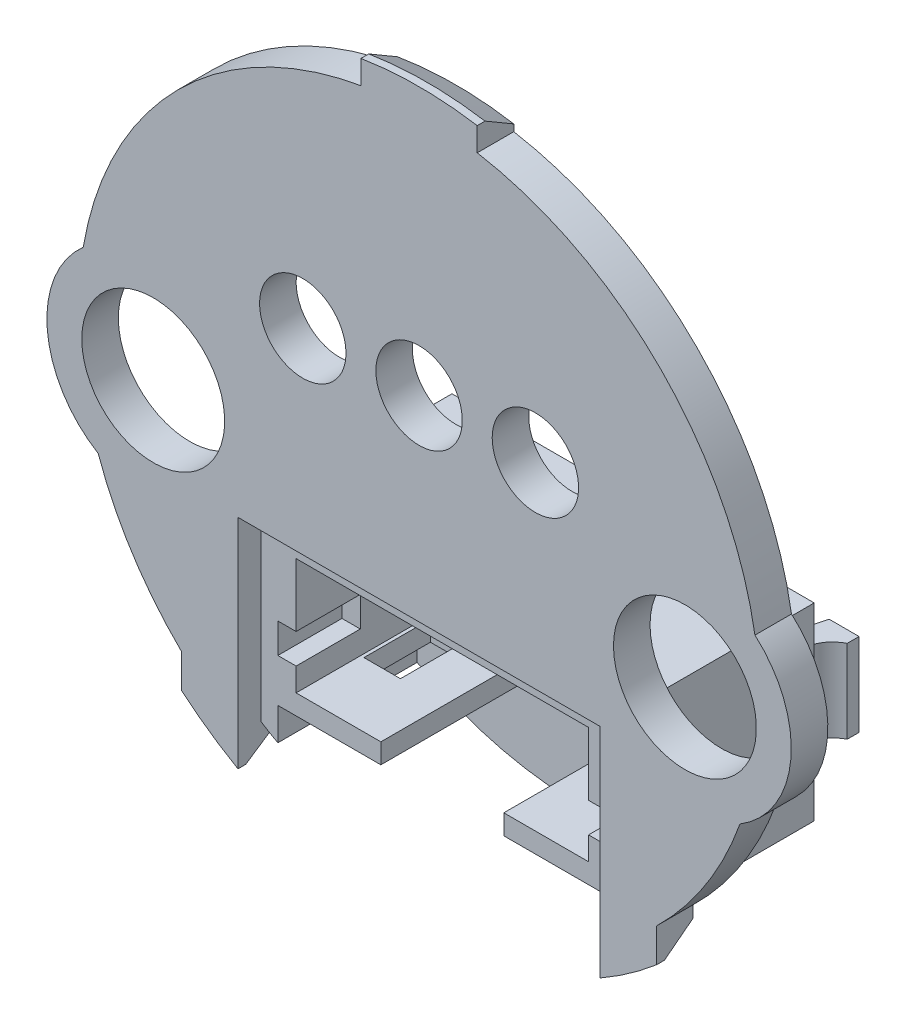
ISO-10303-21;
HEADER;
FILE_DESCRIPTION(('STEP AP214'),'2;1');
FILE_NAME('part.step','',(''),(''),'','','');
FILE_SCHEMA(('AUTOMOTIVE_DESIGN { 1 0 10303 214 1 1 1 1 }'));
ENDSEC;
DATA;
#1=APPLICATION_CONTEXT('core data for automotive mechanical design processes');
#2=APPLICATION_PROTOCOL_DEFINITION('international standard','automotive_design',2000,#1);
#3=PRODUCT_CONTEXT('',#1,'mechanical');
#4=PRODUCT('Part','Part','',(#3));
#5=PRODUCT_RELATED_PRODUCT_CATEGORY('part','',(#4));
#6=PRODUCT_DEFINITION_FORMATION('','',#4);
#7=PRODUCT_DEFINITION_CONTEXT('part definition',#1,'design');
#8=PRODUCT_DEFINITION('design','',#6,#7);
#9=PRODUCT_DEFINITION_SHAPE('','',#8);
#10=(LENGTH_UNIT() NAMED_UNIT(*) SI_UNIT(.MILLI.,.METRE.));
#11=(NAMED_UNIT(*) PLANE_ANGLE_UNIT() SI_UNIT($,.RADIAN.));
#12=(NAMED_UNIT(*) SI_UNIT($,.STERADIAN.) SOLID_ANGLE_UNIT());
#13=UNCERTAINTY_MEASURE_WITH_UNIT(LENGTH_MEASURE(1.E-05),#10,'distance_accuracy_value','');
#14=(GEOMETRIC_REPRESENTATION_CONTEXT(3) GLOBAL_UNCERTAINTY_ASSIGNED_CONTEXT((#13)) GLOBAL_UNIT_ASSIGNED_CONTEXT((#10,
#11,#12)) REPRESENTATION_CONTEXT('',''));
#15=CARTESIAN_POINT('',(0.,0.,0.));
#16=DIRECTION('',(0.,0.,1.));
#17=DIRECTION('',(1.,0.,0.));
#18=AXIS2_PLACEMENT_3D('',#15,#16,#17);
#19=CARTESIAN_POINT('',(-13.7654146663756,-5.92059258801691,-2.55));
#20=DIRECTION('',(0.,-1.,0.));
#21=DIRECTION('',(0.,0.,-1.));
#22=AXIS2_PLACEMENT_3D('',#19,#20,#21);
#23=CYLINDRICAL_SURFACE('',#22,1.);
#24=DIRECTION('',(0.,1.,0.));
#25=VECTOR('',#24,1.);
#26=CARTESIAN_POINT('',(-14.2154146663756,-8.42059258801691,-3.44302855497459));
#27=LINE('',#26,#25);
#28=CARTESIAN_POINT('',(-14.2154146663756,-5.92059258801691,-3.44302855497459));
#29=VERTEX_POINT('',#28);
#30=CARTESIAN_POINT('',(-14.2154146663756,-8.42059258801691,-3.44302855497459));
#31=VERTEX_POINT('',#30);
#32=EDGE_CURVE('E496',#29,#31,#27,.F.);
#33=ORIENTED_EDGE('',*,*,#32,.F.);
#34=CARTESIAN_POINT('',(-13.7654146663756,-5.92059258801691,-2.55));
#35=DIRECTION('',(0.,-1.,0.));
#36=DIRECTION('',(0.,0.,-1.));
#37=AXIS2_PLACEMENT_3D('',#34,#35,#36);
#38=CIRCLE('',#37,1.);
#39=CARTESIAN_POINT('',(-14.6314400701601,-5.92059258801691,-2.05));
#40=VERTEX_POINT('',#39);
#41=EDGE_CURVE('E22',#40,#29,#38,.T.);
#42=ORIENTED_EDGE('',*,*,#41,.F.);
#43=DIRECTION('',(0.,1.,0.));
#44=VECTOR('',#43,1.);
#45=CARTESIAN_POINT('',(-14.6314400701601,-5.92059258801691,-2.05));
#46=LINE('',#45,#44);
#47=CARTESIAN_POINT('',(-14.6314400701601,-8.42059258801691,-2.05));
#48=VERTEX_POINT('',#47);
#49=EDGE_CURVE('E489',#40,#48,#46,.F.);
#50=ORIENTED_EDGE('',*,*,#49,.T.);
#51=CARTESIAN_POINT('',(-13.7654146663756,-8.42059258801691,-2.55));
#52=DIRECTION('',(0.,-1.,0.));
#53=DIRECTION('',(0.,0.,-1.));
#54=AXIS2_PLACEMENT_3D('',#51,#52,#53);
#55=CIRCLE('',#54,1.);
#56=EDGE_CURVE('E498',#31,#48,#55,.F.);
#57=ORIENTED_EDGE('',*,*,#56,.F.);
#58=EDGE_LOOP('',(#33,#42,#50,#57));
#59=FACE_BOUND('',#58,.T.);
#60=ADVANCED_FACE('F17',(#59),#23,.F.);
#61=CARTESIAN_POINT('',(-23.5154146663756,-5.92059258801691,-1.55));
#62=DIRECTION('',(-1.,0.,0.));
#63=DIRECTION('',(0.,0.,1.));
#64=AXIS2_PLACEMENT_3D('',#61,#62,#63);
#65=PLANE('',#64);
#66=DIRECTION('',(0.,1.,0.));
#67=VECTOR('',#66,1.);
#68=CARTESIAN_POINT('',(-23.5154146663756,-7.27608709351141,-3.8));
#69=LINE('',#68,#67);
#70=CARTESIAN_POINT('',(-23.5154146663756,-5.92059258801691,-3.8));
#71=VERTEX_POINT('',#70);
#72=CARTESIAN_POINT('',(-23.5154146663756,-8.4205925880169,-3.8));
#73=VERTEX_POINT('',#72);
#74=EDGE_CURVE('E1141',#71,#73,#69,.F.);
#75=ORIENTED_EDGE('',*,*,#74,.T.);
#76=DIRECTION('',(0.,0.,1.));
#77=VECTOR('',#76,1.);
#78=CARTESIAN_POINT('',(-23.5154146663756,-8.4205925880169,-1.55));
#79=LINE('',#78,#77);
#80=CARTESIAN_POINT('',(-23.5154146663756,-8.4205925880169,-3.44302855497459));
#81=VERTEX_POINT('',#80);
#82=EDGE_CURVE('E536',#73,#81,#79,.T.);
#83=ORIENTED_EDGE('',*,*,#82,.T.);
#84=DIRECTION('',(0.,-1.,0.));
#85=VECTOR('',#84,1.);
#86=CARTESIAN_POINT('',(-23.5154146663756,-5.92059258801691,-3.44302855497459));
#87=LINE('',#86,#85);
#88=CARTESIAN_POINT('',(-23.5154146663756,-5.92059258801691,-3.44302855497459));
#89=VERTEX_POINT('',#88);
#90=EDGE_CURVE('E531',#81,#89,#87,.F.);
#91=ORIENTED_EDGE('',*,*,#90,.T.);
#92=DIRECTION('',(0.,0.,1.));
#93=VECTOR('',#92,1.);
#94=CARTESIAN_POINT('',(-23.5154146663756,-5.92059258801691,-1.55));
#95=LINE('',#94,#93);
#96=EDGE_CURVE('E538',#89,#71,#95,.F.);
#97=ORIENTED_EDGE('',*,*,#96,.T.);
#98=EDGE_LOOP('',(#75,#83,#91,#97));
#99=FACE_BOUND('',#98,.T.);
#100=ADVANCED_FACE('F2132',(#99),#65,.T.);
#101=CARTESIAN_POINT('',(-14.2154146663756,-8.42059258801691,-1.55));
#102=DIRECTION('',(1.,0.,0.));
#103=DIRECTION('',(0.,0.,-1.));
#104=AXIS2_PLACEMENT_3D('',#101,#102,#103);
#105=PLANE('',#104);
#106=DIRECTION('',(0.,1.,0.));
#107=VECTOR('',#106,1.);
#108=CARTESIAN_POINT('',(-14.2154146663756,-7.27608709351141,-3.8));
#109=LINE('',#108,#107);
#110=CARTESIAN_POINT('',(-14.2154146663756,-8.4205925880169,-3.8));
#111=VERTEX_POINT('',#110);
#112=CARTESIAN_POINT('',(-14.2154146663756,-5.92059258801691,-3.8));
#113=VERTEX_POINT('',#112);
#114=EDGE_CURVE('E1143',#111,#113,#109,.T.);
#115=ORIENTED_EDGE('',*,*,#114,.T.);
#116=DIRECTION('',(0.,0.,-1.));
#117=VECTOR('',#116,1.);
#118=CARTESIAN_POINT('',(-14.2154146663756,-5.92059258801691,-1.55));
#119=LINE('',#118,#117);
#120=EDGE_CURVE('E535',#113,#29,#119,.F.);
#121=ORIENTED_EDGE('',*,*,#120,.T.);
#122=ORIENTED_EDGE('',*,*,#32,.T.);
#123=DIRECTION('',(0.,0.,-1.));
#124=VECTOR('',#123,1.);
#125=CARTESIAN_POINT('',(-14.2154146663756,-8.42059258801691,-1.55));
#126=LINE('',#125,#124);
#127=EDGE_CURVE('E541',#31,#111,#126,.T.);
#128=ORIENTED_EDGE('',*,*,#127,.T.);
#129=EDGE_LOOP('',(#115,#121,#122,#128));
#130=FACE_BOUND('',#129,.T.);
#131=ADVANCED_FACE('F2137',(#130),#105,.T.);
#132=CARTESIAN_POINT('',(-23.9654146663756,-5.92059258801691,-2.55));
#133=DIRECTION('',(0.,-1.,0.));
#134=DIRECTION('',(0.,0.,-1.));
#135=AXIS2_PLACEMENT_3D('',#132,#133,#134);
#136=CYLINDRICAL_SURFACE('',#135,1.);
#137=DIRECTION('',(0.,1.,0.));
#138=VECTOR('',#137,1.);
#139=CARTESIAN_POINT('',(-23.0993892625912,-5.92059258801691,-2.05));
#140=LINE('',#139,#138);
#141=CARTESIAN_POINT('',(-23.0993892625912,-8.4205925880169,-2.05));
#142=VERTEX_POINT('',#141);
#143=CARTESIAN_POINT('',(-23.0993892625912,-5.92059258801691,-2.05));
#144=VERTEX_POINT('',#143);
#145=EDGE_CURVE('E1181',#142,#144,#140,.T.);
#146=ORIENTED_EDGE('',*,*,#145,.T.);
#147=CARTESIAN_POINT('',(-23.9654146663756,-5.92059258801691,-2.55));
#148=DIRECTION('',(0.,-1.,0.));
#149=DIRECTION('',(0.,0.,-1.));
#150=AXIS2_PLACEMENT_3D('',#147,#148,#149);
#151=CIRCLE('',#150,1.);
#152=EDGE_CURVE('E534',#89,#144,#151,.T.);
#153=ORIENTED_EDGE('',*,*,#152,.F.);
#154=ORIENTED_EDGE('',*,*,#90,.F.);
#155=CARTESIAN_POINT('',(-23.9654146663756,-8.4205925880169,-2.55));
#156=DIRECTION('',(0.,-1.,0.));
#157=DIRECTION('',(0.,0.,-1.));
#158=AXIS2_PLACEMENT_3D('',#155,#156,#157);
#159=CIRCLE('',#158,1.);
#160=EDGE_CURVE('E1126',#142,#81,#159,.F.);
#161=ORIENTED_EDGE('',*,*,#160,.F.);
#162=EDGE_LOOP('',(#146,#153,#154,#161));
#163=FACE_BOUND('',#162,.T.);
#164=ADVANCED_FACE('F2229',(#163),#136,.F.);
#165=CARTESIAN_POINT('',(-16.8456127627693,-7.39833984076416,-3.5));
#166=DIRECTION('',(0.,1.,0.));
#167=DIRECTION('',(0.,0.,1.));
#168=AXIS2_PLACEMENT_3D('',#165,#166,#167);
#169=CYLINDRICAL_SURFACE('',#168,0.3);
#170=CARTESIAN_POINT('',(-16.8456127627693,-7.44020783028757,-3.5));
#171=DIRECTION('',(0.,0.965925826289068,-0.258819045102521));
#172=DIRECTION('',(0.,0.258819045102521,0.965925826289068));
#173=AXIS2_PLACEMENT_3D('',#170,#171,#172);
#174=ELLIPSE('',#173,0.310582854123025,0.3);
#175=CARTESIAN_POINT('',(-16.5558350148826,-7.46101293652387,-3.57764571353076));
#176=VERTEX_POINT('',#175);
#177=CARTESIAN_POINT('',(-16.8456127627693,-7.52059258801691,-3.8));
#178=VERTEX_POINT('',#177);
#179=EDGE_CURVE('E1122',#176,#178,#174,.T.);
#180=ORIENTED_EDGE('',*,*,#179,.T.);
#181=DIRECTION('',(0.,1.,0.));
#182=VECTOR('',#181,1.);
#183=CARTESIAN_POINT('',(-16.8456127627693,-7.27608709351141,-3.8));
#184=LINE('',#183,#182);
#185=CARTESIAN_POINT('',(-16.8456127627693,-5.92059258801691,-3.8));
#186=VERTEX_POINT('',#185);
#187=EDGE_CURVE('E1174',#178,#186,#184,.T.);
#188=ORIENTED_EDGE('',*,*,#187,.T.);
#189=CARTESIAN_POINT('',(-16.8456127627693,-5.92059258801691,-3.5));
#190=DIRECTION('',(0.,1.,0.));
#191=DIRECTION('',(0.,0.,1.));
#192=AXIS2_PLACEMENT_3D('',#189,#190,#191);
#193=CIRCLE('',#192,0.3);
#194=CARTESIAN_POINT('',(-16.5558350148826,-5.92059258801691,-3.57764571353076));
#195=VERTEX_POINT('',#194);
#196=EDGE_CURVE('E1124',#186,#195,#193,.F.);
#197=ORIENTED_EDGE('',*,*,#196,.T.);
#198=DIRECTION('',(0.,1.,0.));
#199=VECTOR('',#198,1.);
#200=CARTESIAN_POINT('',(-16.5558350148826,-7.52059258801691,-3.57764571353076));
#201=LINE('',#200,#199);
#202=EDGE_CURVE('E2004',#176,#195,#201,.T.);
#203=ORIENTED_EDGE('',*,*,#202,.F.);
#204=EDGE_LOOP('',(#180,#188,#197,#203));
#205=FACE_BOUND('',#204,.T.);
#206=ADVANCED_FACE('F2024',(#205),#169,.T.);
#207=CARTESIAN_POINT('',(-16.8852165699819,-6.59833984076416,-3.5));
#208=DIRECTION('',(0.,-1.,0.));
#209=DIRECTION('',(0.,0.,-1.));
#210=AXIS2_PLACEMENT_3D('',#207,#208,#209);
#211=CYLINDRICAL_SURFACE('',#210,0.3);
#212=CARTESIAN_POINT('',(-16.8852165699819,-7.44020783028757,-3.5));
#213=DIRECTION('',(0.,0.965925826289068,-0.258819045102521));
#214=DIRECTION('',(0.,-0.258819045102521,-0.965925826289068));
#215=AXIS2_PLACEMENT_3D('',#212,#213,#214);
#216=ELLIPSE('',#215,0.310582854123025,0.3);
#217=CARTESIAN_POINT('',(-16.8852165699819,-7.52059258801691,-3.8));
#218=VERTEX_POINT('',#217);
#219=CARTESIAN_POINT('',(-17.1749943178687,-7.46101293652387,-3.57764571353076));
#220=VERTEX_POINT('',#219);
#221=EDGE_CURVE('E1117',#218,#220,#216,.T.);
#222=ORIENTED_EDGE('',*,*,#221,.T.);
#223=DIRECTION('',(0.,1.,0.));
#224=VECTOR('',#223,1.);
#225=CARTESIAN_POINT('',(-17.1749943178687,-5.92059258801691,-3.57764571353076));
#226=LINE('',#225,#224);
#227=CARTESIAN_POINT('',(-17.1749943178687,-5.92059258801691,-3.57764571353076));
#228=VERTEX_POINT('',#227);
#229=EDGE_CURVE('E2001',#228,#220,#226,.F.);
#230=ORIENTED_EDGE('',*,*,#229,.F.);
#231=CARTESIAN_POINT('',(-16.8852165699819,-5.92059258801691,-3.5));
#232=DIRECTION('',(0.,-1.,0.));
#233=DIRECTION('',(0.,0.,-1.));
#234=AXIS2_PLACEMENT_3D('',#231,#232,#233);
#235=CIRCLE('',#234,0.3);
#236=CARTESIAN_POINT('',(-16.8852165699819,-5.92059258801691,-3.8));
#237=VERTEX_POINT('',#236);
#238=EDGE_CURVE('E1119',#228,#237,#235,.T.);
#239=ORIENTED_EDGE('',*,*,#238,.T.);
#240=DIRECTION('',(0.,1.,0.));
#241=VECTOR('',#240,1.);
#242=CARTESIAN_POINT('',(-16.8852165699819,-7.27608709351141,-3.8));
#243=LINE('',#242,#241);
#244=EDGE_CURVE('E1161',#237,#218,#243,.F.);
#245=ORIENTED_EDGE('',*,*,#244,.T.);
#246=EDGE_LOOP('',(#222,#230,#239,#245));
#247=FACE_BOUND('',#246,.T.);
#248=ADVANCED_FACE('F2034',(#247),#211,.T.);
#249=CARTESIAN_POINT('',(-18.8456127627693,-7.39833984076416,-3.5));
#250=DIRECTION('',(0.,1.,0.));
#251=DIRECTION('',(0.,0.,1.));
#252=AXIS2_PLACEMENT_3D('',#249,#250,#251);
#253=CYLINDRICAL_SURFACE('',#252,0.3);
#254=CARTESIAN_POINT('',(-18.8456127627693,-7.44020783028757,-3.5));
#255=DIRECTION('',(0.,0.965925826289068,-0.258819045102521));
#256=DIRECTION('',(0.,0.258819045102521,0.965925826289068));
#257=AXIS2_PLACEMENT_3D('',#254,#255,#256);
#258=ELLIPSE('',#257,0.310582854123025,0.3);
#259=CARTESIAN_POINT('',(-18.5558350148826,-7.46101293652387,-3.57764571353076));
#260=VERTEX_POINT('',#259);
#261=CARTESIAN_POINT('',(-18.8456127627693,-7.52059258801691,-3.8));
#262=VERTEX_POINT('',#261);
#263=EDGE_CURVE('E1113',#260,#262,#258,.T.);
#264=ORIENTED_EDGE('',*,*,#263,.T.);
#265=DIRECTION('',(0.,1.,0.));
#266=VECTOR('',#265,1.);
#267=CARTESIAN_POINT('',(-18.8456127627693,-7.27608709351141,-3.8));
#268=LINE('',#267,#266);
#269=CARTESIAN_POINT('',(-18.8456127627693,-5.9205925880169,-3.8));
#270=VERTEX_POINT('',#269);
#271=EDGE_CURVE('E1164',#262,#270,#268,.T.);
#272=ORIENTED_EDGE('',*,*,#271,.T.);
#273=CARTESIAN_POINT('',(-18.8456127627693,-5.9205925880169,-3.5));
#274=DIRECTION('',(0.,1.,0.));
#275=DIRECTION('',(0.,0.,1.));
#276=AXIS2_PLACEMENT_3D('',#273,#274,#275);
#277=CIRCLE('',#276,0.3);
#278=CARTESIAN_POINT('',(-18.5558350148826,-5.9205925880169,-3.57764571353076));
#279=VERTEX_POINT('',#278);
#280=EDGE_CURVE('E1115',#270,#279,#277,.F.);
#281=ORIENTED_EDGE('',*,*,#280,.T.);
#282=DIRECTION('',(0.,1.,0.));
#283=VECTOR('',#282,1.);
#284=CARTESIAN_POINT('',(-18.5558350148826,-7.52059258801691,-3.57764571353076));
#285=LINE('',#284,#283);
#286=EDGE_CURVE('E1998',#260,#279,#285,.T.);
#287=ORIENTED_EDGE('',*,*,#286,.F.);
#288=EDGE_LOOP('',(#264,#272,#281,#287));
#289=FACE_BOUND('',#288,.T.);
#290=ADVANCED_FACE('F2058',(#289),#253,.T.);
#291=CARTESIAN_POINT('',(-18.8852165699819,-6.59833984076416,-3.5));
#292=DIRECTION('',(0.,-1.,0.));
#293=DIRECTION('',(0.,0.,-1.));
#294=AXIS2_PLACEMENT_3D('',#291,#292,#293);
#295=CYLINDRICAL_SURFACE('',#294,0.3);
#296=CARTESIAN_POINT('',(-18.8852165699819,-7.44020783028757,-3.5));
#297=DIRECTION('',(0.,0.965925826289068,-0.258819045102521));
#298=DIRECTION('',(0.,-0.258819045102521,-0.965925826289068));
#299=AXIS2_PLACEMENT_3D('',#296,#297,#298);
#300=ELLIPSE('',#299,0.310582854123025,0.3);
#301=CARTESIAN_POINT('',(-18.8852165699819,-7.52059258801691,-3.8));
#302=VERTEX_POINT('',#301);
#303=CARTESIAN_POINT('',(-19.1749943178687,-7.46101293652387,-3.57764571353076));
#304=VERTEX_POINT('',#303);
#305=EDGE_CURVE('E1108',#302,#304,#300,.T.);
#306=ORIENTED_EDGE('',*,*,#305,.T.);
#307=DIRECTION('',(0.,1.,0.));
#308=VECTOR('',#307,1.);
#309=CARTESIAN_POINT('',(-19.1749943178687,-5.9205925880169,-3.57764571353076));
#310=LINE('',#309,#308);
#311=CARTESIAN_POINT('',(-19.1749943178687,-5.9205925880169,-3.57764571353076));
#312=VERTEX_POINT('',#311);
#313=EDGE_CURVE('E1995',#312,#304,#310,.F.);
#314=ORIENTED_EDGE('',*,*,#313,.F.);
#315=CARTESIAN_POINT('',(-18.8852165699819,-5.9205925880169,-3.5));
#316=DIRECTION('',(0.,-1.,0.));
#317=DIRECTION('',(0.,0.,-1.));
#318=AXIS2_PLACEMENT_3D('',#315,#316,#317);
#319=CIRCLE('',#318,0.3);
#320=CARTESIAN_POINT('',(-18.8852165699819,-5.9205925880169,-3.8));
#321=VERTEX_POINT('',#320);
#322=EDGE_CURVE('E1110',#312,#321,#319,.T.);
#323=ORIENTED_EDGE('',*,*,#322,.T.);
#324=DIRECTION('',(0.,1.,0.));
#325=VECTOR('',#324,1.);
#326=CARTESIAN_POINT('',(-18.8852165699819,-7.27608709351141,-3.8));
#327=LINE('',#326,#325);
#328=EDGE_CURVE('E1153',#321,#302,#327,.F.);
#329=ORIENTED_EDGE('',*,*,#328,.T.);
#330=EDGE_LOOP('',(#306,#314,#323,#329));
#331=FACE_BOUND('',#330,.T.);
#332=ADVANCED_FACE('F2066',(#331),#295,.T.);
#333=CARTESIAN_POINT('',(-20.8456127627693,-7.39833984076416,-3.5));
#334=DIRECTION('',(0.,1.,0.));
#335=DIRECTION('',(0.,0.,1.));
#336=AXIS2_PLACEMENT_3D('',#333,#334,#335);
#337=CYLINDRICAL_SURFACE('',#336,0.3);
#338=CARTESIAN_POINT('',(-20.8456127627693,-7.44020783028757,-3.5));
#339=DIRECTION('',(0.,0.965925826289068,-0.258819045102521));
#340=DIRECTION('',(0.,0.258819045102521,0.965925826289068));
#341=AXIS2_PLACEMENT_3D('',#338,#339,#340);
#342=ELLIPSE('',#341,0.310582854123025,0.3);
#343=CARTESIAN_POINT('',(-20.5558350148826,-7.46101293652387,-3.57764571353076));
#344=VERTEX_POINT('',#343);
#345=CARTESIAN_POINT('',(-20.8456127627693,-7.52059258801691,-3.8));
#346=VERTEX_POINT('',#345);
#347=EDGE_CURVE('E1104',#344,#346,#342,.T.);
#348=ORIENTED_EDGE('',*,*,#347,.T.);
#349=DIRECTION('',(0.,1.,0.));
#350=VECTOR('',#349,1.);
#351=CARTESIAN_POINT('',(-20.8456127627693,-7.27608709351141,-3.8));
#352=LINE('',#351,#350);
#353=CARTESIAN_POINT('',(-20.8456127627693,-5.9205925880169,-3.8));
#354=VERTEX_POINT('',#353);
#355=EDGE_CURVE('E1148',#346,#354,#352,.T.);
#356=ORIENTED_EDGE('',*,*,#355,.T.);
#357=CARTESIAN_POINT('',(-20.8456127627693,-5.9205925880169,-3.5));
#358=DIRECTION('',(0.,1.,0.));
#359=DIRECTION('',(0.,0.,1.));
#360=AXIS2_PLACEMENT_3D('',#357,#358,#359);
#361=CIRCLE('',#360,0.3);
#362=CARTESIAN_POINT('',(-20.5558350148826,-5.9205925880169,-3.57764571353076));
#363=VERTEX_POINT('',#362);
#364=EDGE_CURVE('E1106',#354,#363,#361,.F.);
#365=ORIENTED_EDGE('',*,*,#364,.T.);
#366=DIRECTION('',(0.,1.,0.));
#367=VECTOR('',#366,1.);
#368=CARTESIAN_POINT('',(-20.5558350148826,-7.52059258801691,-3.57764571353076));
#369=LINE('',#368,#367);
#370=EDGE_CURVE('E1992',#344,#363,#369,.T.);
#371=ORIENTED_EDGE('',*,*,#370,.F.);
#372=EDGE_LOOP('',(#348,#356,#365,#371));
#373=FACE_BOUND('',#372,.T.);
#374=ADVANCED_FACE('F2416',(#373),#337,.T.);
#375=CARTESIAN_POINT('',(-20.8852165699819,-6.59833984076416,-3.5));
#376=DIRECTION('',(0.,-1.,0.));
#377=DIRECTION('',(0.,0.,-1.));
#378=AXIS2_PLACEMENT_3D('',#375,#376,#377);
#379=CYLINDRICAL_SURFACE('',#378,0.3);
#380=CARTESIAN_POINT('',(-20.8852165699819,-7.44020783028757,-3.5));
#381=DIRECTION('',(0.,0.965925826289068,-0.258819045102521));
#382=DIRECTION('',(0.,-0.258819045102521,-0.965925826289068));
#383=AXIS2_PLACEMENT_3D('',#380,#381,#382);
#384=ELLIPSE('',#383,0.310582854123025,0.3);
#385=CARTESIAN_POINT('',(-20.8852165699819,-7.52059258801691,-3.8));
#386=VERTEX_POINT('',#385);
#387=CARTESIAN_POINT('',(-21.1749943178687,-7.46101293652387,-3.57764571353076));
#388=VERTEX_POINT('',#387);
#389=EDGE_CURVE('E490',#386,#388,#384,.T.);
#390=ORIENTED_EDGE('',*,*,#389,.T.);
#391=DIRECTION('',(0.,1.,0.));
#392=VECTOR('',#391,1.);
#393=CARTESIAN_POINT('',(-21.1749943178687,-5.9205925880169,-3.57764571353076));
#394=LINE('',#393,#392);
#395=CARTESIAN_POINT('',(-21.1749943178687,-5.9205925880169,-3.57764571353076));
#396=VERTEX_POINT('',#395);
#397=EDGE_CURVE('E1987',#396,#388,#394,.F.);
#398=ORIENTED_EDGE('',*,*,#397,.F.);
#399=CARTESIAN_POINT('',(-20.8852165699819,-5.9205925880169,-3.5));
#400=DIRECTION('',(0.,-1.,0.));
#401=DIRECTION('',(0.,0.,-1.));
#402=AXIS2_PLACEMENT_3D('',#399,#400,#401);
#403=CIRCLE('',#402,0.3);
#404=CARTESIAN_POINT('',(-20.8852165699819,-5.9205925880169,-3.8));
#405=VERTEX_POINT('',#404);
#406=EDGE_CURVE('E1101',#396,#405,#403,.T.);
#407=ORIENTED_EDGE('',*,*,#406,.T.);
#408=DIRECTION('',(0.,1.,0.));
#409=VECTOR('',#408,1.);
#410=CARTESIAN_POINT('',(-20.8852165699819,-7.27608709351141,-3.8));
#411=LINE('',#410,#409);
#412=EDGE_CURVE('E1147',#405,#386,#411,.F.);
#413=ORIENTED_EDGE('',*,*,#412,.T.);
#414=EDGE_LOOP('',(#390,#398,#407,#413));
#415=FACE_BOUND('',#414,.T.);
#416=ADVANCED_FACE('F2222',(#415),#379,.T.);
#417=CARTESIAN_POINT('',(-14.6314400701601,-5.92059258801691,-2.05));
#418=DIRECTION('',(0.,0.,1.));
#419=DIRECTION('',(1.,0.,0.));
#420=AXIS2_PLACEMENT_3D('',#417,#418,#419);
#421=PLANE('',#420);
#422=ORIENTED_EDGE('',*,*,#49,.F.);
#423=DIRECTION('',(1.,0.,0.));
#424=VECTOR('',#423,1.);
#425=CARTESIAN_POINT('',(-14.6314400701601,-5.92059258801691,-2.05));
#426=LINE('',#425,#424);
#427=CARTESIAN_POINT('',(-14.2154146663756,-5.92059258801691,-2.05));
#428=VERTEX_POINT('',#427);
#429=EDGE_CURVE('E476',#428,#40,#426,.F.);
#430=ORIENTED_EDGE('',*,*,#429,.F.);
#431=DIRECTION('',(0.,1.,0.));
#432=VECTOR('',#431,1.);
#433=CARTESIAN_POINT('',(-14.2154146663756,-8.42059258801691,-2.05));
#434=LINE('',#433,#432);
#435=CARTESIAN_POINT('',(-14.2154146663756,-8.42059258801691,-2.05));
#436=VERTEX_POINT('',#435);
#437=EDGE_CURVE('E511',#436,#428,#434,.T.);
#438=ORIENTED_EDGE('',*,*,#437,.F.);
#439=DIRECTION('',(1.,0.,0.));
#440=VECTOR('',#439,1.);
#441=CARTESIAN_POINT('',(-14.6314400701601,-8.42059258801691,-2.05));
#442=LINE('',#441,#440);
#443=EDGE_CURVE('E501',#48,#436,#442,.T.);
#444=ORIENTED_EDGE('',*,*,#443,.F.);
#445=EDGE_LOOP('',(#422,#430,#438,#444));
#446=FACE_BOUND('',#445,.T.);
#447=ADVANCED_FACE('F499',(#446),#421,.F.);
#448=CARTESIAN_POINT('',(-18.8654146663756,-7.27608709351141,-3.8));
#449=DIRECTION('',(0.,0.,1.));
#450=DIRECTION('',(1.,0.,0.));
#451=AXIS2_PLACEMENT_3D('',#448,#449,#450);
#452=PLANE('',#451);
#453=DIRECTION('',(1.,0.,0.));
#454=VECTOR('',#453,1.);
#455=CARTESIAN_POINT('',(-15.1154146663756,-7.52059258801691,-3.8));
#456=LINE('',#455,#454);
#457=CARTESIAN_POINT('',(-15.1154146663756,-7.52059258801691,-3.8));
#458=VERTEX_POINT('',#457);
#459=EDGE_CURVE('E1972',#458,#178,#456,.F.);
#460=ORIENTED_EDGE('',*,*,#459,.F.);
#461=DIRECTION('',(0.,1.,0.));
#462=VECTOR('',#461,1.);
#463=CARTESIAN_POINT('',(-15.1154146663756,-5.92059258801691,-3.8));
#464=LINE('',#463,#462);
#465=CARTESIAN_POINT('',(-15.1154146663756,-5.92059258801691,-3.8));
#466=VERTEX_POINT('',#465);
#467=EDGE_CURVE('E1180',#466,#458,#464,.F.);
#468=ORIENTED_EDGE('',*,*,#467,.F.);
#469=DIRECTION('',(1.,0.,0.));
#470=VECTOR('',#469,1.);
#471=CARTESIAN_POINT('',(-18.8654146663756,-5.92059258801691,-3.8));
#472=LINE('',#471,#470);
#473=EDGE_CURVE('E1171',#113,#466,#472,.F.);
#474=ORIENTED_EDGE('',*,*,#473,.F.);
#475=ORIENTED_EDGE('',*,*,#114,.F.);
#476=DIRECTION('',(1.,0.,0.));
#477=VECTOR('',#476,1.);
#478=CARTESIAN_POINT('',(-23.5154146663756,-8.4205925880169,-3.8));
#479=LINE('',#478,#477);
#480=EDGE_CURVE('E521',#73,#111,#479,.T.);
#481=ORIENTED_EDGE('',*,*,#480,.F.);
#482=ORIENTED_EDGE('',*,*,#74,.F.);
#483=DIRECTION('',(1.,0.,0.));
#484=VECTOR('',#483,1.);
#485=CARTESIAN_POINT('',(-18.8654146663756,-5.92059258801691,-3.8));
#486=LINE('',#485,#484);
#487=CARTESIAN_POINT('',(-22.6154146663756,-5.92059258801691,-3.8));
#488=VERTEX_POINT('',#487);
#489=EDGE_CURVE('E1144',#488,#71,#486,.F.);
#490=ORIENTED_EDGE('',*,*,#489,.F.);
#491=DIRECTION('',(0.,1.,0.));
#492=VECTOR('',#491,1.);
#493=CARTESIAN_POINT('',(-22.6154146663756,-7.52059258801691,-3.8));
#494=LINE('',#493,#492);
#495=CARTESIAN_POINT('',(-22.6154146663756,-7.52059258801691,-3.8));
#496=VERTEX_POINT('',#495);
#497=EDGE_CURVE('E1983',#496,#488,#494,.T.);
#498=ORIENTED_EDGE('',*,*,#497,.F.);
#499=DIRECTION('',(1.,0.,0.));
#500=VECTOR('',#499,1.);
#501=CARTESIAN_POINT('',(-21.1154146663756,-7.52059258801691,-3.8));
#502=LINE('',#501,#500);
#503=EDGE_CURVE('E1980',#386,#496,#502,.F.);
#504=ORIENTED_EDGE('',*,*,#503,.F.);
#505=ORIENTED_EDGE('',*,*,#412,.F.);
#506=DIRECTION('',(1.,0.,0.));
#507=VECTOR('',#506,1.);
#508=CARTESIAN_POINT('',(-18.8654146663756,-5.9205925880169,-3.8));
#509=LINE('',#508,#507);
#510=EDGE_CURVE('E1146',#354,#405,#509,.F.);
#511=ORIENTED_EDGE('',*,*,#510,.F.);
#512=ORIENTED_EDGE('',*,*,#355,.F.);
#513=DIRECTION('',(1.,0.,0.));
#514=VECTOR('',#513,1.);
#515=CARTESIAN_POINT('',(-19.1154146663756,-7.52059258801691,-3.8));
#516=LINE('',#515,#514);
#517=EDGE_CURVE('E2170',#302,#346,#516,.F.);
#518=ORIENTED_EDGE('',*,*,#517,.F.);
#519=ORIENTED_EDGE('',*,*,#328,.F.);
#520=DIRECTION('',(1.,0.,0.));
#521=VECTOR('',#520,1.);
#522=CARTESIAN_POINT('',(-18.8654146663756,-5.9205925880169,-3.8));
#523=LINE('',#522,#521);
#524=EDGE_CURVE('E506',#270,#321,#523,.F.);
#525=ORIENTED_EDGE('',*,*,#524,.F.);
#526=ORIENTED_EDGE('',*,*,#271,.F.);
#527=DIRECTION('',(1.,0.,0.));
#528=VECTOR('',#527,1.);
#529=CARTESIAN_POINT('',(-17.1154146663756,-7.52059258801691,-3.8));
#530=LINE('',#529,#528);
#531=EDGE_CURVE('E2179',#218,#262,#530,.F.);
#532=ORIENTED_EDGE('',*,*,#531,.F.);
#533=ORIENTED_EDGE('',*,*,#244,.F.);
#534=DIRECTION('',(1.,0.,0.));
#535=VECTOR('',#534,1.);
#536=CARTESIAN_POINT('',(-18.8654146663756,-5.92059258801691,-3.8));
#537=LINE('',#536,#535);
#538=EDGE_CURVE('E503',#186,#237,#537,.F.);
#539=ORIENTED_EDGE('',*,*,#538,.F.);
#540=ORIENTED_EDGE('',*,*,#187,.F.);
#541=EDGE_LOOP('',(#460,#468,#474,#475,#481,#482,#490,#498,#504,#505,#511,#512,#518,#519,#525,
#526,#532,#533,#539,#540));
#542=FACE_BOUND('',#541,.T.);
#543=ADVANCED_FACE('F2030',(#542),#452,.F.);
#544=CARTESIAN_POINT('',(-24.8314400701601,-5.92059258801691,-2.05));
#545=DIRECTION('',(0.,0.,1.));
#546=DIRECTION('',(1.,0.,0.));
#547=AXIS2_PLACEMENT_3D('',#544,#545,#546);
#548=PLANE('',#547);
#549=DIRECTION('',(0.,1.,0.));
#550=VECTOR('',#549,1.);
#551=CARTESIAN_POINT('',(-23.5154146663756,-5.92059258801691,-2.05));
#552=LINE('',#551,#550);
#553=CARTESIAN_POINT('',(-23.5154146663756,-5.92059258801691,-2.05));
#554=VERTEX_POINT('',#553);
#555=CARTESIAN_POINT('',(-23.5154146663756,-8.4205925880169,-2.05));
#556=VERTEX_POINT('',#555);
#557=EDGE_CURVE('E520',#554,#556,#552,.F.);
#558=ORIENTED_EDGE('',*,*,#557,.F.);
#559=DIRECTION('',(1.,0.,0.));
#560=VECTOR('',#559,1.);
#561=CARTESIAN_POINT('',(-24.8314400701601,-5.92059258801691,-2.05));
#562=LINE('',#561,#560);
#563=EDGE_CURVE('E1177',#144,#554,#562,.F.);
#564=ORIENTED_EDGE('',*,*,#563,.F.);
#565=ORIENTED_EDGE('',*,*,#145,.F.);
#566=DIRECTION('',(1.,0.,0.));
#567=VECTOR('',#566,1.);
#568=CARTESIAN_POINT('',(-23.5154146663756,-8.4205925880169,-2.05));
#569=LINE('',#568,#567);
#570=EDGE_CURVE('E513',#556,#142,#569,.T.);
#571=ORIENTED_EDGE('',*,*,#570,.F.);
#572=EDGE_LOOP('',(#558,#564,#565,#571));
#573=FACE_BOUND('',#572,.T.);
#574=ADVANCED_FACE('F2234',(#573),#548,.F.);
#575=CARTESIAN_POINT('',(-15.6977575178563,-5.92059258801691,-1.6266668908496));
#576=DIRECTION('',(-0.965925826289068,0.,-0.258819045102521));
#577=DIRECTION('',(-0.258819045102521,0.,0.965925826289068));
#578=AXIS2_PLACEMENT_3D('',#575,#576,#577);
#579=PLANE('',#578);
#580=ORIENTED_EDGE('',*,*,#467,.T.);
#581=DIRECTION('',(0.25056280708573,-0.250562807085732,-0.93511312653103));
#582=VECTOR('',#581,1.);
#583=CARTESIAN_POINT('',(-15.5813404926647,-7.05466676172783,-2.06114114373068));
#584=LINE('',#583,#582);
#585=CARTESIAN_POINT('',(-15.5813404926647,-7.05466676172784,-2.06114114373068));
#586=VERTEX_POINT('',#585);
#587=EDGE_CURVE('E1969',#586,#458,#584,.T.);
#588=ORIENTED_EDGE('',*,*,#587,.F.);
#589=DIRECTION('',(0.,1.,0.));
#590=VECTOR('',#589,1.);
#591=CARTESIAN_POINT('',(-15.5813404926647,-6.47059258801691,-2.06114114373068));
#592=LINE('',#591,#590);
#593=CARTESIAN_POINT('',(-15.5813404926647,-5.92059258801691,-2.06114114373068));
#594=VERTEX_POINT('',#593);
#595=EDGE_CURVE('E1973',#594,#586,#592,.F.);
#596=ORIENTED_EDGE('',*,*,#595,.F.);
#597=DIRECTION('',(-0.258819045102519,0.,0.965925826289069));
#598=VECTOR('',#597,1.);
#599=CARTESIAN_POINT('',(-15.1154146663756,-5.92059258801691,-3.8));
#600=LINE('',#599,#598);
#601=EDGE_CURVE('E527',#466,#594,#600,.T.);
#602=ORIENTED_EDGE('',*,*,#601,.F.);
#603=EDGE_LOOP('',(#580,#588,#596,#602));
#604=FACE_BOUND('',#603,.T.);
#605=ADVANCED_FACE('F2140',(#604),#579,.T.);
#606=CARTESIAN_POINT('',(-16.033071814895,-7.52059258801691,-1.6266668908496));
#607=DIRECTION('',(0.965925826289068,0.,-0.258819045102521));
#608=DIRECTION('',(-0.258819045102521,0.,-0.965925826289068));
#609=AXIS2_PLACEMENT_3D('',#606,#607,#608);
#610=PLANE('',#609);
#611=DIRECTION('',(0.,-1.,0.));
#612=VECTOR('',#611,1.);
#613=CARTESIAN_POINT('',(-16.1494888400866,-7.02059258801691,-2.06114114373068));
#614=LINE('',#613,#612);
#615=CARTESIAN_POINT('',(-16.1494888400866,-7.05466676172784,-2.06114114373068));
#616=VERTEX_POINT('',#615);
#617=CARTESIAN_POINT('',(-16.1494888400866,-5.92059258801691,-2.06114114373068));
#618=VERTEX_POINT('',#617);
#619=EDGE_CURVE('E514',#616,#618,#614,.F.);
#620=ORIENTED_EDGE('',*,*,#619,.F.);
#621=DIRECTION('',(0.250562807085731,0.250562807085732,0.935113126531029));
#622=VECTOR('',#621,1.);
#623=CARTESIAN_POINT('',(-16.5558350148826,-7.46101293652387,-3.57764571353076));
#624=LINE('',#623,#622);
#625=EDGE_CURVE('E2159',#176,#616,#624,.T.);
#626=ORIENTED_EDGE('',*,*,#625,.F.);
#627=ORIENTED_EDGE('',*,*,#202,.T.);
#628=DIRECTION('',(-0.25881904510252,0.,-0.965925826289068));
#629=VECTOR('',#628,1.);
#630=CARTESIAN_POINT('',(-16.1494888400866,-5.92059258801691,-2.06114114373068));
#631=LINE('',#630,#629);
#632=EDGE_CURVE('E1097',#618,#195,#631,.T.);
#633=ORIENTED_EDGE('',*,*,#632,.F.);
#634=EDGE_LOOP('',(#620,#626,#627,#633));
#635=FACE_BOUND('',#634,.T.);
#636=ADVANCED_FACE('F2160',(#635),#610,.T.);
#637=CARTESIAN_POINT('',(-17.6977575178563,-5.92059258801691,-1.6266668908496));
#638=DIRECTION('',(-0.965925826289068,0.,-0.258819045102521));
#639=DIRECTION('',(-0.258819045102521,0.,0.965925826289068));
#640=AXIS2_PLACEMENT_3D('',#637,#638,#639);
#641=PLANE('',#640);
#642=DIRECTION('',(0.,1.,0.));
#643=VECTOR('',#642,1.);
#644=CARTESIAN_POINT('',(-17.5813404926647,-6.4705925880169,-2.06114114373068));
#645=LINE('',#644,#643);
#646=CARTESIAN_POINT('',(-17.5813404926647,-5.92059258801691,-2.06114114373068));
#647=VERTEX_POINT('',#646);
#648=CARTESIAN_POINT('',(-17.5813404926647,-7.05466676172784,-2.06114114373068));
#649=VERTEX_POINT('',#648);
#650=EDGE_CURVE('E2040',#647,#649,#645,.F.);
#651=ORIENTED_EDGE('',*,*,#650,.F.);
#652=DIRECTION('',(-0.258819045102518,0.,0.965925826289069));
#653=VECTOR('',#652,1.);
#654=CARTESIAN_POINT('',(-17.1749943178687,-5.92059258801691,-3.57764571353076));
#655=LINE('',#654,#653);
#656=EDGE_CURVE('E1093',#228,#647,#655,.T.);
#657=ORIENTED_EDGE('',*,*,#656,.F.);
#658=ORIENTED_EDGE('',*,*,#229,.T.);
#659=DIRECTION('',(0.250562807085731,-0.250562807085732,-0.935113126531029));
#660=VECTOR('',#659,1.);
#661=CARTESIAN_POINT('',(-17.5813404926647,-7.05466676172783,-2.06114114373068));
#662=LINE('',#661,#660);
#663=EDGE_CURVE('E2177',#649,#220,#662,.T.);
#664=ORIENTED_EDGE('',*,*,#663,.F.);
#665=EDGE_LOOP('',(#651,#657,#658,#664));
#666=FACE_BOUND('',#665,.T.);
#667=ADVANCED_FACE('F2038',(#666),#641,.T.);
#668=CARTESIAN_POINT('',(-18.033071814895,-7.52059258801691,-1.6266668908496));
#669=DIRECTION('',(0.965925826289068,0.,-0.258819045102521));
#670=DIRECTION('',(-0.258819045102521,0.,-0.965925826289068));
#671=AXIS2_PLACEMENT_3D('',#668,#669,#670);
#672=PLANE('',#671);
#673=DIRECTION('',(0.,-1.,0.));
#674=VECTOR('',#673,1.);
#675=CARTESIAN_POINT('',(-18.1494888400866,-7.02059258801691,-2.06114114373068));
#676=LINE('',#675,#674);
#677=CARTESIAN_POINT('',(-18.1494888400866,-7.05466676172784,-2.06114114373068));
#678=VERTEX_POINT('',#677);
#679=CARTESIAN_POINT('',(-18.1494888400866,-5.9205925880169,-2.06114114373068));
#680=VERTEX_POINT('',#679);
#681=EDGE_CURVE('E2049',#678,#680,#676,.F.);
#682=ORIENTED_EDGE('',*,*,#681,.F.);
#683=DIRECTION('',(0.250562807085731,0.250562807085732,0.935113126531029));
#684=VECTOR('',#683,1.);
#685=CARTESIAN_POINT('',(-18.5558350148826,-7.46101293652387,-3.57764571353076));
#686=LINE('',#685,#684);
#687=EDGE_CURVE('E2056',#260,#678,#686,.T.);
#688=ORIENTED_EDGE('',*,*,#687,.F.);
#689=ORIENTED_EDGE('',*,*,#286,.T.);
#690=DIRECTION('',(-0.25881904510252,0.,-0.965925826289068));
#691=VECTOR('',#690,1.);
#692=CARTESIAN_POINT('',(-18.1494888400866,-5.92059258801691,-2.06114114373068));
#693=LINE('',#692,#691);
#694=EDGE_CURVE('E1090',#680,#279,#693,.T.);
#695=ORIENTED_EDGE('',*,*,#694,.F.);
#696=EDGE_LOOP('',(#682,#688,#689,#695));
#697=FACE_BOUND('',#696,.T.);
#698=ADVANCED_FACE('F2052',(#697),#672,.T.);
#699=CARTESIAN_POINT('',(-19.6977575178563,-5.9205925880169,-1.6266668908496));
#700=DIRECTION('',(-0.965925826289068,0.,-0.258819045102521));
#701=DIRECTION('',(-0.258819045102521,0.,0.965925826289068));
#702=AXIS2_PLACEMENT_3D('',#699,#700,#701);
#703=PLANE('',#702);
#704=DIRECTION('',(0.,1.,0.));
#705=VECTOR('',#704,1.);
#706=CARTESIAN_POINT('',(-19.5813404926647,-6.4705925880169,-2.06114114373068));
#707=LINE('',#706,#705);
#708=CARTESIAN_POINT('',(-19.5813404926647,-5.92059258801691,-2.06114114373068));
#709=VERTEX_POINT('',#708);
#710=CARTESIAN_POINT('',(-19.5813404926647,-7.05466676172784,-2.06114114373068));
#711=VERTEX_POINT('',#710);
#712=EDGE_CURVE('E2072',#709,#711,#707,.F.);
#713=ORIENTED_EDGE('',*,*,#712,.F.);
#714=DIRECTION('',(-0.25881904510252,0.,0.965925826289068));
#715=VECTOR('',#714,1.);
#716=CARTESIAN_POINT('',(-19.1749943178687,-5.92059258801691,-3.57764571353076));
#717=LINE('',#716,#715);
#718=EDGE_CURVE('E1086',#312,#709,#717,.T.);
#719=ORIENTED_EDGE('',*,*,#718,.F.);
#720=ORIENTED_EDGE('',*,*,#313,.T.);
#721=DIRECTION('',(0.250562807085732,-0.250562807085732,-0.935113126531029));
#722=VECTOR('',#721,1.);
#723=CARTESIAN_POINT('',(-19.5813404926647,-7.05466676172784,-2.06114114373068));
#724=LINE('',#723,#722);
#725=EDGE_CURVE('E2168',#711,#304,#724,.T.);
#726=ORIENTED_EDGE('',*,*,#725,.F.);
#727=EDGE_LOOP('',(#713,#719,#720,#726));
#728=FACE_BOUND('',#727,.T.);
#729=ADVANCED_FACE('F2070',(#728),#703,.T.);
#730=CARTESIAN_POINT('',(-20.033071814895,-7.52059258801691,-1.6266668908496));
#731=DIRECTION('',(0.965925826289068,0.,-0.258819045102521));
#732=DIRECTION('',(-0.258819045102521,0.,-0.965925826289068));
#733=AXIS2_PLACEMENT_3D('',#730,#731,#732);
#734=PLANE('',#733);
#735=DIRECTION('',(0.,-1.,0.));
#736=VECTOR('',#735,1.);
#737=CARTESIAN_POINT('',(-20.1494888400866,-7.02059258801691,-2.06114114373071));
#738=LINE('',#737,#736);
#739=CARTESIAN_POINT('',(-20.1494888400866,-7.05466676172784,-2.0611411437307));
#740=VERTEX_POINT('',#739);
#741=CARTESIAN_POINT('',(-20.1494888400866,-5.9205925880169,-2.06114114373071));
#742=VERTEX_POINT('',#741);
#743=EDGE_CURVE('E2145',#740,#742,#738,.F.);
#744=ORIENTED_EDGE('',*,*,#743,.F.);
#745=DIRECTION('',(0.25056280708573,0.250562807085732,0.93511312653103));
#746=VECTOR('',#745,1.);
#747=CARTESIAN_POINT('',(-20.5558350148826,-7.46101293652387,-3.57764571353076));
#748=LINE('',#747,#746);
#749=EDGE_CURVE('E2167',#344,#740,#748,.T.);
#750=ORIENTED_EDGE('',*,*,#749,.F.);
#751=ORIENTED_EDGE('',*,*,#370,.T.);
#752=DIRECTION('',(-0.258819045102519,0.,-0.965925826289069));
#753=VECTOR('',#752,1.);
#754=CARTESIAN_POINT('',(-20.1494888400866,-5.92059258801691,-2.06114114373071));
#755=LINE('',#754,#753);
#756=EDGE_CURVE('E1083',#742,#363,#755,.T.);
#757=ORIENTED_EDGE('',*,*,#756,.F.);
#758=EDGE_LOOP('',(#744,#750,#751,#757));
#759=FACE_BOUND('',#758,.T.);
#760=ADVANCED_FACE('F2414',(#759),#734,.T.);
#761=CARTESIAN_POINT('',(-21.6977575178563,-5.9205925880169,-1.6266668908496));
#762=DIRECTION('',(-0.965925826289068,0.,-0.258819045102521));
#763=DIRECTION('',(-0.258819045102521,0.,0.965925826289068));
#764=AXIS2_PLACEMENT_3D('',#761,#762,#763);
#765=PLANE('',#764);
#766=DIRECTION('',(0.,1.,0.));
#767=VECTOR('',#766,1.);
#768=CARTESIAN_POINT('',(-21.5813404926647,-6.47059258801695,-2.06114114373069));
#769=LINE('',#768,#767);
#770=CARTESIAN_POINT('',(-21.5813404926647,-5.92059258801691,-2.06114114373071));
#771=VERTEX_POINT('',#770);
#772=CARTESIAN_POINT('',(-21.5813404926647,-7.05466676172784,-2.06114114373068));
#773=VERTEX_POINT('',#772);
#774=EDGE_CURVE('E1986',#771,#773,#769,.F.);
#775=ORIENTED_EDGE('',*,*,#774,.F.);
#776=DIRECTION('',(-0.258819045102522,0.,0.965925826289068));
#777=VECTOR('',#776,1.);
#778=CARTESIAN_POINT('',(-21.1749943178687,-5.92059258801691,-3.57764571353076));
#779=LINE('',#778,#777);
#780=EDGE_CURVE('E1079',#396,#771,#779,.T.);
#781=ORIENTED_EDGE('',*,*,#780,.F.);
#782=ORIENTED_EDGE('',*,*,#397,.T.);
#783=DIRECTION('',(0.25056280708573,-0.250562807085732,-0.93511312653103));
#784=VECTOR('',#783,1.);
#785=CARTESIAN_POINT('',(-21.5813404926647,-7.05466676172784,-2.06114114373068));
#786=LINE('',#785,#784);
#787=EDGE_CURVE('E2184',#773,#388,#786,.T.);
#788=ORIENTED_EDGE('',*,*,#787,.F.);
#789=EDGE_LOOP('',(#775,#781,#782,#788));
#790=FACE_BOUND('',#789,.T.);
#791=ADVANCED_FACE('F2220',(#790),#765,.T.);
#792=CARTESIAN_POINT('',(-22.033071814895,-7.52059258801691,-1.6266668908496));
#793=DIRECTION('',(0.965925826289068,0.,-0.258819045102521));
#794=DIRECTION('',(-0.258819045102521,0.,-0.965925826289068));
#795=AXIS2_PLACEMENT_3D('',#792,#793,#794);
#796=PLANE('',#795);
#797=ORIENTED_EDGE('',*,*,#497,.T.);
#798=DIRECTION('',(-0.25881904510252,0.,-0.965925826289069));
#799=VECTOR('',#798,1.);
#800=CARTESIAN_POINT('',(-22.1494888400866,-5.92059258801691,-2.06114114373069));
#801=LINE('',#800,#799);
#802=CARTESIAN_POINT('',(-22.1494888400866,-5.92059258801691,-2.06114114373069));
#803=VERTEX_POINT('',#802);
#804=EDGE_CURVE('E1068',#803,#488,#801,.T.);
#805=ORIENTED_EDGE('',*,*,#804,.F.);
#806=DIRECTION('',(0.,-1.,0.));
#807=VECTOR('',#806,1.);
#808=CARTESIAN_POINT('',(-22.1494888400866,-7.0205925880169,-2.06114114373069));
#809=LINE('',#808,#807);
#810=CARTESIAN_POINT('',(-22.1494888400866,-7.05466676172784,-2.06114114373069));
#811=VERTEX_POINT('',#810);
#812=EDGE_CURVE('E1979',#811,#803,#809,.F.);
#813=ORIENTED_EDGE('',*,*,#812,.F.);
#814=DIRECTION('',(0.250562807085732,0.250562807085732,0.935113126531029));
#815=VECTOR('',#814,1.);
#816=CARTESIAN_POINT('',(-22.6154146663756,-7.52059258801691,-3.8));
#817=LINE('',#816,#815);
#818=EDGE_CURVE('E1976',#496,#811,#817,.T.);
#819=ORIENTED_EDGE('',*,*,#818,.F.);
#820=EDGE_LOOP('',(#797,#805,#813,#819));
#821=FACE_BOUND('',#820,.T.);
#822=ADVANCED_FACE('F2226',(#821),#796,.T.);
#823=CARTESIAN_POINT('',(-20.6154146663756,-6.47059258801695,-1.80232209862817));
#824=DIRECTION('',(0.,1.,0.));
#825=DIRECTION('',(0.,0.,1.));
#826=AXIS2_PLACEMENT_3D('',#823,#824,#825);
#827=CYLINDRICAL_SURFACE('',#826,1.);
#828=DIRECTION('',(0.,1.,0.));
#829=VECTOR('',#828,1.);
#830=CARTESIAN_POINT('',(-21.6154146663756,-7.0205925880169,-1.80232209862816));
#831=LINE('',#830,#829);
#832=CARTESIAN_POINT('',(-21.6154146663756,-7.0205925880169,-1.80232209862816));
#833=VERTEX_POINT('',#832);
#834=CARTESIAN_POINT('',(-21.6154146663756,-6.16003711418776,-1.80232209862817));
#835=VERTEX_POINT('',#834);
#836=EDGE_CURVE('E1235',#833,#835,#831,.T.);
#837=ORIENTED_EDGE('',*,*,#836,.T.);
#838=CARTESIAN_POINT('',(-21.604450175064,-5.92059258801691,-1.95));
#839=CARTESIAN_POINT('',(-21.6058552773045,-5.94218676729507,-1.9405766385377));
#840=CARTESIAN_POINT('',(-21.6072409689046,-5.96344895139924,-1.93038739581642));
#841=CARTESIAN_POINT('',(-21.6098135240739,-6.00510199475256,-1.90858479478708));
#842=CARTESIAN_POINT('',(-21.6110013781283,-6.02549678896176,-1.89697906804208));
#843=CARTESIAN_POINT('',(-21.6130359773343,-6.06543393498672,-1.87235203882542));
#844=CARTESIAN_POINT('',(-21.6138827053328,-6.0849762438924,-1.85933066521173));
#845=CARTESIAN_POINT('',(-21.615072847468,-6.12320577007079,-1.8318676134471));
#846=CARTESIAN_POINT('',(-21.6154136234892,-6.14188801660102,-1.81741890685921));
#847=CARTESIAN_POINT('',(-21.6154146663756,-6.16003711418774,-1.80232209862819));
#848=B_SPLINE_CURVE_WITH_KNOTS('',3,(#838,#839,#840,#841,#842,#843,#844,#845,#846,#847),
.UNSPECIFIED.,.F.,.F.,(4,2,2,2,4),(0.,0.0707944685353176,0.141223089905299,0.211655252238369,
0.28245338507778),.UNSPECIFIED.);
#849=CARTESIAN_POINT('',(-21.604450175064,-5.92059258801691,-1.95));
#850=VERTEX_POINT('',#849);
#851=EDGE_CURVE('E1069',#850,#835,#848,.T.);
#852=ORIENTED_EDGE('',*,*,#851,.F.);
#853=CARTESIAN_POINT('',(-20.6154146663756,-5.92059258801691,-1.80232209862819));
#854=DIRECTION('',(0.,1.,0.));
#855=DIRECTION('',(0.,0.,1.));
#856=AXIS2_PLACEMENT_3D('',#853,#854,#855);
#857=CIRCLE('',#856,1.);
#858=EDGE_CURVE('E1077',#771,#850,#857,.T.);
#859=ORIENTED_EDGE('',*,*,#858,.F.);
#860=ORIENTED_EDGE('',*,*,#774,.T.);
#861=CARTESIAN_POINT('',(-20.6154146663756,-8.02059258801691,-1.80232209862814));
#862=DIRECTION('',(0.707106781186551,0.707106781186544,0.));
#863=DIRECTION('',(-0.707106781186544,0.707106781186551,0.));
#864=AXIS2_PLACEMENT_3D('',#861,#862,#863);
#865=ELLIPSE('',#864,1.41421356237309,1.);
#866=EDGE_CURVE('E1242',#833,#773,#865,.F.);
#867=ORIENTED_EDGE('',*,*,#866,.F.);
#868=EDGE_LOOP('',(#837,#852,#859,#860,#867));
#869=FACE_BOUND('',#868,.T.);
#870=ADVANCED_FACE('F2195',(#869),#827,.T.);
#871=CARTESIAN_POINT('',(-21.1154146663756,-6.93824973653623,-1.6266668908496));
#872=DIRECTION('',(0.,0.965925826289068,-0.258819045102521));
#873=DIRECTION('',(0.,0.258819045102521,0.965925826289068));
#874=AXIS2_PLACEMENT_3D('',#871,#872,#873);
#875=PLANE('',#874);
#876=ORIENTED_EDGE('',*,*,#503,.T.);
#877=ORIENTED_EDGE('',*,*,#818,.T.);
#878=DIRECTION('',(1.,0.,0.));
#879=VECTOR('',#878,1.);
#880=CARTESIAN_POINT('',(-21.6154146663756,-7.05466676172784,-2.06114114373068));
#881=LINE('',#880,#879);
#882=EDGE_CURVE('E1244',#773,#811,#881,.F.);
#883=ORIENTED_EDGE('',*,*,#882,.F.);
#884=ORIENTED_EDGE('',*,*,#787,.T.);
#885=ORIENTED_EDGE('',*,*,#389,.F.);
#886=EDGE_LOOP('',(#876,#877,#883,#884,#885));
#887=FACE_BOUND('',#886,.T.);
#888=ADVANCED_FACE('F1056',(#887),#875,.T.);
#889=CARTESIAN_POINT('',(-23.1154146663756,-7.0205925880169,-1.80232209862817));
#890=DIRECTION('',(0.,-1.,0.));
#891=DIRECTION('',(0.,0.,-1.));
#892=AXIS2_PLACEMENT_3D('',#889,#890,#891);
#893=CYLINDRICAL_SURFACE('',#892,1.);
#894=CARTESIAN_POINT('',(-23.1154146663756,-8.02059258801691,-1.80232209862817));
#895=DIRECTION('',(0.707106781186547,-0.707106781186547,0.));
#896=DIRECTION('',(-0.707106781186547,-0.707106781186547,0.));
#897=AXIS2_PLACEMENT_3D('',#894,#895,#896);
#898=ELLIPSE('',#897,1.41421356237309,1.);
#899=CARTESIAN_POINT('',(-22.1154146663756,-7.0205925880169,-1.80232209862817));
#900=VERTEX_POINT('',#899);
#901=EDGE_CURVE('E1037',#811,#900,#898,.T.);
#902=ORIENTED_EDGE('',*,*,#901,.F.);
#903=ORIENTED_EDGE('',*,*,#812,.T.);
#904=CARTESIAN_POINT('',(-23.1154146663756,-5.92059258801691,-1.80232209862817));
#905=DIRECTION('',(0.,-1.,0.));
#906=DIRECTION('',(0.,0.,-1.));
#907=AXIS2_PLACEMENT_3D('',#904,#905,#906);
#908=CIRCLE('',#907,1.);
#909=CARTESIAN_POINT('',(-22.1263791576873,-5.92059258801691,-1.95));
#910=VERTEX_POINT('',#909);
#911=EDGE_CURVE('E1074',#910,#803,#908,.F.);
#912=ORIENTED_EDGE('',*,*,#911,.F.);
#913=CARTESIAN_POINT('',(-22.1154146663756,-6.16003711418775,-1.80232209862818));
#914=CARTESIAN_POINT('',(-22.115415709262,-6.14188801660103,-1.8174189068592));
#915=CARTESIAN_POINT('',(-22.1157564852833,-6.1232057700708,-1.8318676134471));
#916=CARTESIAN_POINT('',(-22.1169466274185,-6.0849762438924,-1.85933066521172));
#917=CARTESIAN_POINT('',(-22.117793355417,-6.06543393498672,-1.87235203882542));
#918=CARTESIAN_POINT('',(-22.1198279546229,-6.02549678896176,-1.89697906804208));
#919=CARTESIAN_POINT('',(-22.1210158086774,-6.00510199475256,-1.90858479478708));
#920=CARTESIAN_POINT('',(-22.1235883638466,-5.96344895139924,-1.93038739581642));
#921=CARTESIAN_POINT('',(-22.1249740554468,-5.94218676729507,-1.9405766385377));
#922=CARTESIAN_POINT('',(-22.1263791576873,-5.92059258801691,-1.95));
#923=B_SPLINE_CURVE_WITH_KNOTS('',3,(#913,#914,#915,#916,#917,#918,#919,#920,#921,#922),
.UNSPECIFIED.,.F.,.F.,(4,2,2,2,4),(0.,0.0707981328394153,0.14123029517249,0.211658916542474,
0.282453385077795),.UNSPECIFIED.);
#924=CARTESIAN_POINT('',(-22.1154146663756,-6.16003711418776,-1.80232209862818));
#925=VERTEX_POINT('',#924);
#926=EDGE_CURVE('E1060',#925,#910,#923,.T.);
#927=ORIENTED_EDGE('',*,*,#926,.F.);
#928=DIRECTION('',(0.,1.,0.));
#929=VECTOR('',#928,1.);
#930=CARTESIAN_POINT('',(-22.1154146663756,-6.5205925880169,-1.80232209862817));
#931=LINE('',#930,#929);
#932=EDGE_CURVE('E1240',#925,#900,#931,.F.);
#933=ORIENTED_EDGE('',*,*,#932,.T.);
#934=EDGE_LOOP('',(#902,#903,#912,#927,#933));
#935=FACE_BOUND('',#934,.T.);
#936=ADVANCED_FACE('F1051',(#935),#893,.T.);
#937=CARTESIAN_POINT('',(-16.6154146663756,-6.4705925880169,-1.80232209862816));
#938=DIRECTION('',(0.,1.,0.));
#939=DIRECTION('',(0.,0.,1.));
#940=AXIS2_PLACEMENT_3D('',#937,#938,#939);
#941=CYLINDRICAL_SURFACE('',#940,1.);
#942=DIRECTION('',(0.,1.,0.));
#943=VECTOR('',#942,1.);
#944=CARTESIAN_POINT('',(-17.6154146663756,-7.0205925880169,-1.80232209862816));
#945=LINE('',#944,#943);
#946=CARTESIAN_POINT('',(-17.6154146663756,-7.0205925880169,-1.80232209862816));
#947=VERTEX_POINT('',#946);
#948=CARTESIAN_POINT('',(-17.6154146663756,-6.16003711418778,-1.80232209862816));
#949=VERTEX_POINT('',#948);
#950=EDGE_CURVE('E1249',#947,#949,#945,.T.);
#951=ORIENTED_EDGE('',*,*,#950,.T.);
#952=CARTESIAN_POINT('',(-17.604450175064,-5.92059258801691,-1.95));
#953=CARTESIAN_POINT('',(-17.6058552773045,-5.94218676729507,-1.9405766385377));
#954=CARTESIAN_POINT('',(-17.6072409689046,-5.96344895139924,-1.93038739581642));
#955=CARTESIAN_POINT('',(-17.6098135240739,-6.00510199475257,-1.90858479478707));
#956=CARTESIAN_POINT('',(-17.6110013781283,-6.02549678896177,-1.89697906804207));
#957=CARTESIAN_POINT('',(-17.6130359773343,-6.06543393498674,-1.87235203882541));
#958=CARTESIAN_POINT('',(-17.6138827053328,-6.08497624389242,-1.85933066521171));
#959=CARTESIAN_POINT('',(-17.615072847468,-6.12320577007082,-1.83186761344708));
#960=CARTESIAN_POINT('',(-17.6154136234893,-6.14188801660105,-1.81741890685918));
#961=CARTESIAN_POINT('',(-17.6154146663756,-6.16003711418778,-1.80232209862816));
#962=B_SPLINE_CURVE_WITH_KNOTS('',3,(#952,#953,#954,#955,#956,#957,#958,#959,#960,#961),
.UNSPECIFIED.,.F.,.F.,(4,2,2,2,4),(0.,0.0707944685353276,0.141223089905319,0.211655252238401,
0.282453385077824),.UNSPECIFIED.);
#963=CARTESIAN_POINT('',(-17.604450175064,-5.92059258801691,-1.95));
#964=VERTEX_POINT('',#963);
#965=EDGE_CURVE('E1023',#964,#949,#962,.T.);
#966=ORIENTED_EDGE('',*,*,#965,.F.);
#967=CARTESIAN_POINT('',(-16.6154146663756,-5.92059258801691,-1.80232209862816));
#968=DIRECTION('',(0.,1.,0.));
#969=DIRECTION('',(0.,0.,1.));
#970=AXIS2_PLACEMENT_3D('',#967,#968,#969);
#971=CIRCLE('',#970,1.);
#972=EDGE_CURVE('E1091',#647,#964,#971,.T.);
#973=ORIENTED_EDGE('',*,*,#972,.F.);
#974=ORIENTED_EDGE('',*,*,#650,.T.);
#975=CARTESIAN_POINT('',(-16.6154146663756,-8.02059258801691,-1.80232209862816));
#976=DIRECTION('',(0.707106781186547,0.707106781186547,0.));
#977=DIRECTION('',(-0.707106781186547,0.707106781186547,0.));
#978=AXIS2_PLACEMENT_3D('',#975,#976,#977);
#979=ELLIPSE('',#978,1.41421356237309,1.);
#980=EDGE_CURVE('E1256',#947,#649,#979,.F.);
#981=ORIENTED_EDGE('',*,*,#980,.F.);
#982=EDGE_LOOP('',(#951,#966,#973,#974,#981));
#983=FACE_BOUND('',#982,.T.);
#984=ADVANCED_FACE('F1046',(#983),#941,.T.);
#985=CARTESIAN_POINT('',(-17.1154146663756,-6.93824973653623,-1.6266668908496));
#986=DIRECTION('',(0.,0.965925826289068,-0.258819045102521));
#987=DIRECTION('',(0.,0.258819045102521,0.965925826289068));
#988=AXIS2_PLACEMENT_3D('',#985,#986,#987);
#989=PLANE('',#988);
#990=ORIENTED_EDGE('',*,*,#263,.F.);
#991=ORIENTED_EDGE('',*,*,#687,.T.);
#992=DIRECTION('',(-1.,0.,0.));
#993=VECTOR('',#992,1.);
#994=CARTESIAN_POINT('',(-17.6154146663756,-7.05466676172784,-2.06114114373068));
#995=LINE('',#994,#993);
#996=EDGE_CURVE('E1258',#649,#678,#995,.T.);
#997=ORIENTED_EDGE('',*,*,#996,.F.);
#998=ORIENTED_EDGE('',*,*,#663,.T.);
#999=ORIENTED_EDGE('',*,*,#221,.F.);
#1000=ORIENTED_EDGE('',*,*,#531,.T.);
#1001=EDGE_LOOP('',(#990,#991,#997,#998,#999,#1000));
#1002=FACE_BOUND('',#1001,.T.);
#1003=ADVANCED_FACE('F1043',(#1002),#989,.T.);
#1004=CARTESIAN_POINT('',(-19.1154146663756,-7.02059258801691,-1.80232209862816));
#1005=DIRECTION('',(0.,-1.,0.));
#1006=DIRECTION('',(0.,0.,-1.));
#1007=AXIS2_PLACEMENT_3D('',#1004,#1005,#1006);
#1008=CYLINDRICAL_SURFACE('',#1007,1.);
#1009=CARTESIAN_POINT('',(-19.1154146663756,-8.02059258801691,-1.80232209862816));
#1010=DIRECTION('',(0.707106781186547,-0.707106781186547,0.));
#1011=DIRECTION('',(-0.707106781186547,-0.707106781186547,0.));
#1012=AXIS2_PLACEMENT_3D('',#1009,#1010,#1011);
#1013=ELLIPSE('',#1012,1.41421356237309,1.);
#1014=CARTESIAN_POINT('',(-18.1154146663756,-7.0205925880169,-1.80232209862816));
#1015=VERTEX_POINT('',#1014);
#1016=EDGE_CURVE('E1261',#678,#1015,#1013,.T.);
#1017=ORIENTED_EDGE('',*,*,#1016,.F.);
#1018=ORIENTED_EDGE('',*,*,#681,.T.);
#1019=CARTESIAN_POINT('',(-19.1154146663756,-5.9205925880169,-1.80232209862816));
#1020=DIRECTION('',(0.,-1.,0.));
#1021=DIRECTION('',(0.,0.,-1.));
#1022=AXIS2_PLACEMENT_3D('',#1019,#1020,#1021);
#1023=CIRCLE('',#1022,1.);
#1024=CARTESIAN_POINT('',(-18.1263791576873,-5.92059258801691,-1.95));
#1025=VERTEX_POINT('',#1024);
#1026=EDGE_CURVE('E1087',#1025,#680,#1023,.F.);
#1027=ORIENTED_EDGE('',*,*,#1026,.F.);
#1028=CARTESIAN_POINT('',(-18.1154146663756,-6.16003711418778,-1.80232209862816));
#1029=CARTESIAN_POINT('',(-18.115415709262,-6.14188801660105,-1.81741890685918));
#1030=CARTESIAN_POINT('',(-18.1157564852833,-6.12320577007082,-1.83186761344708));
#1031=CARTESIAN_POINT('',(-18.1169466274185,-6.08497624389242,-1.85933066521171));
#1032=CARTESIAN_POINT('',(-18.117793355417,-6.06543393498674,-1.87235203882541));
#1033=CARTESIAN_POINT('',(-18.1198279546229,-6.02549678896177,-1.89697906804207));
#1034=CARTESIAN_POINT('',(-18.1210158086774,-6.00510199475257,-1.90858479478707));
#1035=CARTESIAN_POINT('',(-18.1235883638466,-5.96344895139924,-1.93038739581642));
#1036=CARTESIAN_POINT('',(-18.1249740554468,-5.94218676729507,-1.9405766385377));
#1037=CARTESIAN_POINT('',(-18.1263791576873,-5.92059258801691,-1.95));
#1038=B_SPLINE_CURVE_WITH_KNOTS('',3,(#1028,#1029,#1030,#1031,#1032,#1033,#1034,#1035,#1036,
#1037),.UNSPECIFIED.,.F.,.F.,(4,2,2,2,4),(0.,0.0707981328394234,0.141230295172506,
0.211658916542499,0.282453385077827),.UNSPECIFIED.);
#1039=CARTESIAN_POINT('',(-18.1154146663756,-6.16003711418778,-1.80232209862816));
#1040=VERTEX_POINT('',#1039);
#1041=EDGE_CURVE('E1030',#1040,#1025,#1038,.T.);
#1042=ORIENTED_EDGE('',*,*,#1041,.F.);
#1043=DIRECTION('',(0.,1.,0.));
#1044=VECTOR('',#1043,1.);
#1045=CARTESIAN_POINT('',(-18.1154146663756,-6.5205925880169,-1.80232209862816));
#1046=LINE('',#1045,#1044);
#1047=EDGE_CURVE('E1254',#1040,#1015,#1046,.F.);
#1048=ORIENTED_EDGE('',*,*,#1047,.T.);
#1049=EDGE_LOOP('',(#1017,#1018,#1027,#1042,#1048));
#1050=FACE_BOUND('',#1049,.T.);
#1051=ADVANCED_FACE('F1039',(#1050),#1008,.T.);
#1052=CARTESIAN_POINT('',(-18.6154146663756,-6.4705925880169,-1.80232209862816));
#1053=DIRECTION('',(0.,1.,0.));
#1054=DIRECTION('',(0.,0.,1.));
#1055=AXIS2_PLACEMENT_3D('',#1052,#1053,#1054);
#1056=CYLINDRICAL_SURFACE('',#1055,1.);
#1057=DIRECTION('',(0.,1.,0.));
#1058=VECTOR('',#1057,1.);
#1059=CARTESIAN_POINT('',(-19.6154146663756,-7.0205925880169,-1.80232209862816));
#1060=LINE('',#1059,#1058);
#1061=CARTESIAN_POINT('',(-19.6154146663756,-7.0205925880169,-1.80232209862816));
#1062=VERTEX_POINT('',#1061);
#1063=CARTESIAN_POINT('',(-19.6154146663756,-6.16003711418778,-1.80232209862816));
#1064=VERTEX_POINT('',#1063);
#1065=EDGE_CURVE('E1264',#1062,#1064,#1060,.T.);
#1066=ORIENTED_EDGE('',*,*,#1065,.T.);
#1067=CARTESIAN_POINT('',(-19.604450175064,-5.92059258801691,-1.95));
#1068=CARTESIAN_POINT('',(-19.6058552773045,-5.94218676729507,-1.9405766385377));
#1069=CARTESIAN_POINT('',(-19.6072409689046,-5.96344895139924,-1.93038739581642));
#1070=CARTESIAN_POINT('',(-19.6098135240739,-6.00510199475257,-1.90858479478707));
#1071=CARTESIAN_POINT('',(-19.6110013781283,-6.02549678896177,-1.89697906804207));
#1072=CARTESIAN_POINT('',(-19.6130359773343,-6.06543393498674,-1.87235203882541));
#1073=CARTESIAN_POINT('',(-19.6138827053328,-6.08497624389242,-1.85933066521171));
#1074=CARTESIAN_POINT('',(-19.615072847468,-6.12320577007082,-1.83186761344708));
#1075=CARTESIAN_POINT('',(-19.6154136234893,-6.14188801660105,-1.81741890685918));
#1076=CARTESIAN_POINT('',(-19.6154146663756,-6.16003711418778,-1.80232209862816));
#1077=B_SPLINE_CURVE_WITH_KNOTS('',3,(#1067,#1068,#1069,#1070,#1071,#1072,#1073,#1074,#1075,
#1076),.UNSPECIFIED.,.F.,.F.,(4,2,2,2,4),(0.,0.0707944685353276,0.141223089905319,
0.211655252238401,0.282453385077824),.UNSPECIFIED.);
#1078=CARTESIAN_POINT('',(-19.604450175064,-5.92059258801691,-1.95));
#1079=VERTEX_POINT('',#1078);
#1080=EDGE_CURVE('E993',#1079,#1064,#1077,.T.);
#1081=ORIENTED_EDGE('',*,*,#1080,.F.);
#1082=CARTESIAN_POINT('',(-18.6154146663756,-5.92059258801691,-1.80232209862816));
#1083=DIRECTION('',(0.,1.,0.));
#1084=DIRECTION('',(0.,0.,1.));
#1085=AXIS2_PLACEMENT_3D('',#1082,#1083,#1084);
#1086=CIRCLE('',#1085,1.);
#1087=EDGE_CURVE('E1084',#709,#1079,#1086,.T.);
#1088=ORIENTED_EDGE('',*,*,#1087,.F.);
#1089=ORIENTED_EDGE('',*,*,#712,.T.);
#1090=CARTESIAN_POINT('',(-18.6154146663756,-8.02059258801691,-1.80232209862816));
#1091=DIRECTION('',(0.707106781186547,0.707106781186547,0.));
#1092=DIRECTION('',(-0.707106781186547,0.707106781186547,0.));
#1093=AXIS2_PLACEMENT_3D('',#1090,#1091,#1092);
#1094=ELLIPSE('',#1093,1.41421356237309,1.);
#1095=EDGE_CURVE('E982',#1062,#711,#1094,.F.);
#1096=ORIENTED_EDGE('',*,*,#1095,.F.);
#1097=EDGE_LOOP('',(#1066,#1081,#1088,#1089,#1096));
#1098=FACE_BOUND('',#1097,.T.);
#1099=ADVANCED_FACE('F1006',(#1098),#1056,.T.);
#1100=CARTESIAN_POINT('',(-19.1154146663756,-6.93824973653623,-1.6266668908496));
#1101=DIRECTION('',(0.,0.965925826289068,-0.258819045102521));
#1102=DIRECTION('',(0.,0.258819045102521,0.965925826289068));
#1103=AXIS2_PLACEMENT_3D('',#1100,#1101,#1102);
#1104=PLANE('',#1103);
#1105=ORIENTED_EDGE('',*,*,#347,.F.);
#1106=ORIENTED_EDGE('',*,*,#749,.T.);
#1107=DIRECTION('',(1.,0.,0.));
#1108=VECTOR('',#1107,1.);
#1109=CARTESIAN_POINT('',(-19.6154146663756,-7.05466676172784,-2.06114114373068));
#1110=LINE('',#1109,#1108);
#1111=EDGE_CURVE('E981',#711,#740,#1110,.F.);
#1112=ORIENTED_EDGE('',*,*,#1111,.F.);
#1113=ORIENTED_EDGE('',*,*,#725,.T.);
#1114=ORIENTED_EDGE('',*,*,#305,.F.);
#1115=ORIENTED_EDGE('',*,*,#517,.T.);
#1116=EDGE_LOOP('',(#1105,#1106,#1112,#1113,#1114,#1115));
#1117=FACE_BOUND('',#1116,.T.);
#1118=ADVANCED_FACE('F2418',(#1117),#1104,.T.);
#1119=CARTESIAN_POINT('',(-21.1154146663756,-7.02059258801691,-1.80232209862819));
#1120=DIRECTION('',(0.,-1.,0.));
#1121=DIRECTION('',(0.,0.,-1.));
#1122=AXIS2_PLACEMENT_3D('',#1119,#1120,#1121);
#1123=CYLINDRICAL_SURFACE('',#1122,1.);
#1124=CARTESIAN_POINT('',(-21.1154146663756,-8.02059258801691,-1.80232209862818));
#1125=DIRECTION('',(0.707106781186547,-0.707106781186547,0.));
#1126=DIRECTION('',(-0.707106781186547,-0.707106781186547,0.));
#1127=AXIS2_PLACEMENT_3D('',#1124,#1125,#1126);
#1128=ELLIPSE('',#1127,1.41421356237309,1.);
#1129=CARTESIAN_POINT('',(-20.1154146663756,-7.02059258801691,-1.80232209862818));
#1130=VERTEX_POINT('',#1129);
#1131=EDGE_CURVE('E973',#740,#1130,#1128,.T.);
#1132=ORIENTED_EDGE('',*,*,#1131,.F.);
#1133=ORIENTED_EDGE('',*,*,#743,.T.);
#1134=CARTESIAN_POINT('',(-21.1154146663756,-5.9205925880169,-1.80232209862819));
#1135=DIRECTION('',(0.,-1.,0.));
#1136=DIRECTION('',(0.,0.,-1.));
#1137=AXIS2_PLACEMENT_3D('',#1134,#1135,#1136);
#1138=CIRCLE('',#1137,1.);
#1139=CARTESIAN_POINT('',(-20.1263791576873,-5.92059258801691,-1.95));
#1140=VERTEX_POINT('',#1139);
#1141=EDGE_CURVE('E1080',#1140,#742,#1138,.F.);
#1142=ORIENTED_EDGE('',*,*,#1141,.F.);
#1143=CARTESIAN_POINT('',(-20.1154146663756,-6.16003711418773,-1.80232209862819));
#1144=CARTESIAN_POINT('',(-20.115415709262,-6.14188801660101,-1.81741890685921));
#1145=CARTESIAN_POINT('',(-20.1157564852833,-6.12320577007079,-1.83186761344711));
#1146=CARTESIAN_POINT('',(-20.1169466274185,-6.08497624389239,-1.85933066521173));
#1147=CARTESIAN_POINT('',(-20.117793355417,-6.06543393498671,-1.87235203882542));
#1148=CARTESIAN_POINT('',(-20.1198279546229,-6.02549678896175,-1.89697906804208));
#1149=CARTESIAN_POINT('',(-20.1210158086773,-6.00510199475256,-1.90858479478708));
#1150=CARTESIAN_POINT('',(-20.1235883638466,-5.96344895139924,-1.93038739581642));
#1151=CARTESIAN_POINT('',(-20.1249740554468,-5.94218676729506,-1.9405766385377));
#1152=CARTESIAN_POINT('',(-20.1263791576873,-5.92059258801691,-1.95));
#1153=B_SPLINE_CURVE_WITH_KNOTS('',3,(#1143,#1144,#1145,#1146,#1147,#1148,#1149,#1150,#1151,
#1152),.UNSPECIFIED.,.F.,.F.,(4,2,2,2,4),(0.,0.0707981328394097,0.141230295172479,
0.211658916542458,0.282453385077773),.UNSPECIFIED.);
#1154=CARTESIAN_POINT('',(-20.1154146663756,-6.16003711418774,-1.80232209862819));
#1155=VERTEX_POINT('',#1154);
#1156=EDGE_CURVE('E1000',#1155,#1140,#1153,.T.);
#1157=ORIENTED_EDGE('',*,*,#1156,.F.);
#1158=DIRECTION('',(0.,1.,0.));
#1159=VECTOR('',#1158,1.);
#1160=CARTESIAN_POINT('',(-20.1154146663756,-6.5205925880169,-1.80232209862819));
#1161=LINE('',#1160,#1159);
#1162=EDGE_CURVE('E985',#1155,#1130,#1161,.F.);
#1163=ORIENTED_EDGE('',*,*,#1162,.T.);
#1164=EDGE_LOOP('',(#1132,#1133,#1142,#1157,#1163));
#1165=FACE_BOUND('',#1164,.T.);
#1166=ADVANCED_FACE('F2410',(#1165),#1123,.T.);
#1167=CARTESIAN_POINT('',(-14.6154146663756,-6.47059258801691,-1.80232209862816));
#1168=DIRECTION('',(0.,1.,0.));
#1169=DIRECTION('',(0.,0.,1.));
#1170=AXIS2_PLACEMENT_3D('',#1167,#1168,#1169);
#1171=CYLINDRICAL_SURFACE('',#1170,1.);
#1172=DIRECTION('',(0.,1.,0.));
#1173=VECTOR('',#1172,1.);
#1174=CARTESIAN_POINT('',(-15.6154146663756,-7.02059258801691,-1.80232209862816));
#1175=LINE('',#1174,#1173);
#1176=CARTESIAN_POINT('',(-15.6154146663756,-7.0205925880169,-1.80232209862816));
#1177=VERTEX_POINT('',#1176);
#1178=CARTESIAN_POINT('',(-15.6154146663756,-6.16003711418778,-1.80232209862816));
#1179=VERTEX_POINT('',#1178);
#1180=EDGE_CURVE('E1272',#1177,#1179,#1175,.T.);
#1181=ORIENTED_EDGE('',*,*,#1180,.T.);
#1182=CARTESIAN_POINT('',(-15.604450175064,-5.92059258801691,-1.95));
#1183=CARTESIAN_POINT('',(-15.6058552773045,-5.94218676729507,-1.9405766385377));
#1184=CARTESIAN_POINT('',(-15.6072409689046,-5.96344895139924,-1.93038739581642));
#1185=CARTESIAN_POINT('',(-15.6098135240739,-6.00510199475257,-1.90858479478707));
#1186=CARTESIAN_POINT('',(-15.6110013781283,-6.02549678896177,-1.89697906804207));
#1187=CARTESIAN_POINT('',(-15.6130359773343,-6.06543393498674,-1.87235203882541));
#1188=CARTESIAN_POINT('',(-15.6138827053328,-6.08497624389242,-1.85933066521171));
#1189=CARTESIAN_POINT('',(-15.615072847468,-6.12320577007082,-1.83186761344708));
#1190=CARTESIAN_POINT('',(-15.6154136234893,-6.14188801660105,-1.81741890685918));
#1191=CARTESIAN_POINT('',(-15.6154146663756,-6.16003711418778,-1.80232209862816));
#1192=B_SPLINE_CURVE_WITH_KNOTS('',3,(#1182,#1183,#1184,#1185,#1186,#1187,#1188,#1189,#1190,
#1191),.UNSPECIFIED.,.F.,.F.,(4,2,2,2,4),(0.,0.0707944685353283,0.14122308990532,
0.211655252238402,0.282453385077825),.UNSPECIFIED.);
#1193=CARTESIAN_POINT('',(-15.604450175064,-5.92059258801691,-1.95));
#1194=VERTEX_POINT('',#1193);
#1195=EDGE_CURVE('E974',#1194,#1179,#1192,.T.);
#1196=ORIENTED_EDGE('',*,*,#1195,.F.);
#1197=CARTESIAN_POINT('',(-14.6154146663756,-5.92059258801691,-1.80232209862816));
#1198=DIRECTION('',(0.,1.,0.));
#1199=DIRECTION('',(0.,0.,1.));
#1200=AXIS2_PLACEMENT_3D('',#1197,#1198,#1199);
#1201=CIRCLE('',#1200,1.);
#1202=EDGE_CURVE('E1098',#594,#1194,#1201,.T.);
#1203=ORIENTED_EDGE('',*,*,#1202,.F.);
#1204=ORIENTED_EDGE('',*,*,#595,.T.);
#1205=CARTESIAN_POINT('',(-14.6154146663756,-8.02059258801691,-1.80232209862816));
#1206=DIRECTION('',(0.707106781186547,0.707106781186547,0.));
#1207=DIRECTION('',(-0.707106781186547,0.707106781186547,0.));
#1208=AXIS2_PLACEMENT_3D('',#1205,#1206,#1207);
#1209=ELLIPSE('',#1208,1.41421356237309,1.);
#1210=EDGE_CURVE('E1279',#1177,#586,#1209,.F.);
#1211=ORIENTED_EDGE('',*,*,#1210,.F.);
#1212=EDGE_LOOP('',(#1181,#1196,#1203,#1204,#1211));
#1213=FACE_BOUND('',#1212,.T.);
#1214=ADVANCED_FACE('F2148',(#1213),#1171,.T.);
#1215=CARTESIAN_POINT('',(-15.1154146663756,-6.93824973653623,-1.6266668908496));
#1216=DIRECTION('',(0.,0.965925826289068,-0.258819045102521));
#1217=DIRECTION('',(0.,0.258819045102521,0.965925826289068));
#1218=AXIS2_PLACEMENT_3D('',#1215,#1216,#1217);
#1219=PLANE('',#1218);
#1220=ORIENTED_EDGE('',*,*,#179,.F.);
#1221=ORIENTED_EDGE('',*,*,#625,.T.);
#1222=DIRECTION('',(-1.,0.,0.));
#1223=VECTOR('',#1222,1.);
#1224=CARTESIAN_POINT('',(-15.6154146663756,-7.05466676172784,-2.06114114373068));
#1225=LINE('',#1224,#1223);
#1226=EDGE_CURVE('E1281',#586,#616,#1225,.T.);
#1227=ORIENTED_EDGE('',*,*,#1226,.F.);
#1228=ORIENTED_EDGE('',*,*,#587,.T.);
#1229=ORIENTED_EDGE('',*,*,#459,.T.);
#1230=EDGE_LOOP('',(#1220,#1221,#1227,#1228,#1229));
#1231=FACE_BOUND('',#1230,.T.);
#1232=ADVANCED_FACE('F961',(#1231),#1219,.T.);
#1233=CARTESIAN_POINT('',(-17.1154146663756,-7.02059258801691,-1.80232209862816));
#1234=DIRECTION('',(0.,-1.,0.));
#1235=DIRECTION('',(0.,0.,-1.));
#1236=AXIS2_PLACEMENT_3D('',#1233,#1234,#1235);
#1237=CYLINDRICAL_SURFACE('',#1236,1.);
#1238=CARTESIAN_POINT('',(-17.1154146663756,-8.02059258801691,-1.80232209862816));
#1239=DIRECTION('',(0.707106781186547,-0.707106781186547,0.));
#1240=DIRECTION('',(-0.707106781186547,-0.707106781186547,0.));
#1241=AXIS2_PLACEMENT_3D('',#1238,#1239,#1240);
#1242=ELLIPSE('',#1241,1.41421356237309,1.);
#1243=CARTESIAN_POINT('',(-16.1154146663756,-7.02059258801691,-1.80232209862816));
#1244=VERTEX_POINT('',#1243);
#1245=EDGE_CURVE('E1284',#616,#1244,#1242,.T.);
#1246=ORIENTED_EDGE('',*,*,#1245,.F.);
#1247=ORIENTED_EDGE('',*,*,#619,.T.);
#1248=CARTESIAN_POINT('',(-17.1154146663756,-5.92059258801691,-1.80232209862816));
#1249=DIRECTION('',(0.,-1.,0.));
#1250=DIRECTION('',(0.,0.,-1.));
#1251=AXIS2_PLACEMENT_3D('',#1248,#1249,#1250);
#1252=CIRCLE('',#1251,1.);
#1253=CARTESIAN_POINT('',(-16.1263791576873,-5.92059258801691,-1.95));
#1254=VERTEX_POINT('',#1253);
#1255=EDGE_CURVE('E1094',#1254,#618,#1252,.F.);
#1256=ORIENTED_EDGE('',*,*,#1255,.F.);
#1257=CARTESIAN_POINT('',(-16.1154146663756,-6.16003711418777,-1.80232209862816));
#1258=CARTESIAN_POINT('',(-16.115415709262,-6.14188801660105,-1.81741890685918));
#1259=CARTESIAN_POINT('',(-16.1157564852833,-6.12320577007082,-1.83186761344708));
#1260=CARTESIAN_POINT('',(-16.1169466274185,-6.08497624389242,-1.85933066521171));
#1261=CARTESIAN_POINT('',(-16.117793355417,-6.06543393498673,-1.8723520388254));
#1262=CARTESIAN_POINT('',(-16.1198279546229,-6.02549678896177,-1.89697906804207));
#1263=CARTESIAN_POINT('',(-16.1210158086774,-6.00510199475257,-1.90858479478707));
#1264=CARTESIAN_POINT('',(-16.1235883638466,-5.96344895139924,-1.93038739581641));
#1265=CARTESIAN_POINT('',(-16.1249740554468,-5.94218676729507,-1.9405766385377));
#1266=CARTESIAN_POINT('',(-16.1263791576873,-5.92059258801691,-1.95));
#1267=B_SPLINE_CURVE_WITH_KNOTS('',3,(#1257,#1258,#1259,#1260,#1261,#1262,#1263,#1264,#1265,
#1266),.UNSPECIFIED.,.F.,.F.,(4,2,2,2,4),(0.,0.0707981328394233,0.141230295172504,
0.211658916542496,0.282453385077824),.UNSPECIFIED.);
#1268=CARTESIAN_POINT('',(-16.1154146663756,-6.16003711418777,-1.80232209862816));
#1269=VERTEX_POINT('',#1268);
#1270=EDGE_CURVE('E965',#1269,#1254,#1267,.T.);
#1271=ORIENTED_EDGE('',*,*,#1270,.F.);
#1272=DIRECTION('',(0.,1.,0.));
#1273=VECTOR('',#1272,1.);
#1274=CARTESIAN_POINT('',(-16.1154146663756,-6.52059258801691,-1.80232209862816));
#1275=LINE('',#1274,#1273);
#1276=EDGE_CURVE('E1277',#1269,#1244,#1275,.F.);
#1277=ORIENTED_EDGE('',*,*,#1276,.T.);
#1278=EDGE_LOOP('',(#1246,#1247,#1256,#1271,#1277));
#1279=FACE_BOUND('',#1278,.T.);
#1280=ADVANCED_FACE('F956',(#1279),#1237,.T.);
#1281=CARTESIAN_POINT('',(-14.2154146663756,-8.42059258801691,-1.55));
#1282=DIRECTION('',(1.,0.,0.));
#1283=DIRECTION('',(0.,0.,-1.));
#1284=AXIS2_PLACEMENT_3D('',#1281,#1282,#1283);
#1285=PLANE('',#1284);
#1286=DIRECTION('',(0.,1.,0.));
#1287=VECTOR('',#1286,1.);
#1288=CARTESIAN_POINT('',(-14.2154146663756,-7.19559258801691,-1.55));
#1289=LINE('',#1288,#1287);
#1290=CARTESIAN_POINT('',(-14.2154146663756,-5.92059258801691,-1.55));
#1291=VERTEX_POINT('',#1290);
#1292=CARTESIAN_POINT('',(-14.2154146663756,-8.4205925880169,-1.55));
#1293=VERTEX_POINT('',#1292);
#1294=EDGE_CURVE('E1294',#1291,#1293,#1289,.F.);
#1295=ORIENTED_EDGE('',*,*,#1294,.T.);
#1296=DIRECTION('',(0.,0.,-1.));
#1297=VECTOR('',#1296,1.);
#1298=CARTESIAN_POINT('',(-14.2154146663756,-8.4205925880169,-1.55));
#1299=LINE('',#1298,#1297);
#1300=EDGE_CURVE('E517',#436,#1293,#1299,.F.);
#1301=ORIENTED_EDGE('',*,*,#1300,.F.);
#1302=ORIENTED_EDGE('',*,*,#437,.T.);
#1303=DIRECTION('',(0.,0.,1.));
#1304=VECTOR('',#1303,1.);
#1305=CARTESIAN_POINT('',(-14.2154146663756,-5.92059258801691,-1.55));
#1306=LINE('',#1305,#1304);
#1307=EDGE_CURVE('E484',#1291,#428,#1306,.F.);
#1308=ORIENTED_EDGE('',*,*,#1307,.F.);
#1309=EDGE_LOOP('',(#1295,#1301,#1302,#1308));
#1310=FACE_BOUND('',#1309,.T.);
#1311=ADVANCED_FACE('F952',(#1310),#1285,.T.);
#1312=CARTESIAN_POINT('',(-23.5154146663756,-8.4205925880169,-1.55));
#1313=DIRECTION('',(0.,-1.,0.));
#1314=DIRECTION('',(0.,0.,-1.));
#1315=AXIS2_PLACEMENT_3D('',#1312,#1313,#1314);
#1316=PLANE('',#1315);
#1317=DIRECTION('',(1.,0.,0.));
#1318=VECTOR('',#1317,1.);
#1319=CARTESIAN_POINT('',(-18.7654146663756,-8.42059258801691,-1.55));
#1320=LINE('',#1319,#1318);
#1321=CARTESIAN_POINT('',(-23.5154146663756,-8.4205925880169,-1.55));
#1322=VERTEX_POINT('',#1321);
#1323=EDGE_CURVE('E1291',#1293,#1322,#1320,.F.);
#1324=ORIENTED_EDGE('',*,*,#1323,.T.);
#1325=DIRECTION('',(0.,0.,1.));
#1326=VECTOR('',#1325,1.);
#1327=CARTESIAN_POINT('',(-23.5154146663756,-8.4205925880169,-1.55));
#1328=LINE('',#1327,#1326);
#1329=EDGE_CURVE('E1186',#556,#1322,#1328,.T.);
#1330=ORIENTED_EDGE('',*,*,#1329,.F.);
#1331=ORIENTED_EDGE('',*,*,#570,.T.);
#1332=ORIENTED_EDGE('',*,*,#160,.T.);
#1333=ORIENTED_EDGE('',*,*,#82,.F.);
#1334=ORIENTED_EDGE('',*,*,#480,.T.);
#1335=ORIENTED_EDGE('',*,*,#127,.F.);
#1336=ORIENTED_EDGE('',*,*,#56,.T.);
#1337=ORIENTED_EDGE('',*,*,#443,.T.);
#1338=ORIENTED_EDGE('',*,*,#1300,.T.);
#1339=EDGE_LOOP('',(#1324,#1330,#1331,#1332,#1333,#1334,#1335,#1336,#1337,#1338));
#1340=FACE_BOUND('',#1339,.T.);
#1341=ADVANCED_FACE('F948',(#1340),#1316,.T.);
#1342=CARTESIAN_POINT('',(-23.5154146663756,-5.92059258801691,-1.55));
#1343=DIRECTION('',(-1.,0.,0.));
#1344=DIRECTION('',(0.,0.,1.));
#1345=AXIS2_PLACEMENT_3D('',#1342,#1343,#1344);
#1346=PLANE('',#1345);
#1347=DIRECTION('',(0.,1.,0.));
#1348=VECTOR('',#1347,1.);
#1349=CARTESIAN_POINT('',(-23.5154146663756,-7.19559258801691,-1.55));
#1350=LINE('',#1349,#1348);
#1351=CARTESIAN_POINT('',(-23.5154146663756,-5.92059258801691,-1.55));
#1352=VERTEX_POINT('',#1351);
#1353=EDGE_CURVE('E1288',#1322,#1352,#1350,.T.);
#1354=ORIENTED_EDGE('',*,*,#1353,.T.);
#1355=DIRECTION('',(0.,0.,1.));
#1356=VECTOR('',#1355,1.);
#1357=CARTESIAN_POINT('',(-23.5154146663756,-5.92059258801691,-1.55));
#1358=LINE('',#1357,#1356);
#1359=EDGE_CURVE('E528',#554,#1352,#1358,.T.);
#1360=ORIENTED_EDGE('',*,*,#1359,.F.);
#1361=ORIENTED_EDGE('',*,*,#557,.T.);
#1362=ORIENTED_EDGE('',*,*,#1329,.T.);
#1363=EDGE_LOOP('',(#1354,#1360,#1361,#1362));
#1364=FACE_BOUND('',#1363,.T.);
#1365=ADVANCED_FACE('F945',(#1364),#1346,.T.);
#1366=CARTESIAN_POINT('',(-22.6154146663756,-5.92059258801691,-1.55));
#1367=DIRECTION('',(0.,1.,0.));
#1368=DIRECTION('',(0.,0.,1.));
#1369=AXIS2_PLACEMENT_3D('',#1366,#1367,#1368);
#1370=PLANE('',#1369);
#1371=ORIENTED_EDGE('',*,*,#96,.F.);
#1372=ORIENTED_EDGE('',*,*,#152,.T.);
#1373=ORIENTED_EDGE('',*,*,#563,.T.);
#1374=ORIENTED_EDGE('',*,*,#1359,.T.);
#1375=DIRECTION('',(1.,0.,0.));
#1376=VECTOR('',#1375,1.);
#1377=CARTESIAN_POINT('',(-18.7654146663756,-5.92059258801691,-1.55));
#1378=LINE('',#1377,#1376);
#1379=EDGE_CURVE('E1285',#1352,#1291,#1378,.T.);
#1380=ORIENTED_EDGE('',*,*,#1379,.T.);
#1381=ORIENTED_EDGE('',*,*,#1307,.T.);
#1382=ORIENTED_EDGE('',*,*,#429,.T.);
#1383=ORIENTED_EDGE('',*,*,#41,.T.);
#1384=ORIENTED_EDGE('',*,*,#120,.F.);
#1385=ORIENTED_EDGE('',*,*,#473,.T.);
#1386=ORIENTED_EDGE('',*,*,#601,.T.);
#1387=ORIENTED_EDGE('',*,*,#1202,.T.);
#1388=DIRECTION('',(1.,0.,0.));
#1389=VECTOR('',#1388,1.);
#1390=CARTESIAN_POINT('',(-15.8654303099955,-5.92059258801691,-1.95));
#1391=LINE('',#1390,#1389);
#1392=EDGE_CURVE('E972',#1254,#1194,#1391,.T.);
#1393=ORIENTED_EDGE('',*,*,#1392,.F.);
#1394=ORIENTED_EDGE('',*,*,#1255,.T.);
#1395=ORIENTED_EDGE('',*,*,#632,.T.);
#1396=ORIENTED_EDGE('',*,*,#196,.F.);
#1397=ORIENTED_EDGE('',*,*,#538,.T.);
#1398=ORIENTED_EDGE('',*,*,#238,.F.);
#1399=ORIENTED_EDGE('',*,*,#656,.T.);
#1400=ORIENTED_EDGE('',*,*,#972,.T.);
#1401=DIRECTION('',(1.,0.,0.));
#1402=VECTOR('',#1401,1.);
#1403=CARTESIAN_POINT('',(-17.8654303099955,-5.92059258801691,-1.95));
#1404=LINE('',#1403,#1402);
#1405=EDGE_CURVE('E1036',#1025,#964,#1404,.T.);
#1406=ORIENTED_EDGE('',*,*,#1405,.F.);
#1407=ORIENTED_EDGE('',*,*,#1026,.T.);
#1408=ORIENTED_EDGE('',*,*,#694,.T.);
#1409=ORIENTED_EDGE('',*,*,#280,.F.);
#1410=ORIENTED_EDGE('',*,*,#524,.T.);
#1411=ORIENTED_EDGE('',*,*,#322,.F.);
#1412=ORIENTED_EDGE('',*,*,#718,.T.);
#1413=ORIENTED_EDGE('',*,*,#1087,.T.);
#1414=DIRECTION('',(1.,0.,0.));
#1415=VECTOR('',#1414,1.);
#1416=CARTESIAN_POINT('',(-19.8654303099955,-5.92059258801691,-1.95));
#1417=LINE('',#1416,#1415);
#1418=EDGE_CURVE('E999',#1140,#1079,#1417,.T.);
#1419=ORIENTED_EDGE('',*,*,#1418,.F.);
#1420=ORIENTED_EDGE('',*,*,#1141,.T.);
#1421=ORIENTED_EDGE('',*,*,#756,.T.);
#1422=ORIENTED_EDGE('',*,*,#364,.F.);
#1423=ORIENTED_EDGE('',*,*,#510,.T.);
#1424=ORIENTED_EDGE('',*,*,#406,.F.);
#1425=ORIENTED_EDGE('',*,*,#780,.T.);
#1426=ORIENTED_EDGE('',*,*,#858,.T.);
#1427=DIRECTION('',(1.,0.,0.));
#1428=VECTOR('',#1427,1.);
#1429=CARTESIAN_POINT('',(-21.8654303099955,-5.92059258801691,-1.95));
#1430=LINE('',#1429,#1428);
#1431=EDGE_CURVE('E1067',#910,#850,#1430,.T.);
#1432=ORIENTED_EDGE('',*,*,#1431,.F.);
#1433=ORIENTED_EDGE('',*,*,#911,.T.);
#1434=ORIENTED_EDGE('',*,*,#804,.T.);
#1435=ORIENTED_EDGE('',*,*,#489,.T.);
#1436=EDGE_LOOP('',(#1371,#1372,#1373,#1374,#1380,#1381,#1382,#1383,#1384,#1385,#1386,#1387,
#1393,#1394,#1395,#1396,#1397,#1398,#1399,#1400,#1406,#1407,#1408,#1409,#1410,#1411,#1412,#1413,
#1419,#1420,#1421,#1422,#1423,#1424,#1425,#1426,#1432,#1433,#1434,#1435));
#1437=FACE_BOUND('',#1436,.T.);
#1438=ADVANCED_FACE('F478',(#1437),#1370,.T.);
#1439=CARTESIAN_POINT('',(-22.1264464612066,-5.52059258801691,-1.03348486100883));
#1440=DIRECTION('',(1.,0.,0.));
#1441=DIRECTION('',(0.,0.,-1.));
#1442=AXIS2_PLACEMENT_3D('',#1439,#1440,#1441);
#1443=CYLINDRICAL_SURFACE('',#1442,1.);
#1444=ORIENTED_EDGE('',*,*,#1431,.T.);
#1445=ORIENTED_EDGE('',*,*,#851,.T.);
#1446=CARTESIAN_POINT('',(-21.6154146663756,-5.52059258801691,-1.03348486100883));
#1447=DIRECTION('',(1.,0.,0.));
#1448=DIRECTION('',(0.,0.,-1.));
#1449=AXIS2_PLACEMENT_3D('',#1446,#1447,#1448);
#1450=CIRCLE('',#1449,1.);
#1451=CARTESIAN_POINT('',(-21.6154146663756,-6.5205925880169,-1.03348486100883));
#1452=VERTEX_POINT('',#1451);
#1453=EDGE_CURVE('E1951',#835,#1452,#1450,.F.);
#1454=ORIENTED_EDGE('',*,*,#1453,.T.);
#1455=DIRECTION('',(1.,0.,0.));
#1456=VECTOR('',#1455,1.);
#1457=CARTESIAN_POINT('',(-21.6154146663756,-6.5205925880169,-1.03348486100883));
#1458=LINE('',#1457,#1456);
#1459=CARTESIAN_POINT('',(-22.1154146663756,-6.5205925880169,-1.03348486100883));
#1460=VERTEX_POINT('',#1459);
#1461=EDGE_CURVE('E1937',#1452,#1460,#1458,.F.);
#1462=ORIENTED_EDGE('',*,*,#1461,.T.);
#1463=CARTESIAN_POINT('',(-22.1154146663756,-5.52059258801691,-1.03348486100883));
#1464=DIRECTION('',(1.,0.,0.));
#1465=DIRECTION('',(0.,0.,-1.));
#1466=AXIS2_PLACEMENT_3D('',#1463,#1464,#1465);
#1467=CIRCLE('',#1466,1.);
#1468=EDGE_CURVE('E1243',#1460,#925,#1467,.T.);
#1469=ORIENTED_EDGE('',*,*,#1468,.T.);
#1470=ORIENTED_EDGE('',*,*,#926,.T.);
#1471=EDGE_LOOP('',(#1444,#1445,#1454,#1462,#1469,#1470));
#1472=FACE_BOUND('',#1471,.T.);
#1473=ADVANCED_FACE('F941',(#1472),#1443,.T.);
#1474=CARTESIAN_POINT('',(-21.6154146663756,-7.0205925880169,0.));
#1475=DIRECTION('',(1.,0.,0.));
#1476=DIRECTION('',(0.,0.,-1.));
#1477=AXIS2_PLACEMENT_3D('',#1474,#1475,#1476);
#1478=PLANE('',#1477);
#1479=DIRECTION('',(0.,0.,-1.));
#1480=VECTOR('',#1479,1.);
#1481=CARTESIAN_POINT('',(-21.6154146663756,-7.0205925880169,0.));
#1482=LINE('',#1481,#1480);
#1483=CARTESIAN_POINT('',(-21.6154146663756,-7.0205925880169,0.));
#1484=VERTEX_POINT('',#1483);
#1485=EDGE_CURVE('E1930',#833,#1484,#1482,.F.);
#1486=ORIENTED_EDGE('',*,*,#1485,.T.);
#1487=DIRECTION('',(0.,1.,0.));
#1488=VECTOR('',#1487,1.);
#1489=CARTESIAN_POINT('',(-21.6154146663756,-7.0205925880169,0.));
#1490=LINE('',#1489,#1488);
#1491=CARTESIAN_POINT('',(-21.6154146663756,-6.5205925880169,0.));
#1492=VERTEX_POINT('',#1491);
#1493=EDGE_CURVE('E1239',#1492,#1484,#1490,.F.);
#1494=ORIENTED_EDGE('',*,*,#1493,.F.);
#1495=DIRECTION('',(0.,0.,1.));
#1496=VECTOR('',#1495,1.);
#1497=CARTESIAN_POINT('',(-21.6154146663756,-6.5205925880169,0.));
#1498=LINE('',#1497,#1496);
#1499=EDGE_CURVE('E1954',#1492,#1452,#1498,.F.);
#1500=ORIENTED_EDGE('',*,*,#1499,.T.);
#1501=ORIENTED_EDGE('',*,*,#1453,.F.);
#1502=ORIENTED_EDGE('',*,*,#836,.F.);
#1503=EDGE_LOOP('',(#1486,#1494,#1500,#1501,#1502));
#1504=FACE_BOUND('',#1503,.T.);
#1505=ADVANCED_FACE('F937',(#1504),#1478,.F.);
#1506=CARTESIAN_POINT('',(-22.1154146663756,-6.5205925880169,0.));
#1507=DIRECTION('',(-1.,0.,0.));
#1508=DIRECTION('',(0.,0.,1.));
#1509=AXIS2_PLACEMENT_3D('',#1506,#1507,#1508);
#1510=PLANE('',#1509);
#1511=ORIENTED_EDGE('',*,*,#1468,.F.);
#1512=DIRECTION('',(0.,0.,1.));
#1513=VECTOR('',#1512,1.);
#1514=CARTESIAN_POINT('',(-22.1154146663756,-6.5205925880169,0.));
#1515=LINE('',#1514,#1513);
#1516=CARTESIAN_POINT('',(-22.1154146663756,-6.5205925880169,0.));
#1517=VERTEX_POINT('',#1516);
#1518=EDGE_CURVE('E1306',#1460,#1517,#1515,.T.);
#1519=ORIENTED_EDGE('',*,*,#1518,.T.);
#1520=DIRECTION('',(0.,1.,0.));
#1521=VECTOR('',#1520,1.);
#1522=CARTESIAN_POINT('',(-22.1154146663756,-6.5205925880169,0.));
#1523=LINE('',#1522,#1521);
#1524=CARTESIAN_POINT('',(-22.1154146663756,-7.0205925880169,0.));
#1525=VERTEX_POINT('',#1524);
#1526=EDGE_CURVE('E1238',#1525,#1517,#1523,.T.);
#1527=ORIENTED_EDGE('',*,*,#1526,.F.);
#1528=DIRECTION('',(0.,0.,-1.));
#1529=VECTOR('',#1528,1.);
#1530=CARTESIAN_POINT('',(-22.1154146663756,-7.0205925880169,0.));
#1531=LINE('',#1530,#1529);
#1532=EDGE_CURVE('E1927',#1525,#900,#1531,.T.);
#1533=ORIENTED_EDGE('',*,*,#1532,.T.);
#1534=ORIENTED_EDGE('',*,*,#932,.F.);
#1535=EDGE_LOOP('',(#1511,#1519,#1527,#1533,#1534));
#1536=FACE_BOUND('',#1535,.T.);
#1537=ADVANCED_FACE('F933',(#1536),#1510,.F.);
#1538=CARTESIAN_POINT('',(-21.6154146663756,-8.02059258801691,-1.80232209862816));
#1539=DIRECTION('',(1.,0.,0.));
#1540=DIRECTION('',(0.,0.,-1.));
#1541=AXIS2_PLACEMENT_3D('',#1538,#1539,#1540);
#1542=CYLINDRICAL_SURFACE('',#1541,1.);
#1543=ORIENTED_EDGE('',*,*,#882,.T.);
#1544=ORIENTED_EDGE('',*,*,#901,.T.);
#1545=DIRECTION('',(1.,0.,0.));
#1546=VECTOR('',#1545,1.);
#1547=CARTESIAN_POINT('',(-22.1154146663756,-7.0205925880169,-1.80232209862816));
#1548=LINE('',#1547,#1546);
#1549=EDGE_CURVE('E1924',#900,#833,#1548,.T.);
#1550=ORIENTED_EDGE('',*,*,#1549,.T.);
#1551=ORIENTED_EDGE('',*,*,#866,.T.);
#1552=EDGE_LOOP('',(#1543,#1544,#1550,#1551));
#1553=FACE_BOUND('',#1552,.T.);
#1554=ADVANCED_FACE('F930',(#1553),#1542,.T.);
#1555=CARTESIAN_POINT('',(-18.1264464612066,-5.52059258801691,-1.03348486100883));
#1556=DIRECTION('',(1.,0.,0.));
#1557=DIRECTION('',(0.,0.,-1.));
#1558=AXIS2_PLACEMENT_3D('',#1555,#1556,#1557);
#1559=CYLINDRICAL_SURFACE('',#1558,1.);
#1560=ORIENTED_EDGE('',*,*,#1405,.T.);
#1561=ORIENTED_EDGE('',*,*,#965,.T.);
#1562=CARTESIAN_POINT('',(-17.6154146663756,-5.52059258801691,-1.03348486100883));
#1563=DIRECTION('',(1.,0.,0.));
#1564=DIRECTION('',(0.,0.,-1.));
#1565=AXIS2_PLACEMENT_3D('',#1562,#1563,#1564);
#1566=CIRCLE('',#1565,1.);
#1567=CARTESIAN_POINT('',(-17.6154146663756,-6.5205925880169,-1.03348486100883));
#1568=VERTEX_POINT('',#1567);
#1569=EDGE_CURVE('E1906',#949,#1568,#1566,.F.);
#1570=ORIENTED_EDGE('',*,*,#1569,.T.);
#1571=DIRECTION('',(1.,0.,0.));
#1572=VECTOR('',#1571,1.);
#1573=CARTESIAN_POINT('',(-17.6154146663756,-6.5205925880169,-1.03348486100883));
#1574=LINE('',#1573,#1572);
#1575=CARTESIAN_POINT('',(-18.1154146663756,-6.5205925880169,-1.03348486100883));
#1576=VERTEX_POINT('',#1575);
#1577=EDGE_CURVE('E1892',#1568,#1576,#1574,.F.);
#1578=ORIENTED_EDGE('',*,*,#1577,.T.);
#1579=CARTESIAN_POINT('',(-18.1154146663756,-5.52059258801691,-1.03348486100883));
#1580=DIRECTION('',(1.,0.,0.));
#1581=DIRECTION('',(0.,0.,-1.));
#1582=AXIS2_PLACEMENT_3D('',#1579,#1580,#1581);
#1583=CIRCLE('',#1582,1.);
#1584=EDGE_CURVE('E1257',#1576,#1040,#1583,.T.);
#1585=ORIENTED_EDGE('',*,*,#1584,.T.);
#1586=ORIENTED_EDGE('',*,*,#1041,.T.);
#1587=EDGE_LOOP('',(#1560,#1561,#1570,#1578,#1585,#1586));
#1588=FACE_BOUND('',#1587,.T.);
#1589=ADVANCED_FACE('F928',(#1588),#1559,.T.);
#1590=CARTESIAN_POINT('',(-17.6154146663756,-7.0205925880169,0.));
#1591=DIRECTION('',(1.,0.,0.));
#1592=DIRECTION('',(0.,0.,-1.));
#1593=AXIS2_PLACEMENT_3D('',#1590,#1591,#1592);
#1594=PLANE('',#1593);
#1595=DIRECTION('',(0.,0.,-1.));
#1596=VECTOR('',#1595,1.);
#1597=CARTESIAN_POINT('',(-17.6154146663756,-7.0205925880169,0.));
#1598=LINE('',#1597,#1596);
#1599=CARTESIAN_POINT('',(-17.6154146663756,-7.0205925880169,0.));
#1600=VERTEX_POINT('',#1599);
#1601=EDGE_CURVE('E1885',#947,#1600,#1598,.F.);
#1602=ORIENTED_EDGE('',*,*,#1601,.T.);
#1603=DIRECTION('',(0.,1.,0.));
#1604=VECTOR('',#1603,1.);
#1605=CARTESIAN_POINT('',(-17.6154146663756,-7.0205925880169,0.));
#1606=LINE('',#1605,#1604);
#1607=CARTESIAN_POINT('',(-17.6154146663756,-6.5205925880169,0.));
#1608=VERTEX_POINT('',#1607);
#1609=EDGE_CURVE('E1253',#1608,#1600,#1606,.F.);
#1610=ORIENTED_EDGE('',*,*,#1609,.F.);
#1611=DIRECTION('',(0.,0.,1.));
#1612=VECTOR('',#1611,1.);
#1613=CARTESIAN_POINT('',(-17.6154146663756,-6.5205925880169,0.));
#1614=LINE('',#1613,#1612);
#1615=EDGE_CURVE('E1909',#1608,#1568,#1614,.F.);
#1616=ORIENTED_EDGE('',*,*,#1615,.T.);
#1617=ORIENTED_EDGE('',*,*,#1569,.F.);
#1618=ORIENTED_EDGE('',*,*,#950,.F.);
#1619=EDGE_LOOP('',(#1602,#1610,#1616,#1617,#1618));
#1620=FACE_BOUND('',#1619,.T.);
#1621=ADVANCED_FACE('F924',(#1620),#1594,.F.);
#1622=CARTESIAN_POINT('',(-18.1154146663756,-6.5205925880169,0.));
#1623=DIRECTION('',(-1.,0.,0.));
#1624=DIRECTION('',(0.,0.,1.));
#1625=AXIS2_PLACEMENT_3D('',#1622,#1623,#1624);
#1626=PLANE('',#1625);
#1627=ORIENTED_EDGE('',*,*,#1584,.F.);
#1628=DIRECTION('',(0.,0.,1.));
#1629=VECTOR('',#1628,1.);
#1630=CARTESIAN_POINT('',(-18.1154146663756,-6.5205925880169,0.));
#1631=LINE('',#1630,#1629);
#1632=CARTESIAN_POINT('',(-18.1154146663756,-6.5205925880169,0.));
#1633=VERTEX_POINT('',#1632);
#1634=EDGE_CURVE('E1912',#1576,#1633,#1631,.T.);
#1635=ORIENTED_EDGE('',*,*,#1634,.T.);
#1636=DIRECTION('',(0.,1.,0.));
#1637=VECTOR('',#1636,1.);
#1638=CARTESIAN_POINT('',(-18.1154146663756,-6.5205925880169,0.));
#1639=LINE('',#1638,#1637);
#1640=CARTESIAN_POINT('',(-18.1154146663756,-7.0205925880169,0.));
#1641=VERTEX_POINT('',#1640);
#1642=EDGE_CURVE('E1252',#1641,#1633,#1639,.T.);
#1643=ORIENTED_EDGE('',*,*,#1642,.F.);
#1644=DIRECTION('',(0.,0.,-1.));
#1645=VECTOR('',#1644,1.);
#1646=CARTESIAN_POINT('',(-18.1154146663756,-7.0205925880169,0.));
#1647=LINE('',#1646,#1645);
#1648=EDGE_CURVE('E1882',#1641,#1015,#1647,.T.);
#1649=ORIENTED_EDGE('',*,*,#1648,.T.);
#1650=ORIENTED_EDGE('',*,*,#1047,.F.);
#1651=EDGE_LOOP('',(#1627,#1635,#1643,#1649,#1650));
#1652=FACE_BOUND('',#1651,.T.);
#1653=ADVANCED_FACE('F920',(#1652),#1626,.F.);
#1654=CARTESIAN_POINT('',(-17.6154146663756,-8.02059258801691,-1.80232209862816));
#1655=DIRECTION('',(-1.,0.,0.));
#1656=DIRECTION('',(0.,0.,1.));
#1657=AXIS2_PLACEMENT_3D('',#1654,#1655,#1656);
#1658=CYLINDRICAL_SURFACE('',#1657,1.);
#1659=ORIENTED_EDGE('',*,*,#1016,.T.);
#1660=DIRECTION('',(1.,0.,0.));
#1661=VECTOR('',#1660,1.);
#1662=CARTESIAN_POINT('',(-18.1154146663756,-7.0205925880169,-1.80232209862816));
#1663=LINE('',#1662,#1661);
#1664=EDGE_CURVE('E1879',#1015,#947,#1663,.T.);
#1665=ORIENTED_EDGE('',*,*,#1664,.T.);
#1666=ORIENTED_EDGE('',*,*,#980,.T.);
#1667=ORIENTED_EDGE('',*,*,#996,.T.);
#1668=EDGE_LOOP('',(#1659,#1665,#1666,#1667));
#1669=FACE_BOUND('',#1668,.T.);
#1670=ADVANCED_FACE('F917',(#1669),#1658,.T.);
#1671=CARTESIAN_POINT('',(-20.1264464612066,-5.52059258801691,-1.03348486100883));
#1672=DIRECTION('',(1.,0.,0.));
#1673=DIRECTION('',(0.,0.,-1.));
#1674=AXIS2_PLACEMENT_3D('',#1671,#1672,#1673);
#1675=CYLINDRICAL_SURFACE('',#1674,1.);
#1676=ORIENTED_EDGE('',*,*,#1418,.T.);
#1677=ORIENTED_EDGE('',*,*,#1080,.T.);
#1678=CARTESIAN_POINT('',(-19.6154146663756,-5.52059258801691,-1.03348486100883));
#1679=DIRECTION('',(1.,0.,0.));
#1680=DIRECTION('',(0.,0.,-1.));
#1681=AXIS2_PLACEMENT_3D('',#1678,#1679,#1680);
#1682=CIRCLE('',#1681,1.);
#1683=CARTESIAN_POINT('',(-19.6154146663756,-6.5205925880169,-1.03348486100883));
#1684=VERTEX_POINT('',#1683);
#1685=EDGE_CURVE('E990',#1064,#1684,#1682,.F.);
#1686=ORIENTED_EDGE('',*,*,#1685,.T.);
#1687=DIRECTION('',(1.,0.,0.));
#1688=VECTOR('',#1687,1.);
#1689=CARTESIAN_POINT('',(-19.6154146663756,-6.5205925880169,-1.03348486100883));
#1690=LINE('',#1689,#1688);
#1691=CARTESIAN_POINT('',(-20.1154146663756,-6.5205925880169,-1.03348486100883));
#1692=VERTEX_POINT('',#1691);
#1693=EDGE_CURVE('E1848',#1684,#1692,#1690,.F.);
#1694=ORIENTED_EDGE('',*,*,#1693,.T.);
#1695=CARTESIAN_POINT('',(-20.1154146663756,-5.52059258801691,-1.03348486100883));
#1696=DIRECTION('',(1.,0.,0.));
#1697=DIRECTION('',(0.,0.,-1.));
#1698=AXIS2_PLACEMENT_3D('',#1695,#1696,#1697);
#1699=CIRCLE('',#1698,1.);
#1700=EDGE_CURVE('E986',#1692,#1155,#1699,.T.);
#1701=ORIENTED_EDGE('',*,*,#1700,.T.);
#1702=ORIENTED_EDGE('',*,*,#1156,.T.);
#1703=EDGE_LOOP('',(#1676,#1677,#1686,#1694,#1701,#1702));
#1704=FACE_BOUND('',#1703,.T.);
#1705=ADVANCED_FACE('F915',(#1704),#1675,.T.);
#1706=CARTESIAN_POINT('',(-19.6154146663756,-7.0205925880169,0.));
#1707=DIRECTION('',(1.,0.,0.));
#1708=DIRECTION('',(0.,0.,-1.));
#1709=AXIS2_PLACEMENT_3D('',#1706,#1707,#1708);
#1710=PLANE('',#1709);
#1711=DIRECTION('',(0.,0.,-1.));
#1712=VECTOR('',#1711,1.);
#1713=CARTESIAN_POINT('',(-19.6154146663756,-7.0205925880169,0.));
#1714=LINE('',#1713,#1712);
#1715=CARTESIAN_POINT('',(-19.6154146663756,-7.0205925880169,0.));
#1716=VERTEX_POINT('',#1715);
#1717=EDGE_CURVE('E1841',#1062,#1716,#1714,.F.);
#1718=ORIENTED_EDGE('',*,*,#1717,.T.);
#1719=DIRECTION('',(0.,1.,0.));
#1720=VECTOR('',#1719,1.);
#1721=CARTESIAN_POINT('',(-19.6154146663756,-7.0205925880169,0.));
#1722=LINE('',#1721,#1720);
#1723=CARTESIAN_POINT('',(-19.6154146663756,-6.5205925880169,0.));
#1724=VERTEX_POINT('',#1723);
#1725=EDGE_CURVE('E992',#1724,#1716,#1722,.F.);
#1726=ORIENTED_EDGE('',*,*,#1725,.F.);
#1727=DIRECTION('',(0.,0.,1.));
#1728=VECTOR('',#1727,1.);
#1729=CARTESIAN_POINT('',(-19.6154146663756,-6.5205925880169,0.));
#1730=LINE('',#1729,#1728);
#1731=EDGE_CURVE('E1864',#1724,#1684,#1730,.F.);
#1732=ORIENTED_EDGE('',*,*,#1731,.T.);
#1733=ORIENTED_EDGE('',*,*,#1685,.F.);
#1734=ORIENTED_EDGE('',*,*,#1065,.F.);
#1735=EDGE_LOOP('',(#1718,#1726,#1732,#1733,#1734));
#1736=FACE_BOUND('',#1735,.T.);
#1737=ADVANCED_FACE('F911',(#1736),#1710,.F.);
#1738=CARTESIAN_POINT('',(-20.1154146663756,-6.5205925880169,0.));
#1739=DIRECTION('',(-1.,0.,0.));
#1740=DIRECTION('',(0.,0.,1.));
#1741=AXIS2_PLACEMENT_3D('',#1738,#1739,#1740);
#1742=PLANE('',#1741);
#1743=ORIENTED_EDGE('',*,*,#1700,.F.);
#1744=DIRECTION('',(0.,0.,1.));
#1745=VECTOR('',#1744,1.);
#1746=CARTESIAN_POINT('',(-20.1154146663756,-6.5205925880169,0.));
#1747=LINE('',#1746,#1745);
#1748=CARTESIAN_POINT('',(-20.1154146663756,-6.5205925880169,0.));
#1749=VERTEX_POINT('',#1748);
#1750=EDGE_CURVE('E1867',#1692,#1749,#1747,.T.);
#1751=ORIENTED_EDGE('',*,*,#1750,.T.);
#1752=DIRECTION('',(0.,1.,0.));
#1753=VECTOR('',#1752,1.);
#1754=CARTESIAN_POINT('',(-20.1154146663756,-6.5205925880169,0.));
#1755=LINE('',#1754,#1753);
#1756=CARTESIAN_POINT('',(-20.1154146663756,-7.0205925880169,0.));
#1757=VERTEX_POINT('',#1756);
#1758=EDGE_CURVE('E989',#1757,#1749,#1755,.T.);
#1759=ORIENTED_EDGE('',*,*,#1758,.F.);
#1760=DIRECTION('',(0.,0.,-1.));
#1761=VECTOR('',#1760,1.);
#1762=CARTESIAN_POINT('',(-20.1154146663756,-7.0205925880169,0.));
#1763=LINE('',#1762,#1761);
#1764=EDGE_CURVE('E1838',#1757,#1130,#1763,.T.);
#1765=ORIENTED_EDGE('',*,*,#1764,.T.);
#1766=ORIENTED_EDGE('',*,*,#1162,.F.);
#1767=EDGE_LOOP('',(#1743,#1751,#1759,#1765,#1766));
#1768=FACE_BOUND('',#1767,.T.);
#1769=ADVANCED_FACE('F907',(#1768),#1742,.F.);
#1770=CARTESIAN_POINT('',(-19.6154146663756,-8.02059258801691,-1.80232209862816));
#1771=DIRECTION('',(1.,0.,0.));
#1772=DIRECTION('',(0.,0.,-1.));
#1773=AXIS2_PLACEMENT_3D('',#1770,#1771,#1772);
#1774=CYLINDRICAL_SURFACE('',#1773,1.);
#1775=ORIENTED_EDGE('',*,*,#1111,.T.);
#1776=ORIENTED_EDGE('',*,*,#1131,.T.);
#1777=DIRECTION('',(1.,0.,0.));
#1778=VECTOR('',#1777,1.);
#1779=CARTESIAN_POINT('',(-20.1154146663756,-7.0205925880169,-1.80232209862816));
#1780=LINE('',#1779,#1778);
#1781=EDGE_CURVE('E1835',#1130,#1062,#1780,.T.);
#1782=ORIENTED_EDGE('',*,*,#1781,.T.);
#1783=ORIENTED_EDGE('',*,*,#1095,.T.);
#1784=EDGE_LOOP('',(#1775,#1776,#1782,#1783));
#1785=FACE_BOUND('',#1784,.T.);
#1786=ADVANCED_FACE('F904',(#1785),#1774,.T.);
#1787=CARTESIAN_POINT('',(-16.1264464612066,-5.52059258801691,-1.03348486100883));
#1788=DIRECTION('',(1.,0.,0.));
#1789=DIRECTION('',(0.,1.,0.));
#1790=AXIS2_PLACEMENT_3D('',#1787,#1788,#1789);
#1791=CYLINDRICAL_SURFACE('',#1790,1.);
#1792=ORIENTED_EDGE('',*,*,#1392,.T.);
#1793=ORIENTED_EDGE('',*,*,#1195,.T.);
#1794=CARTESIAN_POINT('',(-15.6154146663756,-5.52059258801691,-1.03348486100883));
#1795=DIRECTION('',(1.,0.,0.));
#1796=DIRECTION('',(0.,1.,0.));
#1797=AXIS2_PLACEMENT_3D('',#1794,#1795,#1796);
#1798=CIRCLE('',#1797,1.);
#1799=CARTESIAN_POINT('',(-15.6154146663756,-6.52059258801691,-1.03348486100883));
#1800=VERTEX_POINT('',#1799);
#1801=EDGE_CURVE('E1817',#1179,#1800,#1798,.F.);
#1802=ORIENTED_EDGE('',*,*,#1801,.T.);
#1803=DIRECTION('',(1.,0.,0.));
#1804=VECTOR('',#1803,1.);
#1805=CARTESIAN_POINT('',(-15.6154146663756,-6.52059258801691,-1.03348486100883));
#1806=LINE('',#1805,#1804);
#1807=CARTESIAN_POINT('',(-16.1154146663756,-6.52059258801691,-1.03348486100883));
#1808=VERTEX_POINT('',#1807);
#1809=EDGE_CURVE('E1803',#1800,#1808,#1806,.F.);
#1810=ORIENTED_EDGE('',*,*,#1809,.T.);
#1811=CARTESIAN_POINT('',(-16.1154146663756,-5.52059258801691,-1.03348486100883));
#1812=DIRECTION('',(1.,0.,0.));
#1813=DIRECTION('',(0.,1.,0.));
#1814=AXIS2_PLACEMENT_3D('',#1811,#1812,#1813);
#1815=CIRCLE('',#1814,1.);
#1816=EDGE_CURVE('E1280',#1808,#1269,#1815,.T.);
#1817=ORIENTED_EDGE('',*,*,#1816,.T.);
#1818=ORIENTED_EDGE('',*,*,#1270,.T.);
#1819=EDGE_LOOP('',(#1792,#1793,#1802,#1810,#1817,#1818));
#1820=FACE_BOUND('',#1819,.T.);
#1821=ADVANCED_FACE('F19',(#1820),#1791,.T.);
#1822=CARTESIAN_POINT('',(-15.6154146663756,-7.02059258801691,0.));
#1823=DIRECTION('',(1.,0.,0.));
#1824=DIRECTION('',(0.,0.,-1.));
#1825=AXIS2_PLACEMENT_3D('',#1822,#1823,#1824);
#1826=PLANE('',#1825);
#1827=DIRECTION('',(0.,0.,-1.));
#1828=VECTOR('',#1827,1.);
#1829=CARTESIAN_POINT('',(-15.6154146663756,-7.02059258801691,0.));
#1830=LINE('',#1829,#1828);
#1831=CARTESIAN_POINT('',(-15.6154146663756,-7.02059258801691,0.));
#1832=VERTEX_POINT('',#1831);
#1833=EDGE_CURVE('E1796',#1177,#1832,#1830,.F.);
#1834=ORIENTED_EDGE('',*,*,#1833,.T.);
#1835=DIRECTION('',(0.,1.,0.));
#1836=VECTOR('',#1835,1.);
#1837=CARTESIAN_POINT('',(-15.6154146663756,-7.02059258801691,0.));
#1838=LINE('',#1837,#1836);
#1839=CARTESIAN_POINT('',(-15.6154146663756,-6.52059258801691,0.));
#1840=VERTEX_POINT('',#1839);
#1841=EDGE_CURVE('E1276',#1840,#1832,#1838,.F.);
#1842=ORIENTED_EDGE('',*,*,#1841,.F.);
#1843=DIRECTION('',(0.,0.,1.));
#1844=VECTOR('',#1843,1.);
#1845=CARTESIAN_POINT('',(-15.6154146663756,-6.52059258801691,0.));
#1846=LINE('',#1845,#1844);
#1847=EDGE_CURVE('E1820',#1840,#1800,#1846,.F.);
#1848=ORIENTED_EDGE('',*,*,#1847,.T.);
#1849=ORIENTED_EDGE('',*,*,#1801,.F.);
#1850=ORIENTED_EDGE('',*,*,#1180,.F.);
#1851=EDGE_LOOP('',(#1834,#1842,#1848,#1849,#1850));
#1852=FACE_BOUND('',#1851,.T.);
#1853=ADVANCED_FACE('F899',(#1852),#1826,.F.);
#1854=CARTESIAN_POINT('',(-16.1154146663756,-6.52059258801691,0.));
#1855=DIRECTION('',(-1.,0.,0.));
#1856=DIRECTION('',(0.,0.,1.));
#1857=AXIS2_PLACEMENT_3D('',#1854,#1855,#1856);
#1858=PLANE('',#1857);
#1859=ORIENTED_EDGE('',*,*,#1816,.F.);
#1860=DIRECTION('',(0.,0.,1.));
#1861=VECTOR('',#1860,1.);
#1862=CARTESIAN_POINT('',(-16.1154146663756,-6.52059258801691,0.));
#1863=LINE('',#1862,#1861);
#1864=CARTESIAN_POINT('',(-16.1154146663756,-6.52059258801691,0.));
#1865=VERTEX_POINT('',#1864);
#1866=EDGE_CURVE('E1823',#1808,#1865,#1863,.T.);
#1867=ORIENTED_EDGE('',*,*,#1866,.T.);
#1868=DIRECTION('',(0.,1.,0.));
#1869=VECTOR('',#1868,1.);
#1870=CARTESIAN_POINT('',(-16.1154146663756,-6.52059258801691,0.));
#1871=LINE('',#1870,#1869);
#1872=CARTESIAN_POINT('',(-16.1154146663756,-7.02059258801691,0.));
#1873=VERTEX_POINT('',#1872);
#1874=EDGE_CURVE('E1275',#1873,#1865,#1871,.T.);
#1875=ORIENTED_EDGE('',*,*,#1874,.F.);
#1876=DIRECTION('',(0.,0.,-1.));
#1877=VECTOR('',#1876,1.);
#1878=CARTESIAN_POINT('',(-16.1154146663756,-7.02059258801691,0.));
#1879=LINE('',#1878,#1877);
#1880=EDGE_CURVE('E1792',#1873,#1244,#1879,.T.);
#1881=ORIENTED_EDGE('',*,*,#1880,.T.);
#1882=ORIENTED_EDGE('',*,*,#1276,.F.);
#1883=EDGE_LOOP('',(#1859,#1867,#1875,#1881,#1882));
#1884=FACE_BOUND('',#1883,.T.);
#1885=ADVANCED_FACE('F895',(#1884),#1858,.F.);
#1886=CARTESIAN_POINT('',(-15.6154146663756,-8.02059258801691,-1.80232209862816));
#1887=DIRECTION('',(-1.,0.,0.));
#1888=DIRECTION('',(0.,0.,1.));
#1889=AXIS2_PLACEMENT_3D('',#1886,#1887,#1888);
#1890=CYLINDRICAL_SURFACE('',#1889,1.);
#1891=ORIENTED_EDGE('',*,*,#1245,.T.);
#1892=DIRECTION('',(1.,0.,0.));
#1893=VECTOR('',#1892,1.);
#1894=CARTESIAN_POINT('',(-16.1154146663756,-7.02059258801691,-1.80232209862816));
#1895=LINE('',#1894,#1893);
#1896=EDGE_CURVE('E1795',#1244,#1177,#1895,.T.);
#1897=ORIENTED_EDGE('',*,*,#1896,.T.);
#1898=ORIENTED_EDGE('',*,*,#1210,.T.);
#1899=ORIENTED_EDGE('',*,*,#1226,.T.);
#1900=EDGE_LOOP('',(#1891,#1897,#1898,#1899));
#1901=FACE_BOUND('',#1900,.T.);
#1902=ADVANCED_FACE('F891',(#1901),#1890,.T.);
#1903=CARTESIAN_POINT('',(-18.7654146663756,-7.19559258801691,-1.55));
#1904=DIRECTION('',(0.,0.,1.));
#1905=DIRECTION('',(1.,0.,0.));
#1906=AXIS2_PLACEMENT_3D('',#1903,#1904,#1905);
#1907=PLANE('',#1906);
#1908=ORIENTED_EDGE('',*,*,#1353,.F.);
#1909=ORIENTED_EDGE('',*,*,#1323,.F.);
#1910=ORIENTED_EDGE('',*,*,#1294,.F.);
#1911=ORIENTED_EDGE('',*,*,#1379,.F.);
#1912=EDGE_LOOP('',(#1908,#1909,#1910,#1911));
#1913=FACE_BOUND('',#1912,.T.);
#1914=CARTESIAN_POINT('',(-18.7654146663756,-0.470592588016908,-1.55));
#1915=DIRECTION('',(0.,0.,1.));
#1916=DIRECTION('',(1.,0.,0.));
#1917=AXIS2_PLACEMENT_3D('',#1914,#1915,#1916);
#1918=CIRCLE('',#1917,10.25);
#1919=CARTESIAN_POINT('',(-24.2154146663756,-9.1516063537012,-1.55));
#1920=VERTEX_POINT('',#1919);
#1921=CARTESIAN_POINT('',(-13.3154146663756,-9.15160635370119,-1.55));
#1922=VERTEX_POINT('',#1921);
#1923=EDGE_CURVE('E3370',#1920,#1922,#1918,.T.);
#1924=ORIENTED_EDGE('',*,*,#1923,.F.);
#1925=DIRECTION('',(0.,1.,0.));
#1926=VECTOR('',#1925,1.);
#1927=CARTESIAN_POINT('',(-24.2154146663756,-9.1516063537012,-1.55));
#1928=LINE('',#1927,#1926);
#1929=CARTESIAN_POINT('',(-24.2154146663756,-3.47059258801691,-1.55));
#1930=VERTEX_POINT('',#1929);
#1931=EDGE_CURVE('E1719',#1930,#1920,#1928,.F.);
#1932=ORIENTED_EDGE('',*,*,#1931,.F.);
#1933=DIRECTION('',(1.,0.,0.));
#1934=VECTOR('',#1933,1.);
#1935=CARTESIAN_POINT('',(-24.2154146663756,-3.47059258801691,-1.55));
#1936=LINE('',#1935,#1934);
#1937=CARTESIAN_POINT('',(-13.3154146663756,-3.47059258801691,-1.55));
#1938=VERTEX_POINT('',#1937);
#1939=EDGE_CURVE('E1713',#1938,#1930,#1936,.F.);
#1940=ORIENTED_EDGE('',*,*,#1939,.F.);
#1941=DIRECTION('',(0.,1.,0.));
#1942=VECTOR('',#1941,1.);
#1943=CARTESIAN_POINT('',(-13.3154146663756,-3.47059258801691,-1.55));
#1944=LINE('',#1943,#1942);
#1945=EDGE_CURVE('E1699',#1922,#1938,#1944,.T.);
#1946=ORIENTED_EDGE('',*,*,#1945,.F.);
#1947=EDGE_LOOP('',(#1924,#1932,#1940,#1946));
#1948=FACE_BOUND('',#1947,.T.);
#1949=ADVANCED_FACE('F887',(#1913,#1948),#1907,.F.);
#1950=CARTESIAN_POINT('',(-23.7154146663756,-8.47059258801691,0.));
#1951=DIRECTION('',(1.,0.,0.));
#1952=DIRECTION('',(0.,0.,-1.));
#1953=AXIS2_PLACEMENT_3D('',#1950,#1951,#1952);
#1954=PLANE('',#1953);
#1955=DIRECTION('',(0.,0.,1.));
#1956=VECTOR('',#1955,1.);
#1957=CARTESIAN_POINT('',(-23.7154146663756,-6.27059258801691,4.19));
#1958=LINE('',#1957,#1956);
#1959=CARTESIAN_POINT('',(-23.7154146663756,-6.27059258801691,2.26));
#1960=VERTEX_POINT('',#1959);
#1961=CARTESIAN_POINT('',(-23.7154146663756,-6.27059258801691,4.19));
#1962=VERTEX_POINT('',#1961);
#1963=EDGE_CURVE('E1335',#1960,#1962,#1958,.T.);
#1964=ORIENTED_EDGE('',*,*,#1963,.T.);
#1965=DIRECTION('',(0.,1.,0.));
#1966=VECTOR('',#1965,1.);
#1967=CARTESIAN_POINT('',(-23.7154146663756,-8.47059258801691,4.19));
#1968=LINE('',#1967,#1966);
#1969=CARTESIAN_POINT('',(-23.7154146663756,-7.17059258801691,4.19));
#1970=VERTEX_POINT('',#1969);
#1971=EDGE_CURVE('E1287',#1962,#1970,#1968,.F.);
#1972=ORIENTED_EDGE('',*,*,#1971,.T.);
#1973=DIRECTION('',(0.,0.,-1.));
#1974=VECTOR('',#1973,1.);
#1975=CARTESIAN_POINT('',(-23.7154146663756,-7.17059258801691,4.19));
#1976=LINE('',#1975,#1974);
#1977=CARTESIAN_POINT('',(-23.7154146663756,-7.17059258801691,2.26));
#1978=VERTEX_POINT('',#1977);
#1979=EDGE_CURVE('E1326',#1970,#1978,#1976,.T.);
#1980=ORIENTED_EDGE('',*,*,#1979,.T.);
#1981=DIRECTION('',(0.,1.,0.));
#1982=VECTOR('',#1981,1.);
#1983=CARTESIAN_POINT('',(-23.7154146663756,-6.72059258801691,2.26));
#1984=LINE('',#1983,#1982);
#1985=EDGE_CURVE('E1332',#1960,#1978,#1984,.F.);
#1986=ORIENTED_EDGE('',*,*,#1985,.F.);
#1987=EDGE_LOOP('',(#1964,#1972,#1980,#1986));
#1988=FACE_BOUND('',#1987,.T.);
#1989=ADVANCED_FACE('F883',(#1988),#1954,.T.);
#1990=CARTESIAN_POINT('',(-13.8154146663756,-8.47059258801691,0.));
#1991=DIRECTION('',(-1.,0.,0.));
#1992=DIRECTION('',(0.,0.,1.));
#1993=AXIS2_PLACEMENT_3D('',#1990,#1991,#1992);
#1994=PLANE('',#1993);
#1995=DIRECTION('',(0.,0.,1.));
#1996=VECTOR('',#1995,1.);
#1997=CARTESIAN_POINT('',(-13.8154146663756,-6.27059258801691,4.19));
#1998=LINE('',#1997,#1996);
#1999=CARTESIAN_POINT('',(-13.8154146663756,-6.27059258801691,4.19));
#2000=VERTEX_POINT('',#1999);
#2001=CARTESIAN_POINT('',(-13.8154146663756,-6.27059258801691,2.26));
#2002=VERTEX_POINT('',#2001);
#2003=EDGE_CURVE('E1353',#2000,#2002,#1998,.F.);
#2004=ORIENTED_EDGE('',*,*,#2003,.T.);
#2005=DIRECTION('',(0.,1.,0.));
#2006=VECTOR('',#2005,1.);
#2007=CARTESIAN_POINT('',(-13.8154146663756,-6.72059258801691,2.26));
#2008=LINE('',#2007,#2006);
#2009=CARTESIAN_POINT('',(-13.8154146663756,-7.17059258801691,2.26));
#2010=VERTEX_POINT('',#2009);
#2011=EDGE_CURVE('E1356',#2010,#2002,#2008,.T.);
#2012=ORIENTED_EDGE('',*,*,#2011,.F.);
#2013=DIRECTION('',(0.,0.,-1.));
#2014=VECTOR('',#2013,1.);
#2015=CARTESIAN_POINT('',(-13.8154146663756,-7.17059258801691,4.19));
#2016=LINE('',#2015,#2014);
#2017=CARTESIAN_POINT('',(-13.8154146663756,-7.17059258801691,4.19));
#2018=VERTEX_POINT('',#2017);
#2019=EDGE_CURVE('E1362',#2010,#2018,#2016,.F.);
#2020=ORIENTED_EDGE('',*,*,#2019,.T.);
#2021=DIRECTION('',(0.,1.,0.));
#2022=VECTOR('',#2021,1.);
#2023=CARTESIAN_POINT('',(-13.8154146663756,-8.47059258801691,4.19));
#2024=LINE('',#2023,#2022);
#2025=EDGE_CURVE('E1299',#2018,#2000,#2024,.T.);
#2026=ORIENTED_EDGE('',*,*,#2025,.T.);
#2027=EDGE_LOOP('',(#2004,#2012,#2020,#2026));
#2028=FACE_BOUND('',#2027,.T.);
#2029=ADVANCED_FACE('F879',(#2028),#1994,.T.);
#2030=CARTESIAN_POINT('',(-16.2904146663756,-6.17059258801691,-0.25));
#2031=DIRECTION('',(0.,0.707106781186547,0.707106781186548));
#2032=DIRECTION('',(0.,-0.707106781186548,0.707106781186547));
#2033=AXIS2_PLACEMENT_3D('',#2030,#2031,#2032);
#2034=PLANE('',#2033);
#2035=DIRECTION('',(0.,-0.707106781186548,0.707106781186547));
#2036=VECTOR('',#2035,1.);
#2037=CARTESIAN_POINT('',(-14.3654146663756,-6.17059258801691,-0.25));
#2038=LINE('',#2037,#2036);
#2039=CARTESIAN_POINT('',(-14.3654146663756,-6.42059258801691,0.));
#2040=VERTEX_POINT('',#2039);
#2041=CARTESIAN_POINT('',(-14.3654146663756,-5.92059258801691,-0.5));
#2042=VERTEX_POINT('',#2041);
#2043=EDGE_CURVE('E1303',#2040,#2042,#2038,.F.);
#2044=ORIENTED_EDGE('',*,*,#2043,.T.);
#2045=DIRECTION('',(1.,0.,0.));
#2046=VECTOR('',#2045,1.);
#2047=CARTESIAN_POINT('',(-18.7654146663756,-5.92059258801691,-0.5));
#2048=LINE('',#2047,#2046);
#2049=CARTESIAN_POINT('',(-23.1654146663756,-5.92059258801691,-0.500000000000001));
#2050=VERTEX_POINT('',#2049);
#2051=EDGE_CURVE('E1341',#2050,#2042,#2048,.T.);
#2052=ORIENTED_EDGE('',*,*,#2051,.F.);
#2053=DIRECTION('',(0.,-0.707106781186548,0.707106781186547));
#2054=VECTOR('',#2053,1.);
#2055=CARTESIAN_POINT('',(-23.1654146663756,-6.17059258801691,-0.250000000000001));
#2056=LINE('',#2055,#2054);
#2057=CARTESIAN_POINT('',(-23.1654146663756,-6.42059258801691,0.));
#2058=VERTEX_POINT('',#2057);
#2059=EDGE_CURVE('E1302',#2050,#2058,#2056,.T.);
#2060=ORIENTED_EDGE('',*,*,#2059,.T.);
#2061=DIRECTION('',(1.,0.,0.));
#2062=VECTOR('',#2061,1.);
#2063=CARTESIAN_POINT('',(-18.7654146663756,-6.42059258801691,0.));
#2064=LINE('',#2063,#2062);
#2065=EDGE_CURVE('E1368',#2040,#2058,#2064,.F.);
#2066=ORIENTED_EDGE('',*,*,#2065,.F.);
#2067=EDGE_LOOP('',(#2044,#2052,#2060,#2066));
#2068=FACE_BOUND('',#2067,.T.);
#2069=ADVANCED_FACE('F875',(#2068),#2034,.T.);
#2070=CARTESIAN_POINT('',(-21.6154146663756,-6.5205925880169,0.));
#2071=DIRECTION('',(0.,1.,0.));
#2072=DIRECTION('',(0.,0.,1.));
#2073=AXIS2_PLACEMENT_3D('',#2070,#2071,#2072);
#2074=PLANE('',#2073);
#2075=ORIENTED_EDGE('',*,*,#1499,.F.);
#2076=DIRECTION('',(1.,0.,0.));
#2077=VECTOR('',#2076,1.);
#2078=CARTESIAN_POINT('',(-18.7654146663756,-6.5205925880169,0.));
#2079=LINE('',#2078,#2077);
#2080=EDGE_CURVE('E1946',#1517,#1492,#2079,.T.);
#2081=ORIENTED_EDGE('',*,*,#2080,.F.);
#2082=ORIENTED_EDGE('',*,*,#1518,.F.);
#2083=ORIENTED_EDGE('',*,*,#1461,.F.);
#2084=EDGE_LOOP('',(#2075,#2081,#2082,#2083));
#2085=FACE_BOUND('',#2084,.T.);
#2086=ADVANCED_FACE('F871',(#2085),#2074,.F.);
#2087=CARTESIAN_POINT('',(-22.1154146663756,-7.0205925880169,0.));
#2088=DIRECTION('',(0.,-1.,0.));
#2089=DIRECTION('',(0.,0.,-1.));
#2090=AXIS2_PLACEMENT_3D('',#2087,#2088,#2089);
#2091=PLANE('',#2090);
#2092=ORIENTED_EDGE('',*,*,#1532,.F.);
#2093=DIRECTION('',(1.,0.,0.));
#2094=VECTOR('',#2093,1.);
#2095=CARTESIAN_POINT('',(-18.7654146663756,-7.0205925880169,0.));
#2096=LINE('',#2095,#2094);
#2097=EDGE_CURVE('E1919',#1484,#1525,#2096,.F.);
#2098=ORIENTED_EDGE('',*,*,#2097,.F.);
#2099=ORIENTED_EDGE('',*,*,#1485,.F.);
#2100=ORIENTED_EDGE('',*,*,#1549,.F.);
#2101=EDGE_LOOP('',(#2092,#2098,#2099,#2100));
#2102=FACE_BOUND('',#2101,.T.);
#2103=ADVANCED_FACE('F867',(#2102),#2091,.F.);
#2104=CARTESIAN_POINT('',(-17.6154146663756,-6.5205925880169,0.));
#2105=DIRECTION('',(0.,1.,0.));
#2106=DIRECTION('',(0.,0.,1.));
#2107=AXIS2_PLACEMENT_3D('',#2104,#2105,#2106);
#2108=PLANE('',#2107);
#2109=ORIENTED_EDGE('',*,*,#1615,.F.);
#2110=DIRECTION('',(1.,0.,0.));
#2111=VECTOR('',#2110,1.);
#2112=CARTESIAN_POINT('',(-18.7654146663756,-6.5205925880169,0.));
#2113=LINE('',#2112,#2111);
#2114=EDGE_CURVE('E1901',#1633,#1608,#2113,.T.);
#2115=ORIENTED_EDGE('',*,*,#2114,.F.);
#2116=ORIENTED_EDGE('',*,*,#1634,.F.);
#2117=ORIENTED_EDGE('',*,*,#1577,.F.);
#2118=EDGE_LOOP('',(#2109,#2115,#2116,#2117));
#2119=FACE_BOUND('',#2118,.T.);
#2120=ADVANCED_FACE('F863',(#2119),#2108,.F.);
#2121=CARTESIAN_POINT('',(-18.1154146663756,-7.0205925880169,0.));
#2122=DIRECTION('',(0.,-1.,0.));
#2123=DIRECTION('',(0.,0.,-1.));
#2124=AXIS2_PLACEMENT_3D('',#2121,#2122,#2123);
#2125=PLANE('',#2124);
#2126=ORIENTED_EDGE('',*,*,#1648,.F.);
#2127=DIRECTION('',(1.,0.,0.));
#2128=VECTOR('',#2127,1.);
#2129=CARTESIAN_POINT('',(-18.7654146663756,-7.0205925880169,0.));
#2130=LINE('',#2129,#2128);
#2131=EDGE_CURVE('E1874',#1600,#1641,#2130,.F.);
#2132=ORIENTED_EDGE('',*,*,#2131,.F.);
#2133=ORIENTED_EDGE('',*,*,#1601,.F.);
#2134=ORIENTED_EDGE('',*,*,#1664,.F.);
#2135=EDGE_LOOP('',(#2126,#2132,#2133,#2134));
#2136=FACE_BOUND('',#2135,.T.);
#2137=ADVANCED_FACE('F859',(#2136),#2125,.F.);
#2138=CARTESIAN_POINT('',(-19.6154146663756,-6.5205925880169,0.));
#2139=DIRECTION('',(0.,1.,0.));
#2140=DIRECTION('',(0.,0.,1.));
#2141=AXIS2_PLACEMENT_3D('',#2138,#2139,#2140);
#2142=PLANE('',#2141);
#2143=ORIENTED_EDGE('',*,*,#1731,.F.);
#2144=DIRECTION('',(1.,0.,0.));
#2145=VECTOR('',#2144,1.);
#2146=CARTESIAN_POINT('',(-18.7654146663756,-6.5205925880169,0.));
#2147=LINE('',#2146,#2145);
#2148=EDGE_CURVE('E1857',#1749,#1724,#2147,.T.);
#2149=ORIENTED_EDGE('',*,*,#2148,.F.);
#2150=ORIENTED_EDGE('',*,*,#1750,.F.);
#2151=ORIENTED_EDGE('',*,*,#1693,.F.);
#2152=EDGE_LOOP('',(#2143,#2149,#2150,#2151));
#2153=FACE_BOUND('',#2152,.T.);
#2154=ADVANCED_FACE('F855',(#2153),#2142,.F.);
#2155=CARTESIAN_POINT('',(-20.1154146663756,-7.0205925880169,0.));
#2156=DIRECTION('',(0.,-1.,0.));
#2157=DIRECTION('',(0.,0.,-1.));
#2158=AXIS2_PLACEMENT_3D('',#2155,#2156,#2157);
#2159=PLANE('',#2158);
#2160=ORIENTED_EDGE('',*,*,#1764,.F.);
#2161=DIRECTION('',(1.,0.,0.));
#2162=VECTOR('',#2161,1.);
#2163=CARTESIAN_POINT('',(-18.7654146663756,-7.0205925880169,0.));
#2164=LINE('',#2163,#2162);
#2165=EDGE_CURVE('E1830',#1716,#1757,#2164,.F.);
#2166=ORIENTED_EDGE('',*,*,#2165,.F.);
#2167=ORIENTED_EDGE('',*,*,#1717,.F.);
#2168=ORIENTED_EDGE('',*,*,#1781,.F.);
#2169=EDGE_LOOP('',(#2160,#2166,#2167,#2168));
#2170=FACE_BOUND('',#2169,.T.);
#2171=ADVANCED_FACE('F851',(#2170),#2159,.F.);
#2172=CARTESIAN_POINT('',(-15.6154146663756,-6.52059258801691,0.));
#2173=DIRECTION('',(0.,1.,0.));
#2174=DIRECTION('',(0.,0.,1.));
#2175=AXIS2_PLACEMENT_3D('',#2172,#2173,#2174);
#2176=PLANE('',#2175);
#2177=ORIENTED_EDGE('',*,*,#1847,.F.);
#2178=DIRECTION('',(1.,0.,0.));
#2179=VECTOR('',#2178,1.);
#2180=CARTESIAN_POINT('',(-18.7654146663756,-6.52059258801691,0.));
#2181=LINE('',#2180,#2179);
#2182=EDGE_CURVE('E1812',#1865,#1840,#2181,.T.);
#2183=ORIENTED_EDGE('',*,*,#2182,.F.);
#2184=ORIENTED_EDGE('',*,*,#1866,.F.);
#2185=ORIENTED_EDGE('',*,*,#1809,.F.);
#2186=EDGE_LOOP('',(#2177,#2183,#2184,#2185));
#2187=FACE_BOUND('',#2186,.T.);
#2188=ADVANCED_FACE('F847',(#2187),#2176,.F.);
#2189=CARTESIAN_POINT('',(-16.1154146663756,-7.02059258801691,0.));
#2190=DIRECTION('',(0.,-1.,0.));
#2191=DIRECTION('',(0.,0.,-1.));
#2192=AXIS2_PLACEMENT_3D('',#2189,#2190,#2191);
#2193=PLANE('',#2192);
#2194=ORIENTED_EDGE('',*,*,#1880,.F.);
#2195=DIRECTION('',(1.,0.,0.));
#2196=VECTOR('',#2195,1.);
#2197=CARTESIAN_POINT('',(-18.7654146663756,-7.02059258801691,0.));
#2198=LINE('',#2197,#2196);
#2199=EDGE_CURVE('E1738',#1832,#1873,#2198,.F.);
#2200=ORIENTED_EDGE('',*,*,#2199,.F.);
#2201=ORIENTED_EDGE('',*,*,#1833,.F.);
#2202=ORIENTED_EDGE('',*,*,#1896,.F.);
#2203=EDGE_LOOP('',(#2194,#2200,#2201,#2202));
#2204=FACE_BOUND('',#2203,.T.);
#2205=ADVANCED_FACE('F843',(#2204),#2193,.F.);
#2206=CARTESIAN_POINT('',(-18.7654146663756,-0.470592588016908,-1.55));
#2207=DIRECTION('',(0.,0.,1.));
#2208=DIRECTION('',(1.,0.,0.));
#2209=AXIS2_PLACEMENT_3D('',#2206,#2207,#2208);
#2210=CYLINDRICAL_SURFACE('',#2209,10.25);
#2211=CARTESIAN_POINT('',(-18.7654146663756,-0.470592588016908,4.19));
#2212=DIRECTION('',(0.,0.,1.));
#2213=DIRECTION('',(1.,0.,0.));
#2214=AXIS2_PLACEMENT_3D('',#2211,#2212,#2213);
#2215=CIRCLE('',#2214,10.25);
#2216=CARTESIAN_POINT('',(-23.7154146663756,-9.44611485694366,4.19));
#2217=VERTEX_POINT('',#2216);
#2218=CARTESIAN_POINT('',(-24.2154146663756,-9.15160635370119,4.19));
#2219=VERTEX_POINT('',#2218);
#2220=EDGE_CURVE('E1777',#2217,#2219,#2215,.F.);
#2221=ORIENTED_EDGE('',*,*,#2220,.T.);
#2222=DIRECTION('',(0.,0.,1.));
#2223=VECTOR('',#2222,1.);
#2224=CARTESIAN_POINT('',(-24.2154146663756,-9.15160635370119,-1.55));
#2225=LINE('',#2224,#2223);
#2226=CARTESIAN_POINT('',(-24.2154146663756,-9.15160635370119,3.79));
#2227=VERTEX_POINT('',#2226);
#2228=EDGE_CURVE('E1772',#2219,#2227,#2225,.F.);
#2229=ORIENTED_EDGE('',*,*,#2228,.T.);
#2230=CARTESIAN_POINT('',(-18.7654146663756,-0.470592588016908,3.79));
#2231=DIRECTION('',(0.,0.,1.));
#2232=DIRECTION('',(1.,0.,0.));
#2233=AXIS2_PLACEMENT_3D('',#2230,#2231,#2232);
#2234=CIRCLE('',#2233,10.25);
#2235=CARTESIAN_POINT('',(-25.2154146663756,-8.43677109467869,3.79));
#2236=VERTEX_POINT('',#2235);
#2237=EDGE_CURVE('E1791',#2227,#2236,#2234,.F.);
#2238=ORIENTED_EDGE('',*,*,#2237,.T.);
#2239=DIRECTION('',(0.,0.,1.));
#2240=VECTOR('',#2239,1.);
#2241=CARTESIAN_POINT('',(-25.2154146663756,-8.43677109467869,-1.55));
#2242=LINE('',#2241,#2240);
#2243=CARTESIAN_POINT('',(-25.2154146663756,-8.43677109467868,3.69));
#2244=VERTEX_POINT('',#2243);
#2245=EDGE_CURVE('E1787',#2236,#2244,#2242,.F.);
#2246=ORIENTED_EDGE('',*,*,#2245,.T.);
#2247=CARTESIAN_POINT('',(-18.7654146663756,-0.470592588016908,3.69));
#2248=DIRECTION('',(0.,0.,1.));
#2249=DIRECTION('',(1.,0.,0.));
#2250=AXIS2_PLACEMENT_3D('',#2247,#2248,#2249);
#2251=CIRCLE('',#2250,10.25);
#2252=CARTESIAN_POINT('',(-24.2154146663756,-9.1516063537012,3.69));
#2253=VERTEX_POINT('',#2252);
#2254=EDGE_CURVE('E1790',#2244,#2253,#2251,.T.);
#2255=ORIENTED_EDGE('',*,*,#2254,.T.);
#2256=DIRECTION('',(0.,0.,1.));
#2257=VECTOR('',#2256,1.);
#2258=CARTESIAN_POINT('',(-24.2154146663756,-9.1516063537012,-1.55));
#2259=LINE('',#2258,#2257);
#2260=EDGE_CURVE('E1716',#1920,#2253,#2259,.T.);
#2261=ORIENTED_EDGE('',*,*,#2260,.F.);
#2262=ORIENTED_EDGE('',*,*,#1923,.T.);
#2263=DIRECTION('',(0.,0.,-1.));
#2264=VECTOR('',#2263,1.);
#2265=CARTESIAN_POINT('',(-13.3154146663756,-9.15160635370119,-1.55));
#2266=LINE('',#2265,#2264);
#2267=CARTESIAN_POINT('',(-13.3154146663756,-9.15160635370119,3.69));
#2268=VERTEX_POINT('',#2267);
#2269=EDGE_CURVE('E1696',#2268,#1922,#2266,.T.);
#2270=ORIENTED_EDGE('',*,*,#2269,.F.);
#2271=CARTESIAN_POINT('',(-18.7654146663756,-0.470592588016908,3.69));
#2272=DIRECTION('',(0.,0.,1.));
#2273=DIRECTION('',(1.,0.,0.));
#2274=AXIS2_PLACEMENT_3D('',#2271,#2272,#2273);
#2275=CIRCLE('',#2274,10.25);
#2276=CARTESIAN_POINT('',(-12.3154146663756,-8.43677109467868,3.69));
#2277=VERTEX_POINT('',#2276);
#2278=EDGE_CURVE('E1786',#2268,#2277,#2275,.T.);
#2279=ORIENTED_EDGE('',*,*,#2278,.T.);
#2280=DIRECTION('',(0.,0.,1.));
#2281=VECTOR('',#2280,1.);
#2282=CARTESIAN_POINT('',(-12.3154146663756,-8.43677109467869,-1.55));
#2283=LINE('',#2282,#2281);
#2284=CARTESIAN_POINT('',(-12.3154146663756,-8.43677109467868,3.79));
#2285=VERTEX_POINT('',#2284);
#2286=EDGE_CURVE('E1783',#2277,#2285,#2283,.T.);
#2287=ORIENTED_EDGE('',*,*,#2286,.T.);
#2288=CARTESIAN_POINT('',(-18.7654146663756,-0.470592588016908,3.79));
#2289=DIRECTION('',(0.,0.,1.));
#2290=DIRECTION('',(1.,0.,0.));
#2291=AXIS2_PLACEMENT_3D('',#2288,#2289,#2290);
#2292=CIRCLE('',#2291,10.25);
#2293=CARTESIAN_POINT('',(-13.3154146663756,-9.1516063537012,3.79));
#2294=VERTEX_POINT('',#2293);
#2295=EDGE_CURVE('E1782',#2285,#2294,#2292,.F.);
#2296=ORIENTED_EDGE('',*,*,#2295,.T.);
#2297=DIRECTION('',(0.,0.,1.));
#2298=VECTOR('',#2297,1.);
#2299=CARTESIAN_POINT('',(-13.3154146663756,-9.1516063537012,-1.55));
#2300=LINE('',#2299,#2298);
#2301=CARTESIAN_POINT('',(-13.3154146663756,-9.1516063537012,4.19));
#2302=VERTEX_POINT('',#2301);
#2303=EDGE_CURVE('E1778',#2294,#2302,#2300,.T.);
#2304=ORIENTED_EDGE('',*,*,#2303,.T.);
#2305=CARTESIAN_POINT('',(-18.7654146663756,-0.470592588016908,4.19));
#2306=DIRECTION('',(0.,0.,1.));
#2307=DIRECTION('',(1.,0.,0.));
#2308=AXIS2_PLACEMENT_3D('',#2305,#2306,#2307);
#2309=CIRCLE('',#2308,10.25);
#2310=CARTESIAN_POINT('',(-13.8154146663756,-9.44611485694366,4.19));
#2311=VERTEX_POINT('',#2310);
#2312=EDGE_CURVE('E1781',#2302,#2311,#2309,.F.);
#2313=ORIENTED_EDGE('',*,*,#2312,.T.);
#2314=DIRECTION('',(0.,0.,1.));
#2315=VECTOR('',#2314,1.);
#2316=CARTESIAN_POINT('',(-13.8154146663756,-9.44611485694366,0.));
#2317=LINE('',#2316,#2315);
#2318=CARTESIAN_POINT('',(-13.8154146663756,-9.44611485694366,0.));
#2319=VERTEX_POINT('',#2318);
#2320=EDGE_CURVE('E1720',#2319,#2311,#2317,.T.);
#2321=ORIENTED_EDGE('',*,*,#2320,.F.);
#2322=CARTESIAN_POINT('',(-18.7654146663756,-0.470592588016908,0.));
#2323=DIRECTION('',(0.,0.,1.));
#2324=DIRECTION('',(1.,0.,0.));
#2325=AXIS2_PLACEMENT_3D('',#2322,#2323,#2324);
#2326=CIRCLE('',#2325,10.25);
#2327=CARTESIAN_POINT('',(-23.7154146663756,-9.44611485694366,0.));
#2328=VERTEX_POINT('',#2327);
#2329=EDGE_CURVE('E1377',#2328,#2319,#2326,.T.);
#2330=ORIENTED_EDGE('',*,*,#2329,.F.);
#2331=DIRECTION('',(0.,0.,-1.));
#2332=VECTOR('',#2331,1.);
#2333=CARTESIAN_POINT('',(-23.7154146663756,-9.44611485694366,0.));
#2334=LINE('',#2333,#2332);
#2335=EDGE_CURVE('E1313',#2217,#2328,#2334,.T.);
#2336=ORIENTED_EDGE('',*,*,#2335,.F.);
#2337=EDGE_LOOP('',(#2221,#2229,#2238,#2246,#2255,#2261,#2262,#2270,#2279,#2287,#2296,#2304,
#2313,#2321,#2330,#2336));
#2338=FACE_BOUND('',#2337,.T.);
#2339=ADVANCED_FACE('F839',(#2338),#2210,.T.);
#2340=CARTESIAN_POINT('',(-24.2154146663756,-9.1516063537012,-1.55));
#2341=DIRECTION('',(-1.,0.,0.));
#2342=DIRECTION('',(0.,0.,1.));
#2343=AXIS2_PLACEMENT_3D('',#2340,#2341,#2342);
#2344=PLANE('',#2343);
#2345=ORIENTED_EDGE('',*,*,#1931,.T.);
#2346=ORIENTED_EDGE('',*,*,#2260,.T.);
#2347=DIRECTION('',(0.,1.,0.));
#2348=VECTOR('',#2347,1.);
#2349=CARTESIAN_POINT('',(-24.2154146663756,-4.60378614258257,3.69));
#2350=LINE('',#2349,#2348);
#2351=CARTESIAN_POINT('',(-24.2154146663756,-3.47059258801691,3.69));
#2352=VERTEX_POINT('',#2351);
#2353=EDGE_CURVE('E1402',#2253,#2352,#2350,.T.);
#2354=ORIENTED_EDGE('',*,*,#2353,.T.);
#2355=DIRECTION('',(0.,0.,1.));
#2356=VECTOR('',#2355,1.);
#2357=CARTESIAN_POINT('',(-24.2154146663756,-3.47059258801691,-1.55));
#2358=LINE('',#2357,#2356);
#2359=EDGE_CURVE('E1700',#1930,#2352,#2358,.T.);
#2360=ORIENTED_EDGE('',*,*,#2359,.F.);
#2361=EDGE_LOOP('',(#2345,#2346,#2354,#2360));
#2362=FACE_BOUND('',#2361,.T.);
#2363=ADVANCED_FACE('F835',(#2362),#2344,.T.);
#2364=CARTESIAN_POINT('',(-24.2154146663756,-3.47059258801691,-1.55));
#2365=DIRECTION('',(0.,1.,0.));
#2366=DIRECTION('',(0.,0.,1.));
#2367=AXIS2_PLACEMENT_3D('',#2364,#2365,#2366);
#2368=PLANE('',#2367);
#2369=ORIENTED_EDGE('',*,*,#1939,.T.);
#2370=ORIENTED_EDGE('',*,*,#2359,.T.);
#2371=DIRECTION('',(1.,0.,0.));
#2372=VECTOR('',#2371,1.);
#2373=CARTESIAN_POINT('',(-18.7654146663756,-3.47059258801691,3.69));
#2374=LINE('',#2373,#2372);
#2375=CARTESIAN_POINT('',(-13.3154146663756,-3.47059258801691,3.69));
#2376=VERTEX_POINT('',#2375);
#2377=EDGE_CURVE('E1409',#2352,#2376,#2374,.T.);
#2378=ORIENTED_EDGE('',*,*,#2377,.T.);
#2379=DIRECTION('',(0.,0.,-1.));
#2380=VECTOR('',#2379,1.);
#2381=CARTESIAN_POINT('',(-13.3154146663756,-3.47059258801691,-1.55));
#2382=LINE('',#2381,#2380);
#2383=EDGE_CURVE('E1701',#1938,#2376,#2382,.F.);
#2384=ORIENTED_EDGE('',*,*,#2383,.F.);
#2385=EDGE_LOOP('',(#2369,#2370,#2378,#2384));
#2386=FACE_BOUND('',#2385,.T.);
#2387=ADVANCED_FACE('F831',(#2386),#2368,.T.);
#2388=CARTESIAN_POINT('',(-13.3154146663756,-3.47059258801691,-1.55));
#2389=DIRECTION('',(1.,0.,0.));
#2390=DIRECTION('',(0.,0.,-1.));
#2391=AXIS2_PLACEMENT_3D('',#2388,#2389,#2390);
#2392=PLANE('',#2391);
#2393=ORIENTED_EDGE('',*,*,#1945,.T.);
#2394=ORIENTED_EDGE('',*,*,#2383,.T.);
#2395=DIRECTION('',(0.,1.,0.));
#2396=VECTOR('',#2395,1.);
#2397=CARTESIAN_POINT('',(-13.3154146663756,-4.60378614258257,3.69));
#2398=LINE('',#2397,#2396);
#2399=EDGE_CURVE('E1405',#2376,#2268,#2398,.F.);
#2400=ORIENTED_EDGE('',*,*,#2399,.T.);
#2401=ORIENTED_EDGE('',*,*,#2269,.T.);
#2402=EDGE_LOOP('',(#2393,#2394,#2400,#2401));
#2403=FACE_BOUND('',#2402,.T.);
#2404=ADVANCED_FACE('F827',(#2403),#2392,.T.);
#2405=CARTESIAN_POINT('',(-23.7154146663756,-8.47059258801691,0.));
#2406=DIRECTION('',(1.,0.,0.));
#2407=DIRECTION('',(0.,0.,-1.));
#2408=AXIS2_PLACEMENT_3D('',#2405,#2406,#2407);
#2409=PLANE('',#2408);
#2410=ORIENTED_EDGE('',*,*,#2335,.T.);
#2411=DIRECTION('',(0.,1.,0.));
#2412=VECTOR('',#2411,1.);
#2413=CARTESIAN_POINT('',(-23.7154146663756,-7.19559258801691,0.));
#2414=LINE('',#2413,#2412);
#2415=CARTESIAN_POINT('',(-23.7154146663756,-8.47059258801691,0.));
#2416=VERTEX_POINT('',#2415);
#2417=EDGE_CURVE('E1374',#2416,#2328,#2414,.F.);
#2418=ORIENTED_EDGE('',*,*,#2417,.F.);
#2419=DIRECTION('',(0.,0.,-1.));
#2420=VECTOR('',#2419,1.);
#2421=CARTESIAN_POINT('',(-23.7154146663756,-8.47059258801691,0.));
#2422=LINE('',#2421,#2420);
#2423=CARTESIAN_POINT('',(-23.7154146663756,-8.47059258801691,4.19));
#2424=VERTEX_POINT('',#2423);
#2425=EDGE_CURVE('E1429',#2424,#2416,#2422,.T.);
#2426=ORIENTED_EDGE('',*,*,#2425,.F.);
#2427=DIRECTION('',(0.,1.,0.));
#2428=VECTOR('',#2427,1.);
#2429=CARTESIAN_POINT('',(-23.7154146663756,-8.47059258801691,4.19));
#2430=LINE('',#2429,#2428);
#2431=EDGE_CURVE('E1704',#2424,#2217,#2430,.F.);
#2432=ORIENTED_EDGE('',*,*,#2431,.T.);
#2433=EDGE_LOOP('',(#2410,#2418,#2426,#2432));
#2434=FACE_BOUND('',#2433,.T.);
#2435=ADVANCED_FACE('F823',(#2434),#2409,.T.);
#2436=CARTESIAN_POINT('',(-20.6154146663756,-7.87059258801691,4.19));
#2437=DIRECTION('',(-1.,0.,0.));
#2438=DIRECTION('',(0.,0.,1.));
#2439=AXIS2_PLACEMENT_3D('',#2436,#2437,#2438);
#2440=PLANE('',#2439);
#2441=DIRECTION('',(0.,0.,-1.));
#2442=VECTOR('',#2441,1.);
#2443=CARTESIAN_POINT('',(-20.6154146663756,-7.87059258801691,0.));
#2444=LINE('',#2443,#2442);
#2445=CARTESIAN_POINT('',(-20.6154146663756,-7.87059258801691,0.));
#2446=VERTEX_POINT('',#2445);
#2447=CARTESIAN_POINT('',(-20.6154146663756,-7.87059258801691,4.19));
#2448=VERTEX_POINT('',#2447);
#2449=EDGE_CURVE('E1446',#2446,#2448,#2444,.F.);
#2450=ORIENTED_EDGE('',*,*,#2449,.T.);
#2451=DIRECTION('',(0.,1.,0.));
#2452=VECTOR('',#2451,1.);
#2453=CARTESIAN_POINT('',(-20.6154146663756,-7.87059258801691,4.19));
#2454=LINE('',#2453,#2452);
#2455=CARTESIAN_POINT('',(-20.6154146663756,-8.47059258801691,4.19));
#2456=VERTEX_POINT('',#2455);
#2457=EDGE_CURVE('E1309',#2456,#2448,#2454,.T.);
#2458=ORIENTED_EDGE('',*,*,#2457,.F.);
#2459=DIRECTION('',(0.,0.,-1.));
#2460=VECTOR('',#2459,1.);
#2461=CARTESIAN_POINT('',(-20.6154146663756,-8.47059258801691,0.));
#2462=LINE('',#2461,#2460);
#2463=CARTESIAN_POINT('',(-20.6154146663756,-8.47059258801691,0.));
#2464=VERTEX_POINT('',#2463);
#2465=EDGE_CURVE('E1430',#2464,#2456,#2462,.F.);
#2466=ORIENTED_EDGE('',*,*,#2465,.F.);
#2467=DIRECTION('',(0.,1.,0.));
#2468=VECTOR('',#2467,1.);
#2469=CARTESIAN_POINT('',(-20.6154146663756,-7.19559258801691,0.));
#2470=LINE('',#2469,#2468);
#2471=EDGE_CURVE('E1378',#2446,#2464,#2470,.F.);
#2472=ORIENTED_EDGE('',*,*,#2471,.F.);
#2473=EDGE_LOOP('',(#2450,#2458,#2466,#2472));
#2474=FACE_BOUND('',#2473,.T.);
#2475=ADVANCED_FACE('F819',(#2474),#2440,.F.);
#2476=CARTESIAN_POINT('',(-21.9654146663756,-8.47059258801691,2.25));
#2477=DIRECTION('',(0.,0.,1.));
#2478=DIRECTION('',(1.,0.,0.));
#2479=AXIS2_PLACEMENT_3D('',#2476,#2477,#2478);
#2480=PLANE('',#2479);
#2481=DIRECTION('',(0.,1.,0.));
#2482=VECTOR('',#2481,1.);
#2483=CARTESIAN_POINT('',(-21.9654146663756,-8.47059258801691,2.25));
#2484=LINE('',#2483,#2482);
#2485=CARTESIAN_POINT('',(-21.9654146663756,-7.87059258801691,2.25));
#2486=VERTEX_POINT('',#2485);
#2487=CARTESIAN_POINT('',(-21.9654146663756,-8.47059258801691,2.25));
#2488=VERTEX_POINT('',#2487);
#2489=EDGE_CURVE('E1312',#2486,#2488,#2484,.F.);
#2490=ORIENTED_EDGE('',*,*,#2489,.T.);
#2491=DIRECTION('',(1.,0.,0.));
#2492=VECTOR('',#2491,1.);
#2493=CARTESIAN_POINT('',(-13.8154146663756,-8.47059258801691,2.25));
#2494=LINE('',#2493,#2492);
#2495=CARTESIAN_POINT('',(-23.0654146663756,-8.47059258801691,2.25));
#2496=VERTEX_POINT('',#2495);
#2497=EDGE_CURVE('E1423',#2496,#2488,#2494,.T.);
#2498=ORIENTED_EDGE('',*,*,#2497,.F.);
#2499=DIRECTION('',(0.,1.,0.));
#2500=VECTOR('',#2499,1.);
#2501=CARTESIAN_POINT('',(-23.0654146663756,-8.47059258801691,2.25));
#2502=LINE('',#2501,#2500);
#2503=CARTESIAN_POINT('',(-23.0654146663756,-7.87059258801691,2.25));
#2504=VERTEX_POINT('',#2503);
#2505=EDGE_CURVE('E1320',#2496,#2504,#2502,.T.);
#2506=ORIENTED_EDGE('',*,*,#2505,.T.);
#2507=DIRECTION('',(1.,0.,0.));
#2508=VECTOR('',#2507,1.);
#2509=CARTESIAN_POINT('',(-14.3654146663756,-7.87059258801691,2.25));
#2510=LINE('',#2509,#2508);
#2511=EDGE_CURVE('E1443',#2504,#2486,#2510,.T.);
#2512=ORIENTED_EDGE('',*,*,#2511,.T.);
#2513=EDGE_LOOP('',(#2490,#2498,#2506,#2512));
#2514=FACE_BOUND('',#2513,.T.);
#2515=ADVANCED_FACE('F815',(#2514),#2480,.F.);
#2516=CARTESIAN_POINT('',(-21.9654146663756,-8.47059258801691,0.25));
#2517=DIRECTION('',(1.,0.,0.));
#2518=DIRECTION('',(0.,0.,-1.));
#2519=AXIS2_PLACEMENT_3D('',#2516,#2517,#2518);
#2520=PLANE('',#2519);
#2521=DIRECTION('',(0.,1.,0.));
#2522=VECTOR('',#2521,1.);
#2523=CARTESIAN_POINT('',(-21.9654146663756,-8.47059258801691,0.25));
#2524=LINE('',#2523,#2522);
#2525=CARTESIAN_POINT('',(-21.9654146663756,-7.87059258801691,0.25));
#2526=VERTEX_POINT('',#2525);
#2527=CARTESIAN_POINT('',(-21.9654146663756,-8.47059258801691,0.25));
#2528=VERTEX_POINT('',#2527);
#2529=EDGE_CURVE('E1316',#2526,#2528,#2524,.F.);
#2530=ORIENTED_EDGE('',*,*,#2529,.T.);
#2531=DIRECTION('',(0.,0.,-1.));
#2532=VECTOR('',#2531,1.);
#2533=CARTESIAN_POINT('',(-21.9654146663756,-8.47059258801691,0.));
#2534=LINE('',#2533,#2532);
#2535=EDGE_CURVE('E1420',#2488,#2528,#2534,.T.);
#2536=ORIENTED_EDGE('',*,*,#2535,.F.);
#2537=ORIENTED_EDGE('',*,*,#2489,.F.);
#2538=DIRECTION('',(0.,0.,-1.));
#2539=VECTOR('',#2538,1.);
#2540=CARTESIAN_POINT('',(-21.9654146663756,-7.87059258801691,0.));
#2541=LINE('',#2540,#2539);
#2542=EDGE_CURVE('E1440',#2486,#2526,#2541,.T.);
#2543=ORIENTED_EDGE('',*,*,#2542,.T.);
#2544=EDGE_LOOP('',(#2530,#2536,#2537,#2543));
#2545=FACE_BOUND('',#2544,.T.);
#2546=ADVANCED_FACE('F811',(#2545),#2520,.F.);
#2547=CARTESIAN_POINT('',(-23.0654146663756,-8.47059258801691,0.25));
#2548=DIRECTION('',(0.,0.,-1.));
#2549=DIRECTION('',(-1.,0.,0.));
#2550=AXIS2_PLACEMENT_3D('',#2547,#2548,#2549);
#2551=PLANE('',#2550);
#2552=DIRECTION('',(0.,1.,0.));
#2553=VECTOR('',#2552,1.);
#2554=CARTESIAN_POINT('',(-23.0654146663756,-8.47059258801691,0.25));
#2555=LINE('',#2554,#2553);
#2556=CARTESIAN_POINT('',(-23.0654146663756,-7.87059258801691,0.25));
#2557=VERTEX_POINT('',#2556);
#2558=CARTESIAN_POINT('',(-23.0654146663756,-8.47059258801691,0.25));
#2559=VERTEX_POINT('',#2558);
#2560=EDGE_CURVE('E1319',#2557,#2559,#2555,.F.);
#2561=ORIENTED_EDGE('',*,*,#2560,.T.);
#2562=DIRECTION('',(1.,0.,0.));
#2563=VECTOR('',#2562,1.);
#2564=CARTESIAN_POINT('',(-13.8154146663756,-8.47059258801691,0.25));
#2565=LINE('',#2564,#2563);
#2566=EDGE_CURVE('E1416',#2528,#2559,#2565,.F.);
#2567=ORIENTED_EDGE('',*,*,#2566,.F.);
#2568=ORIENTED_EDGE('',*,*,#2529,.F.);
#2569=DIRECTION('',(1.,0.,0.));
#2570=VECTOR('',#2569,1.);
#2571=CARTESIAN_POINT('',(-14.3654146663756,-7.87059258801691,0.25));
#2572=LINE('',#2571,#2570);
#2573=EDGE_CURVE('E1437',#2526,#2557,#2572,.F.);
#2574=ORIENTED_EDGE('',*,*,#2573,.T.);
#2575=EDGE_LOOP('',(#2561,#2567,#2568,#2574));
#2576=FACE_BOUND('',#2575,.T.);
#2577=ADVANCED_FACE('F807',(#2576),#2551,.F.);
#2578=CARTESIAN_POINT('',(-23.0654146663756,-8.47059258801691,2.25));
#2579=DIRECTION('',(-1.,0.,0.));
#2580=DIRECTION('',(0.,0.,1.));
#2581=AXIS2_PLACEMENT_3D('',#2578,#2579,#2580);
#2582=PLANE('',#2581);
#2583=ORIENTED_EDGE('',*,*,#2505,.F.);
#2584=DIRECTION('',(0.,0.,-1.));
#2585=VECTOR('',#2584,1.);
#2586=CARTESIAN_POINT('',(-23.0654146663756,-8.47059258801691,0.));
#2587=LINE('',#2586,#2585);
#2588=EDGE_CURVE('E1426',#2559,#2496,#2587,.F.);
#2589=ORIENTED_EDGE('',*,*,#2588,.F.);
#2590=ORIENTED_EDGE('',*,*,#2560,.F.);
#2591=DIRECTION('',(0.,0.,-1.));
#2592=VECTOR('',#2591,1.);
#2593=CARTESIAN_POINT('',(-23.0654146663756,-7.87059258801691,0.));
#2594=LINE('',#2593,#2592);
#2595=EDGE_CURVE('E1433',#2557,#2504,#2594,.F.);
#2596=ORIENTED_EDGE('',*,*,#2595,.T.);
#2597=EDGE_LOOP('',(#2583,#2589,#2590,#2596));
#2598=FACE_BOUND('',#2597,.T.);
#2599=ADVANCED_FACE('F803',(#2598),#2582,.F.);
#2600=CARTESIAN_POINT('',(-23.7154146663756,-7.17059258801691,4.19));
#2601=DIRECTION('',(0.,-1.,0.));
#2602=DIRECTION('',(0.,0.,-1.));
#2603=AXIS2_PLACEMENT_3D('',#2600,#2601,#2602);
#2604=PLANE('',#2603);
#2605=ORIENTED_EDGE('',*,*,#1979,.F.);
#2606=DIRECTION('',(1.,0.,0.));
#2607=VECTOR('',#2606,1.);
#2608=CARTESIAN_POINT('',(-23.7154146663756,-7.17059258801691,4.19));
#2609=LINE('',#2608,#2607);
#2610=CARTESIAN_POINT('',(-23.1654146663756,-7.17059258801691,4.19));
#2611=VERTEX_POINT('',#2610);
#2612=EDGE_CURVE('E1323',#2611,#1970,#2609,.F.);
#2613=ORIENTED_EDGE('',*,*,#2612,.F.);
#2614=DIRECTION('',(0.,0.,1.));
#2615=VECTOR('',#2614,1.);
#2616=CARTESIAN_POINT('',(-23.1654146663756,-7.17059258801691,0.));
#2617=LINE('',#2616,#2615);
#2618=CARTESIAN_POINT('',(-23.1654146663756,-7.17059258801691,2.26));
#2619=VERTEX_POINT('',#2618);
#2620=EDGE_CURVE('E1458',#2611,#2619,#2617,.F.);
#2621=ORIENTED_EDGE('',*,*,#2620,.T.);
#2622=DIRECTION('',(1.,0.,0.));
#2623=VECTOR('',#2622,1.);
#2624=CARTESIAN_POINT('',(-23.4404146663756,-7.17059258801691,2.26));
#2625=LINE('',#2624,#2623);
#2626=EDGE_CURVE('E1329',#1978,#2619,#2625,.T.);
#2627=ORIENTED_EDGE('',*,*,#2626,.F.);
#2628=EDGE_LOOP('',(#2605,#2613,#2621,#2627));
#2629=FACE_BOUND('',#2628,.T.);
#2630=ADVANCED_FACE('F799',(#2629),#2604,.F.);
#2631=CARTESIAN_POINT('',(-23.4404146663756,-6.72059258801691,2.26));
#2632=DIRECTION('',(0.,0.,1.));
#2633=DIRECTION('',(1.,0.,0.));
#2634=AXIS2_PLACEMENT_3D('',#2631,#2632,#2633);
#2635=PLANE('',#2634);
#2636=DIRECTION('',(1.,0.,0.));
#2637=VECTOR('',#2636,1.);
#2638=CARTESIAN_POINT('',(-23.1654146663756,-6.27059258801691,2.26));
#2639=LINE('',#2638,#2637);
#2640=CARTESIAN_POINT('',(-23.1654146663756,-6.27059258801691,2.26));
#2641=VERTEX_POINT('',#2640);
#2642=EDGE_CURVE('E1338',#2641,#1960,#2639,.F.);
#2643=ORIENTED_EDGE('',*,*,#2642,.T.);
#2644=ORIENTED_EDGE('',*,*,#1985,.T.);
#2645=ORIENTED_EDGE('',*,*,#2626,.T.);
#2646=DIRECTION('',(0.,1.,0.));
#2647=VECTOR('',#2646,1.);
#2648=CARTESIAN_POINT('',(-23.1654146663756,-7.87059258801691,2.26));
#2649=LINE('',#2648,#2647);
#2650=EDGE_CURVE('E1455',#2619,#2641,#2649,.T.);
#2651=ORIENTED_EDGE('',*,*,#2650,.T.);
#2652=EDGE_LOOP('',(#2643,#2644,#2645,#2651));
#2653=FACE_BOUND('',#2652,.T.);
#2654=ADVANCED_FACE('F795',(#2653),#2635,.T.);
#2655=CARTESIAN_POINT('',(-23.1654146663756,-6.27059258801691,4.19));
#2656=DIRECTION('',(0.,1.,0.));
#2657=DIRECTION('',(0.,0.,1.));
#2658=AXIS2_PLACEMENT_3D('',#2655,#2656,#2657);
#2659=PLANE('',#2658);
#2660=DIRECTION('',(0.,0.,1.));
#2661=VECTOR('',#2660,1.);
#2662=CARTESIAN_POINT('',(-23.1654146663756,-6.27059258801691,0.));
#2663=LINE('',#2662,#2661);
#2664=CARTESIAN_POINT('',(-23.1654146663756,-6.27059258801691,4.19));
#2665=VERTEX_POINT('',#2664);
#2666=EDGE_CURVE('E1451',#2641,#2665,#2663,.T.);
#2667=ORIENTED_EDGE('',*,*,#2666,.T.);
#2668=DIRECTION('',(1.,0.,0.));
#2669=VECTOR('',#2668,1.);
#2670=CARTESIAN_POINT('',(-23.1654146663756,-6.27059258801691,4.19));
#2671=LINE('',#2670,#2669);
#2672=EDGE_CURVE('E1342',#1962,#2665,#2671,.T.);
#2673=ORIENTED_EDGE('',*,*,#2672,.F.);
#2674=ORIENTED_EDGE('',*,*,#1963,.F.);
#2675=ORIENTED_EDGE('',*,*,#2642,.F.);
#2676=EDGE_LOOP('',(#2667,#2673,#2674,#2675));
#2677=FACE_BOUND('',#2676,.T.);
#2678=ADVANCED_FACE('F791',(#2677),#2659,.F.);
#2679=CARTESIAN_POINT('',(-18.7654146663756,-4.94559258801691,-0.5));
#2680=DIRECTION('',(0.,0.,1.));
#2681=DIRECTION('',(1.,0.,0.));
#2682=AXIS2_PLACEMENT_3D('',#2679,#2680,#2681);
#2683=PLANE('',#2682);
#2684=DIRECTION('',(0.,1.,0.));
#2685=VECTOR('',#2684,1.);
#2686=CARTESIAN_POINT('',(-14.3654146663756,-4.94559258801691,-0.5));
#2687=LINE('',#2686,#2685);
#2688=CARTESIAN_POINT('',(-14.3654146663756,-4.3705925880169,-0.5));
#2689=VERTEX_POINT('',#2688);
#2690=EDGE_CURVE('E1347',#2042,#2689,#2687,.T.);
#2691=ORIENTED_EDGE('',*,*,#2690,.T.);
#2692=DIRECTION('',(1.,0.,0.));
#2693=VECTOR('',#2692,1.);
#2694=CARTESIAN_POINT('',(-23.1654146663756,-4.3705925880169,-0.5));
#2695=LINE('',#2694,#2693);
#2696=CARTESIAN_POINT('',(-23.1654146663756,-4.3705925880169,-0.5));
#2697=VERTEX_POINT('',#2696);
#2698=EDGE_CURVE('E1454',#2689,#2697,#2695,.F.);
#2699=ORIENTED_EDGE('',*,*,#2698,.T.);
#2700=DIRECTION('',(0.,1.,0.));
#2701=VECTOR('',#2700,1.);
#2702=CARTESIAN_POINT('',(-23.1654146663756,-7.87059258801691,-0.5));
#2703=LINE('',#2702,#2701);
#2704=EDGE_CURVE('E1436',#2697,#2050,#2703,.F.);
#2705=ORIENTED_EDGE('',*,*,#2704,.T.);
#2706=ORIENTED_EDGE('',*,*,#2051,.T.);
#2707=EDGE_LOOP('',(#2691,#2699,#2705,#2706));
#2708=FACE_BOUND('',#2707,.T.);
#2709=ADVANCED_FACE('F787',(#2708),#2683,.T.);
#2710=CARTESIAN_POINT('',(-13.8154146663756,-6.27059258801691,4.19));
#2711=DIRECTION('',(0.,1.,0.));
#2712=DIRECTION('',(0.,0.,1.));
#2713=AXIS2_PLACEMENT_3D('',#2710,#2711,#2712);
#2714=PLANE('',#2713);
#2715=ORIENTED_EDGE('',*,*,#2003,.F.);
#2716=DIRECTION('',(1.,0.,0.));
#2717=VECTOR('',#2716,1.);
#2718=CARTESIAN_POINT('',(-13.8154146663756,-6.27059258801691,4.19));
#2719=LINE('',#2718,#2717);
#2720=CARTESIAN_POINT('',(-14.3654146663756,-6.27059258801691,4.19));
#2721=VERTEX_POINT('',#2720);
#2722=EDGE_CURVE('E1350',#2721,#2000,#2719,.T.);
#2723=ORIENTED_EDGE('',*,*,#2722,.F.);
#2724=DIRECTION('',(0.,0.,-1.));
#2725=VECTOR('',#2724,1.);
#2726=CARTESIAN_POINT('',(-14.3654146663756,-6.27059258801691,0.));
#2727=LINE('',#2726,#2725);
#2728=CARTESIAN_POINT('',(-14.3654146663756,-6.27059258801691,2.26));
#2729=VERTEX_POINT('',#2728);
#2730=EDGE_CURVE('E1482',#2721,#2729,#2727,.T.);
#2731=ORIENTED_EDGE('',*,*,#2730,.T.);
#2732=DIRECTION('',(1.,0.,0.));
#2733=VECTOR('',#2732,1.);
#2734=CARTESIAN_POINT('',(-14.0904146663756,-6.27059258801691,2.26));
#2735=LINE('',#2734,#2733);
#2736=EDGE_CURVE('E1359',#2002,#2729,#2735,.F.);
#2737=ORIENTED_EDGE('',*,*,#2736,.F.);
#2738=EDGE_LOOP('',(#2715,#2723,#2731,#2737));
#2739=FACE_BOUND('',#2738,.T.);
#2740=ADVANCED_FACE('F783',(#2739),#2714,.F.);
#2741=CARTESIAN_POINT('',(-14.0904146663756,-6.72059258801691,2.26));
#2742=DIRECTION('',(0.,0.,1.));
#2743=DIRECTION('',(1.,0.,0.));
#2744=AXIS2_PLACEMENT_3D('',#2741,#2742,#2743);
#2745=PLANE('',#2744);
#2746=ORIENTED_EDGE('',*,*,#2736,.T.);
#2747=DIRECTION('',(0.,1.,0.));
#2748=VECTOR('',#2747,1.);
#2749=CARTESIAN_POINT('',(-14.3654146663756,-4.3705925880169,2.26));
#2750=LINE('',#2749,#2748);
#2751=CARTESIAN_POINT('',(-14.3654146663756,-7.17059258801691,2.26));
#2752=VERTEX_POINT('',#2751);
#2753=EDGE_CURVE('E1479',#2729,#2752,#2750,.F.);
#2754=ORIENTED_EDGE('',*,*,#2753,.T.);
#2755=DIRECTION('',(1.,0.,0.));
#2756=VECTOR('',#2755,1.);
#2757=CARTESIAN_POINT('',(-14.3654146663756,-7.17059258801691,2.26));
#2758=LINE('',#2757,#2756);
#2759=EDGE_CURVE('E1365',#2752,#2010,#2758,.T.);
#2760=ORIENTED_EDGE('',*,*,#2759,.T.);
#2761=ORIENTED_EDGE('',*,*,#2011,.T.);
#2762=EDGE_LOOP('',(#2746,#2754,#2760,#2761));
#2763=FACE_BOUND('',#2762,.T.);
#2764=ADVANCED_FACE('F779',(#2763),#2745,.T.);
#2765=CARTESIAN_POINT('',(-14.3654146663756,-7.17059258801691,4.19));
#2766=DIRECTION('',(0.,-1.,0.));
#2767=DIRECTION('',(0.,0.,-1.));
#2768=AXIS2_PLACEMENT_3D('',#2765,#2766,#2767);
#2769=PLANE('',#2768);
#2770=DIRECTION('',(0.,0.,-1.));
#2771=VECTOR('',#2770,1.);
#2772=CARTESIAN_POINT('',(-14.3654146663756,-7.17059258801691,0.));
#2773=LINE('',#2772,#2771);
#2774=CARTESIAN_POINT('',(-14.3654146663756,-7.17059258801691,4.19));
#2775=VERTEX_POINT('',#2774);
#2776=EDGE_CURVE('E1475',#2752,#2775,#2773,.F.);
#2777=ORIENTED_EDGE('',*,*,#2776,.T.);
#2778=DIRECTION('',(1.,0.,0.));
#2779=VECTOR('',#2778,1.);
#2780=CARTESIAN_POINT('',(-14.3654146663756,-7.17059258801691,4.19));
#2781=LINE('',#2780,#2779);
#2782=EDGE_CURVE('E1369',#2018,#2775,#2781,.F.);
#2783=ORIENTED_EDGE('',*,*,#2782,.F.);
#2784=ORIENTED_EDGE('',*,*,#2019,.F.);
#2785=ORIENTED_EDGE('',*,*,#2759,.F.);
#2786=EDGE_LOOP('',(#2777,#2783,#2784,#2785));
#2787=FACE_BOUND('',#2786,.T.);
#2788=ADVANCED_FACE('F775',(#2787),#2769,.F.);
#2789=CARTESIAN_POINT('',(-18.7654146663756,-7.19559258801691,0.));
#2790=DIRECTION('',(0.,0.,1.));
#2791=DIRECTION('',(1.,0.,0.));
#2792=AXIS2_PLACEMENT_3D('',#2789,#2790,#2791);
#2793=PLANE('',#2792);
#2794=ORIENTED_EDGE('',*,*,#1841,.T.);
#2795=ORIENTED_EDGE('',*,*,#2199,.T.);
#2796=ORIENTED_EDGE('',*,*,#1874,.T.);
#2797=ORIENTED_EDGE('',*,*,#2182,.T.);
#2798=EDGE_LOOP('',(#2794,#2795,#2796,#2797));
#2799=FACE_BOUND('',#2798,.T.);
#2800=ORIENTED_EDGE('',*,*,#1725,.T.);
#2801=ORIENTED_EDGE('',*,*,#2165,.T.);
#2802=ORIENTED_EDGE('',*,*,#1758,.T.);
#2803=ORIENTED_EDGE('',*,*,#2148,.T.);
#2804=EDGE_LOOP('',(#2800,#2801,#2802,#2803));
#2805=FACE_BOUND('',#2804,.T.);
#2806=ORIENTED_EDGE('',*,*,#1609,.T.);
#2807=ORIENTED_EDGE('',*,*,#2131,.T.);
#2808=ORIENTED_EDGE('',*,*,#1642,.T.);
#2809=ORIENTED_EDGE('',*,*,#2114,.T.);
#2810=EDGE_LOOP('',(#2806,#2807,#2808,#2809));
#2811=FACE_BOUND('',#2810,.T.);
#2812=ORIENTED_EDGE('',*,*,#1493,.T.);
#2813=ORIENTED_EDGE('',*,*,#2097,.T.);
#2814=ORIENTED_EDGE('',*,*,#1526,.T.);
#2815=ORIENTED_EDGE('',*,*,#2080,.T.);
#2816=EDGE_LOOP('',(#2812,#2813,#2814,#2815));
#2817=FACE_BOUND('',#2816,.T.);
#2818=ORIENTED_EDGE('',*,*,#2417,.T.);
#2819=ORIENTED_EDGE('',*,*,#2329,.T.);
#2820=DIRECTION('',(0.,1.,0.));
#2821=VECTOR('',#2820,1.);
#2822=CARTESIAN_POINT('',(-13.8154146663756,-8.47059258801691,0.));
#2823=LINE('',#2822,#2821);
#2824=CARTESIAN_POINT('',(-13.8154146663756,-8.47059258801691,0.));
#2825=VERTEX_POINT('',#2824);
#2826=EDGE_CURVE('E1723',#2825,#2319,#2823,.F.);
#2827=ORIENTED_EDGE('',*,*,#2826,.F.);
#2828=DIRECTION('',(1.,0.,0.));
#2829=VECTOR('',#2828,1.);
#2830=CARTESIAN_POINT('',(-13.8154146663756,-8.47059258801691,0.));
#2831=LINE('',#2830,#2829);
#2832=CARTESIAN_POINT('',(-16.9154146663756,-8.47059258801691,0.));
#2833=VERTEX_POINT('',#2832);
#2834=EDGE_CURVE('E1496',#2833,#2825,#2831,.T.);
#2835=ORIENTED_EDGE('',*,*,#2834,.F.);
#2836=DIRECTION('',(0.,1.,0.));
#2837=VECTOR('',#2836,1.);
#2838=CARTESIAN_POINT('',(-16.9154146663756,-8.47059258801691,0.));
#2839=LINE('',#2838,#2837);
#2840=CARTESIAN_POINT('',(-16.9154146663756,-7.87059258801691,0.));
#2841=VERTEX_POINT('',#2840);
#2842=EDGE_CURVE('E1385',#2833,#2841,#2839,.T.);
#2843=ORIENTED_EDGE('',*,*,#2842,.T.);
#2844=DIRECTION('',(1.,0.,0.));
#2845=VECTOR('',#2844,1.);
#2846=CARTESIAN_POINT('',(-14.3654146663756,-7.87059258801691,0.));
#2847=LINE('',#2846,#2845);
#2848=CARTESIAN_POINT('',(-14.3654146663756,-7.87059258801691,0.));
#2849=VERTEX_POINT('',#2848);
#2850=EDGE_CURVE('E1478',#2841,#2849,#2847,.T.);
#2851=ORIENTED_EDGE('',*,*,#2850,.T.);
#2852=DIRECTION('',(0.,1.,0.));
#2853=VECTOR('',#2852,1.);
#2854=CARTESIAN_POINT('',(-14.3654146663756,-4.3705925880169,0.));
#2855=LINE('',#2854,#2853);
#2856=EDGE_CURVE('E1488',#2849,#2040,#2855,.T.);
#2857=ORIENTED_EDGE('',*,*,#2856,.T.);
#2858=ORIENTED_EDGE('',*,*,#2065,.T.);
#2859=DIRECTION('',(0.,1.,0.));
#2860=VECTOR('',#2859,1.);
#2861=CARTESIAN_POINT('',(-23.1654146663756,-7.87059258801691,0.));
#2862=LINE('',#2861,#2860);
#2863=CARTESIAN_POINT('',(-23.1654146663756,-7.87059258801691,0.));
#2864=VERTEX_POINT('',#2863);
#2865=EDGE_CURVE('E1464',#2058,#2864,#2862,.F.);
#2866=ORIENTED_EDGE('',*,*,#2865,.T.);
#2867=DIRECTION('',(1.,0.,0.));
#2868=VECTOR('',#2867,1.);
#2869=CARTESIAN_POINT('',(-14.3654146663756,-7.87059258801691,0.));
#2870=LINE('',#2869,#2868);
#2871=EDGE_CURVE('E1419',#2864,#2446,#2870,.T.);
#2872=ORIENTED_EDGE('',*,*,#2871,.T.);
#2873=ORIENTED_EDGE('',*,*,#2471,.T.);
#2874=DIRECTION('',(1.,0.,0.));
#2875=VECTOR('',#2874,1.);
#2876=CARTESIAN_POINT('',(-13.8154146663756,-8.47059258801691,0.));
#2877=LINE('',#2876,#2875);
#2878=EDGE_CURVE('E1408',#2416,#2464,#2877,.T.);
#2879=ORIENTED_EDGE('',*,*,#2878,.F.);
#2880=EDGE_LOOP('',(#2818,#2819,#2827,#2835,#2843,#2851,#2857,#2858,#2866,#2872,#2873,#2879));
#2881=FACE_BOUND('',#2880,.T.);
#2882=ADVANCED_FACE('F771',(#2799,#2805,#2811,#2817,#2881),#2793,.T.);
#2883=CARTESIAN_POINT('',(-13.8154146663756,-8.47059258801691,0.));
#2884=DIRECTION('',(-1.,0.,0.));
#2885=DIRECTION('',(0.,0.,1.));
#2886=AXIS2_PLACEMENT_3D('',#2883,#2884,#2885);
#2887=PLANE('',#2886);
#2888=ORIENTED_EDGE('',*,*,#2320,.T.);
#2889=DIRECTION('',(0.,1.,0.));
#2890=VECTOR('',#2889,1.);
#2891=CARTESIAN_POINT('',(-13.8154146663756,-8.47059258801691,4.19));
#2892=LINE('',#2891,#2890);
#2893=CARTESIAN_POINT('',(-13.8154146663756,-8.47059258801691,4.19));
#2894=VERTEX_POINT('',#2893);
#2895=EDGE_CURVE('E1392',#2311,#2894,#2892,.T.);
#2896=ORIENTED_EDGE('',*,*,#2895,.T.);
#2897=DIRECTION('',(0.,0.,-1.));
#2898=VECTOR('',#2897,1.);
#2899=CARTESIAN_POINT('',(-13.8154146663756,-8.47059258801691,0.));
#2900=LINE('',#2899,#2898);
#2901=EDGE_CURVE('E1530',#2825,#2894,#2900,.F.);
#2902=ORIENTED_EDGE('',*,*,#2901,.F.);
#2903=ORIENTED_EDGE('',*,*,#2826,.T.);
#2904=EDGE_LOOP('',(#2888,#2896,#2902,#2903));
#2905=FACE_BOUND('',#2904,.T.);
#2906=ADVANCED_FACE('F767',(#2905),#2887,.T.);
#2907=CARTESIAN_POINT('',(-16.9154146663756,-8.47059258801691,4.19));
#2908=DIRECTION('',(1.,0.,0.));
#2909=DIRECTION('',(0.,0.,-1.));
#2910=AXIS2_PLACEMENT_3D('',#2907,#2908,#2909);
#2911=PLANE('',#2910);
#2912=DIRECTION('',(0.,0.,-1.));
#2913=VECTOR('',#2912,1.);
#2914=CARTESIAN_POINT('',(-16.9154146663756,-8.47059258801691,0.));
#2915=LINE('',#2914,#2913);
#2916=CARTESIAN_POINT('',(-16.9154146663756,-8.47059258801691,4.19));
#2917=VERTEX_POINT('',#2916);
#2918=EDGE_CURVE('E1527',#2917,#2833,#2915,.T.);
#2919=ORIENTED_EDGE('',*,*,#2918,.F.);
#2920=DIRECTION('',(0.,1.,0.));
#2921=VECTOR('',#2920,1.);
#2922=CARTESIAN_POINT('',(-16.9154146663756,-8.47059258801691,4.19));
#2923=LINE('',#2922,#2921);
#2924=CARTESIAN_POINT('',(-16.9154146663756,-7.87059258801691,4.19));
#2925=VERTEX_POINT('',#2924);
#2926=EDGE_CURVE('E1389',#2925,#2917,#2923,.F.);
#2927=ORIENTED_EDGE('',*,*,#2926,.F.);
#2928=DIRECTION('',(0.,0.,-1.));
#2929=VECTOR('',#2928,1.);
#2930=CARTESIAN_POINT('',(-16.9154146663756,-7.87059258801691,0.));
#2931=LINE('',#2930,#2929);
#2932=EDGE_CURVE('E1506',#2925,#2841,#2931,.T.);
#2933=ORIENTED_EDGE('',*,*,#2932,.T.);
#2934=ORIENTED_EDGE('',*,*,#2842,.F.);
#2935=EDGE_LOOP('',(#2919,#2927,#2933,#2934));
#2936=FACE_BOUND('',#2935,.T.);
#2937=ADVANCED_FACE('F763',(#2936),#2911,.F.);
#2938=CARTESIAN_POINT('',(-15.5654146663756,-8.47059258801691,2.25));
#2939=DIRECTION('',(-1.,0.,0.));
#2940=DIRECTION('',(0.,0.,1.));
#2941=AXIS2_PLACEMENT_3D('',#2938,#2939,#2940);
#2942=PLANE('',#2941);
#2943=DIRECTION('',(0.,1.,0.));
#2944=VECTOR('',#2943,1.);
#2945=CARTESIAN_POINT('',(-15.5654146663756,-8.47059258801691,2.25));
#2946=LINE('',#2945,#2944);
#2947=CARTESIAN_POINT('',(-15.5654146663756,-7.87059258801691,2.25));
#2948=VERTEX_POINT('',#2947);
#2949=CARTESIAN_POINT('',(-15.5654146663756,-8.47059258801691,2.25));
#2950=VERTEX_POINT('',#2949);
#2951=EDGE_CURVE('E1388',#2948,#2950,#2946,.F.);
#2952=ORIENTED_EDGE('',*,*,#2951,.T.);
#2953=DIRECTION('',(0.,0.,-1.));
#2954=VECTOR('',#2953,1.);
#2955=CARTESIAN_POINT('',(-15.5654146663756,-8.47059258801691,0.));
#2956=LINE('',#2955,#2954);
#2957=CARTESIAN_POINT('',(-15.5654146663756,-8.47059258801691,0.25));
#2958=VERTEX_POINT('',#2957);
#2959=EDGE_CURVE('E1524',#2958,#2950,#2956,.F.);
#2960=ORIENTED_EDGE('',*,*,#2959,.F.);
#2961=DIRECTION('',(0.,1.,0.));
#2962=VECTOR('',#2961,1.);
#2963=CARTESIAN_POINT('',(-15.5654146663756,-8.47059258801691,0.25));
#2964=LINE('',#2963,#2962);
#2965=CARTESIAN_POINT('',(-15.5654146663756,-7.87059258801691,0.25));
#2966=VERTEX_POINT('',#2965);
#2967=EDGE_CURVE('E1399',#2958,#2966,#2964,.T.);
#2968=ORIENTED_EDGE('',*,*,#2967,.T.);
#2969=DIRECTION('',(0.,0.,-1.));
#2970=VECTOR('',#2969,1.);
#2971=CARTESIAN_POINT('',(-15.5654146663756,-7.87059258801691,0.));
#2972=LINE('',#2971,#2970);
#2973=EDGE_CURVE('E1493',#2966,#2948,#2972,.F.);
#2974=ORIENTED_EDGE('',*,*,#2973,.T.);
#2975=EDGE_LOOP('',(#2952,#2960,#2968,#2974));
#2976=FACE_BOUND('',#2975,.T.);
#2977=ADVANCED_FACE('F759',(#2976),#2942,.F.);
#2978=CARTESIAN_POINT('',(-14.4654146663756,-8.47059258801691,2.25));
#2979=DIRECTION('',(0.,0.,1.));
#2980=DIRECTION('',(1.,0.,0.));
#2981=AXIS2_PLACEMENT_3D('',#2978,#2979,#2980);
#2982=PLANE('',#2981);
#2983=DIRECTION('',(0.,1.,0.));
#2984=VECTOR('',#2983,1.);
#2985=CARTESIAN_POINT('',(-14.4654146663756,-8.47059258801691,2.25));
#2986=LINE('',#2985,#2984);
#2987=CARTESIAN_POINT('',(-14.4654146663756,-7.87059258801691,2.25));
#2988=VERTEX_POINT('',#2987);
#2989=CARTESIAN_POINT('',(-14.4654146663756,-8.47059258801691,2.25));
#2990=VERTEX_POINT('',#2989);
#2991=EDGE_CURVE('E1395',#2988,#2990,#2986,.F.);
#2992=ORIENTED_EDGE('',*,*,#2991,.T.);
#2993=DIRECTION('',(1.,0.,0.));
#2994=VECTOR('',#2993,1.);
#2995=CARTESIAN_POINT('',(-13.8154146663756,-8.47059258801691,2.25));
#2996=LINE('',#2995,#2994);
#2997=EDGE_CURVE('E1521',#2950,#2990,#2996,.T.);
#2998=ORIENTED_EDGE('',*,*,#2997,.F.);
#2999=ORIENTED_EDGE('',*,*,#2951,.F.);
#3000=DIRECTION('',(1.,0.,0.));
#3001=VECTOR('',#3000,1.);
#3002=CARTESIAN_POINT('',(-14.3654146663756,-7.87059258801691,2.25));
#3003=LINE('',#3002,#3001);
#3004=EDGE_CURVE('E1503',#2948,#2988,#3003,.T.);
#3005=ORIENTED_EDGE('',*,*,#3004,.T.);
#3006=EDGE_LOOP('',(#2992,#2998,#2999,#3005));
#3007=FACE_BOUND('',#3006,.T.);
#3008=ADVANCED_FACE('F755',(#3007),#2982,.F.);
#3009=CARTESIAN_POINT('',(-14.4654146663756,-8.47059258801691,0.25));
#3010=DIRECTION('',(1.,0.,0.));
#3011=DIRECTION('',(0.,0.,-1.));
#3012=AXIS2_PLACEMENT_3D('',#3009,#3010,#3011);
#3013=PLANE('',#3012);
#3014=DIRECTION('',(0.,1.,0.));
#3015=VECTOR('',#3014,1.);
#3016=CARTESIAN_POINT('',(-14.4654146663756,-8.47059258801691,0.25));
#3017=LINE('',#3016,#3015);
#3018=CARTESIAN_POINT('',(-14.4654146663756,-7.87059258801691,0.25));
#3019=VERTEX_POINT('',#3018);
#3020=CARTESIAN_POINT('',(-14.4654146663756,-8.47059258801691,0.25));
#3021=VERTEX_POINT('',#3020);
#3022=EDGE_CURVE('E1398',#3019,#3021,#3017,.F.);
#3023=ORIENTED_EDGE('',*,*,#3022,.T.);
#3024=DIRECTION('',(0.,0.,-1.));
#3025=VECTOR('',#3024,1.);
#3026=CARTESIAN_POINT('',(-14.4654146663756,-8.47059258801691,0.));
#3027=LINE('',#3026,#3025);
#3028=EDGE_CURVE('E1518',#2990,#3021,#3027,.T.);
#3029=ORIENTED_EDGE('',*,*,#3028,.F.);
#3030=ORIENTED_EDGE('',*,*,#2991,.F.);
#3031=DIRECTION('',(0.,0.,-1.));
#3032=VECTOR('',#3031,1.);
#3033=CARTESIAN_POINT('',(-14.4654146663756,-7.87059258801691,0.));
#3034=LINE('',#3033,#3032);
#3035=EDGE_CURVE('E1500',#2988,#3019,#3034,.T.);
#3036=ORIENTED_EDGE('',*,*,#3035,.T.);
#3037=EDGE_LOOP('',(#3023,#3029,#3030,#3036));
#3038=FACE_BOUND('',#3037,.T.);
#3039=ADVANCED_FACE('F751',(#3038),#3013,.F.);
#3040=CARTESIAN_POINT('',(-15.5654146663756,-8.47059258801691,0.25));
#3041=DIRECTION('',(0.,0.,-1.));
#3042=DIRECTION('',(-1.,0.,0.));
#3043=AXIS2_PLACEMENT_3D('',#3040,#3041,#3042);
#3044=PLANE('',#3043);
#3045=ORIENTED_EDGE('',*,*,#2967,.F.);
#3046=DIRECTION('',(1.,0.,0.));
#3047=VECTOR('',#3046,1.);
#3048=CARTESIAN_POINT('',(-13.8154146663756,-8.47059258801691,0.25));
#3049=LINE('',#3048,#3047);
#3050=EDGE_CURVE('E1514',#3021,#2958,#3049,.F.);
#3051=ORIENTED_EDGE('',*,*,#3050,.F.);
#3052=ORIENTED_EDGE('',*,*,#3022,.F.);
#3053=DIRECTION('',(1.,0.,0.));
#3054=VECTOR('',#3053,1.);
#3055=CARTESIAN_POINT('',(-14.3654146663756,-7.87059258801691,0.25));
#3056=LINE('',#3055,#3054);
#3057=EDGE_CURVE('E1497',#3019,#2966,#3056,.F.);
#3058=ORIENTED_EDGE('',*,*,#3057,.T.);
#3059=EDGE_LOOP('',(#3045,#3051,#3052,#3058));
#3060=FACE_BOUND('',#3059,.T.);
#3061=ADVANCED_FACE('F747',(#3060),#3044,.F.);
#3062=CARTESIAN_POINT('',(-18.7654146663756,-4.60378614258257,3.69));
#3063=DIRECTION('',(0.,0.,1.));
#3064=DIRECTION('',(1.,0.,0.));
#3065=AXIS2_PLACEMENT_3D('',#3062,#3063,#3064);
#3066=PLANE('',#3065);
#3067=DIRECTION('',(0.,1.,0.));
#3068=VECTOR('',#3067,1.);
#3069=CARTESIAN_POINT('',(-12.3154146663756,-8.43677109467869,3.69));
#3070=LINE('',#3069,#3068);
#3071=CARTESIAN_POINT('',(-12.3154146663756,-3.50243735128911,3.69));
#3072=VERTEX_POINT('',#3071);
#3073=EDGE_CURVE('E1689',#2277,#3072,#3070,.T.);
#3074=ORIENTED_EDGE('',*,*,#3073,.F.);
#3075=ORIENTED_EDGE('',*,*,#2278,.F.);
#3076=ORIENTED_EDGE('',*,*,#2399,.F.);
#3077=ORIENTED_EDGE('',*,*,#2377,.F.);
#3078=ORIENTED_EDGE('',*,*,#2353,.F.);
#3079=ORIENTED_EDGE('',*,*,#2254,.F.);
#3080=DIRECTION('',(0.,1.,0.));
#3081=VECTOR('',#3080,1.);
#3082=CARTESIAN_POINT('',(-25.2154146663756,-2.47059258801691,3.69));
#3083=LINE('',#3082,#3081);
#3084=CARTESIAN_POINT('',(-25.2154146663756,-3.50243735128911,3.69));
#3085=VERTEX_POINT('',#3084);
#3086=EDGE_CURVE('E1685',#3085,#2244,#3083,.F.);
#3087=ORIENTED_EDGE('',*,*,#3086,.F.);
#3088=CARTESIAN_POINT('',(-26.7654146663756,-1.17059258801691,3.69));
#3089=DIRECTION('',(0.,0.,-1.));
#3090=DIRECTION('',(-1.,0.,0.));
#3091=AXIS2_PLACEMENT_3D('',#3088,#3089,#3090);
#3092=CIRCLE('',#3091,2.8);
#3093=CARTESIAN_POINT('',(-24.2854953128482,-2.47059258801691,3.69));
#3094=VERTEX_POINT('',#3093);
#3095=EDGE_CURVE('E684',#3085,#3094,#3092,.F.);
#3096=ORIENTED_EDGE('',*,*,#3095,.T.);
#3097=DIRECTION('',(1.,0.,0.));
#3098=VECTOR('',#3097,1.);
#3099=CARTESIAN_POINT('',(-12.3154146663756,-2.47059258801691,3.69));
#3100=LINE('',#3099,#3098);
#3101=CARTESIAN_POINT('',(-13.2453340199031,-2.47059258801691,3.69));
#3102=VERTEX_POINT('',#3101);
#3103=EDGE_CURVE('E1678',#3102,#3094,#3100,.F.);
#3104=ORIENTED_EDGE('',*,*,#3103,.F.);
#3105=CARTESIAN_POINT('',(-10.7654146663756,-1.17059258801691,3.69));
#3106=DIRECTION('',(0.,0.,-1.));
#3107=DIRECTION('',(-1.,0.,0.));
#3108=AXIS2_PLACEMENT_3D('',#3105,#3106,#3107);
#3109=CIRCLE('',#3108,2.8);
#3110=EDGE_CURVE('E1517',#3102,#3072,#3109,.F.);
#3111=ORIENTED_EDGE('',*,*,#3110,.T.);
#3112=EDGE_LOOP('',(#3074,#3075,#3076,#3077,#3078,#3079,#3087,#3096,#3104,#3111));
#3113=FACE_BOUND('',#3112,.T.);
#3114=ADVANCED_FACE('F743',(#3113),#3066,.F.);
#3115=CARTESIAN_POINT('',(-13.8154146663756,-8.47059258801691,0.));
#3116=DIRECTION('',(0.,-1.,0.));
#3117=DIRECTION('',(0.,0.,-1.));
#3118=AXIS2_PLACEMENT_3D('',#3115,#3116,#3117);
#3119=PLANE('',#3118);
#3120=ORIENTED_EDGE('',*,*,#2535,.T.);
#3121=ORIENTED_EDGE('',*,*,#2566,.T.);
#3122=ORIENTED_EDGE('',*,*,#2588,.T.);
#3123=ORIENTED_EDGE('',*,*,#2497,.T.);
#3124=EDGE_LOOP('',(#3120,#3121,#3122,#3123));
#3125=FACE_BOUND('',#3124,.T.);
#3126=DIRECTION('',(1.,0.,0.));
#3127=VECTOR('',#3126,1.);
#3128=CARTESIAN_POINT('',(-18.7654146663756,-8.47059258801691,4.19));
#3129=LINE('',#3128,#3127);
#3130=EDGE_CURVE('E1549',#2424,#2456,#3129,.T.);
#3131=ORIENTED_EDGE('',*,*,#3130,.F.);
#3132=ORIENTED_EDGE('',*,*,#2425,.T.);
#3133=ORIENTED_EDGE('',*,*,#2878,.T.);
#3134=ORIENTED_EDGE('',*,*,#2465,.T.);
#3135=EDGE_LOOP('',(#3131,#3132,#3133,#3134));
#3136=FACE_BOUND('',#3135,.T.);
#3137=ADVANCED_FACE('F739',(#3125,#3136),#3119,.T.);
#3138=CARTESIAN_POINT('',(-14.3654146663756,-7.87059258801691,0.));
#3139=DIRECTION('',(0.,-1.,0.));
#3140=DIRECTION('',(0.,0.,-1.));
#3141=AXIS2_PLACEMENT_3D('',#3138,#3139,#3140);
#3142=PLANE('',#3141);
#3143=ORIENTED_EDGE('',*,*,#2573,.F.);
#3144=ORIENTED_EDGE('',*,*,#2542,.F.);
#3145=ORIENTED_EDGE('',*,*,#2511,.F.);
#3146=ORIENTED_EDGE('',*,*,#2595,.F.);
#3147=EDGE_LOOP('',(#3143,#3144,#3145,#3146));
#3148=FACE_BOUND('',#3147,.T.);
#3149=ORIENTED_EDGE('',*,*,#2871,.F.);
#3150=DIRECTION('',(0.,0.,1.));
#3151=VECTOR('',#3150,1.);
#3152=CARTESIAN_POINT('',(-23.1654146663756,-7.87059258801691,0.));
#3153=LINE('',#3152,#3151);
#3154=CARTESIAN_POINT('',(-23.1654146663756,-7.87059258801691,4.19));
#3155=VERTEX_POINT('',#3154);
#3156=EDGE_CURVE('E1461',#2864,#3155,#3153,.T.);
#3157=ORIENTED_EDGE('',*,*,#3156,.T.);
#3158=DIRECTION('',(1.,0.,0.));
#3159=VECTOR('',#3158,1.);
#3160=CARTESIAN_POINT('',(-18.7654146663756,-7.87059258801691,4.19));
#3161=LINE('',#3160,#3159);
#3162=EDGE_CURVE('E1546',#2448,#3155,#3161,.F.);
#3163=ORIENTED_EDGE('',*,*,#3162,.F.);
#3164=ORIENTED_EDGE('',*,*,#2449,.F.);
#3165=EDGE_LOOP('',(#3149,#3157,#3163,#3164));
#3166=FACE_BOUND('',#3165,.T.);
#3167=ADVANCED_FACE('F735',(#3148,#3166),#3142,.F.);
#3168=CARTESIAN_POINT('',(-23.1654146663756,-7.87059258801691,0.));
#3169=DIRECTION('',(-1.,0.,0.));
#3170=DIRECTION('',(0.,0.,1.));
#3171=AXIS2_PLACEMENT_3D('',#3168,#3169,#3170);
#3172=PLANE('',#3171);
#3173=ORIENTED_EDGE('',*,*,#2650,.F.);
#3174=ORIENTED_EDGE('',*,*,#2620,.F.);
#3175=DIRECTION('',(0.,1.,0.));
#3176=VECTOR('',#3175,1.);
#3177=CARTESIAN_POINT('',(-23.1654146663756,-6.22059258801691,4.19));
#3178=LINE('',#3177,#3176);
#3179=EDGE_CURVE('E1543',#3155,#2611,#3178,.T.);
#3180=ORIENTED_EDGE('',*,*,#3179,.F.);
#3181=ORIENTED_EDGE('',*,*,#3156,.F.);
#3182=ORIENTED_EDGE('',*,*,#2865,.F.);
#3183=ORIENTED_EDGE('',*,*,#2059,.F.);
#3184=ORIENTED_EDGE('',*,*,#2704,.F.);
#3185=DIRECTION('',(0.,0.,1.));
#3186=VECTOR('',#3185,1.);
#3187=CARTESIAN_POINT('',(-23.1654146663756,-4.3705925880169,0.));
#3188=LINE('',#3187,#3186);
#3189=CARTESIAN_POINT('',(-23.1654146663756,-4.3705925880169,4.19));
#3190=VERTEX_POINT('',#3189);
#3191=EDGE_CURVE('E1469',#2697,#3190,#3188,.T.);
#3192=ORIENTED_EDGE('',*,*,#3191,.T.);
#3193=DIRECTION('',(0.,1.,0.));
#3194=VECTOR('',#3193,1.);
#3195=CARTESIAN_POINT('',(-23.1654146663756,-6.22059258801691,4.19));
#3196=LINE('',#3195,#3194);
#3197=EDGE_CURVE('E1540',#2665,#3190,#3196,.T.);
#3198=ORIENTED_EDGE('',*,*,#3197,.F.);
#3199=ORIENTED_EDGE('',*,*,#2666,.F.);
#3200=EDGE_LOOP('',(#3173,#3174,#3180,#3181,#3182,#3183,#3184,#3192,#3198,#3199));
#3201=FACE_BOUND('',#3200,.T.);
#3202=ADVANCED_FACE('F731',(#3201),#3172,.F.);
#3203=CARTESIAN_POINT('',(-23.1654146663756,-4.3705925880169,0.));
#3204=DIRECTION('',(0.,1.,0.));
#3205=DIRECTION('',(0.,0.,1.));
#3206=AXIS2_PLACEMENT_3D('',#3203,#3204,#3205);
#3207=PLANE('',#3206);
#3208=ORIENTED_EDGE('',*,*,#3191,.F.);
#3209=ORIENTED_EDGE('',*,*,#2698,.F.);
#3210=DIRECTION('',(0.,0.,-1.));
#3211=VECTOR('',#3210,1.);
#3212=CARTESIAN_POINT('',(-14.3654146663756,-4.3705925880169,0.));
#3213=LINE('',#3212,#3211);
#3214=CARTESIAN_POINT('',(-14.3654146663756,-4.3705925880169,4.19));
#3215=VERTEX_POINT('',#3214);
#3216=EDGE_CURVE('E1485',#2689,#3215,#3213,.F.);
#3217=ORIENTED_EDGE('',*,*,#3216,.T.);
#3218=DIRECTION('',(1.,0.,0.));
#3219=VECTOR('',#3218,1.);
#3220=CARTESIAN_POINT('',(-18.7654146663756,-4.3705925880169,4.19));
#3221=LINE('',#3220,#3219);
#3222=EDGE_CURVE('E1537',#3190,#3215,#3221,.T.);
#3223=ORIENTED_EDGE('',*,*,#3222,.F.);
#3224=EDGE_LOOP('',(#3208,#3209,#3217,#3223));
#3225=FACE_BOUND('',#3224,.T.);
#3226=ADVANCED_FACE('F727',(#3225),#3207,.F.);
#3227=CARTESIAN_POINT('',(-14.3654146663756,-4.3705925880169,0.));
#3228=DIRECTION('',(1.,0.,0.));
#3229=DIRECTION('',(0.,0.,-1.));
#3230=AXIS2_PLACEMENT_3D('',#3227,#3228,#3229);
#3231=PLANE('',#3230);
#3232=ORIENTED_EDGE('',*,*,#2753,.F.);
#3233=ORIENTED_EDGE('',*,*,#2730,.F.);
#3234=DIRECTION('',(0.,1.,0.));
#3235=VECTOR('',#3234,1.);
#3236=CARTESIAN_POINT('',(-14.3654146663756,-6.22059258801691,4.19));
#3237=LINE('',#3236,#3235);
#3238=EDGE_CURVE('E1534',#3215,#2721,#3237,.F.);
#3239=ORIENTED_EDGE('',*,*,#3238,.F.);
#3240=ORIENTED_EDGE('',*,*,#3216,.F.);
#3241=ORIENTED_EDGE('',*,*,#2690,.F.);
#3242=ORIENTED_EDGE('',*,*,#2043,.F.);
#3243=ORIENTED_EDGE('',*,*,#2856,.F.);
#3244=DIRECTION('',(0.,0.,-1.));
#3245=VECTOR('',#3244,1.);
#3246=CARTESIAN_POINT('',(-14.3654146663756,-7.87059258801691,0.));
#3247=LINE('',#3246,#3245);
#3248=CARTESIAN_POINT('',(-14.3654146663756,-7.87059258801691,4.19));
#3249=VERTEX_POINT('',#3248);
#3250=EDGE_CURVE('E1509',#2849,#3249,#3247,.F.);
#3251=ORIENTED_EDGE('',*,*,#3250,.T.);
#3252=DIRECTION('',(0.,1.,0.));
#3253=VECTOR('',#3252,1.);
#3254=CARTESIAN_POINT('',(-14.3654146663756,-4.3705925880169,4.19));
#3255=LINE('',#3254,#3253);
#3256=EDGE_CURVE('E1472',#2775,#3249,#3255,.F.);
#3257=ORIENTED_EDGE('',*,*,#3256,.F.);
#3258=ORIENTED_EDGE('',*,*,#2776,.F.);
#3259=EDGE_LOOP('',(#3232,#3233,#3239,#3240,#3241,#3242,#3243,#3251,#3257,#3258));
#3260=FACE_BOUND('',#3259,.T.);
#3261=ADVANCED_FACE('F723',(#3260),#3231,.F.);
#3262=CARTESIAN_POINT('',(-14.3654146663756,-7.87059258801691,0.));
#3263=DIRECTION('',(0.,-1.,0.));
#3264=DIRECTION('',(0.,0.,-1.));
#3265=AXIS2_PLACEMENT_3D('',#3262,#3263,#3264);
#3266=PLANE('',#3265);
#3267=ORIENTED_EDGE('',*,*,#3057,.F.);
#3268=ORIENTED_EDGE('',*,*,#3035,.F.);
#3269=ORIENTED_EDGE('',*,*,#3004,.F.);
#3270=ORIENTED_EDGE('',*,*,#2973,.F.);
#3271=EDGE_LOOP('',(#3267,#3268,#3269,#3270));
#3272=FACE_BOUND('',#3271,.T.);
#3273=DIRECTION('',(1.,0.,0.));
#3274=VECTOR('',#3273,1.);
#3275=CARTESIAN_POINT('',(-18.7654146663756,-7.87059258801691,4.19));
#3276=LINE('',#3275,#3274);
#3277=EDGE_CURVE('E1531',#3249,#2925,#3276,.F.);
#3278=ORIENTED_EDGE('',*,*,#3277,.F.);
#3279=ORIENTED_EDGE('',*,*,#3250,.F.);
#3280=ORIENTED_EDGE('',*,*,#2850,.F.);
#3281=ORIENTED_EDGE('',*,*,#2932,.F.);
#3282=EDGE_LOOP('',(#3278,#3279,#3280,#3281));
#3283=FACE_BOUND('',#3282,.T.);
#3284=ADVANCED_FACE('F719',(#3272,#3283),#3266,.F.);
#3285=CARTESIAN_POINT('',(-13.8154146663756,-8.47059258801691,0.));
#3286=DIRECTION('',(0.,-1.,0.));
#3287=DIRECTION('',(0.,0.,-1.));
#3288=AXIS2_PLACEMENT_3D('',#3285,#3286,#3287);
#3289=PLANE('',#3288);
#3290=ORIENTED_EDGE('',*,*,#3028,.T.);
#3291=ORIENTED_EDGE('',*,*,#3050,.T.);
#3292=ORIENTED_EDGE('',*,*,#2959,.T.);
#3293=ORIENTED_EDGE('',*,*,#2997,.T.);
#3294=EDGE_LOOP('',(#3290,#3291,#3292,#3293));
#3295=FACE_BOUND('',#3294,.T.);
#3296=DIRECTION('',(1.,0.,0.));
#3297=VECTOR('',#3296,1.);
#3298=CARTESIAN_POINT('',(-18.7654146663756,-8.47059258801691,4.19));
#3299=LINE('',#3298,#3297);
#3300=EDGE_CURVE('E678',#2917,#2894,#3299,.T.);
#3301=ORIENTED_EDGE('',*,*,#3300,.F.);
#3302=ORIENTED_EDGE('',*,*,#2918,.T.);
#3303=ORIENTED_EDGE('',*,*,#2834,.T.);
#3304=ORIENTED_EDGE('',*,*,#2901,.T.);
#3305=EDGE_LOOP('',(#3301,#3302,#3303,#3304));
#3306=FACE_BOUND('',#3305,.T.);
#3307=ADVANCED_FACE('F715',(#3295,#3306),#3289,.T.);
#3308=CARTESIAN_POINT('',(-10.7654146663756,-1.17059258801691,3.79));
#3309=DIRECTION('',(0.,0.,-1.));
#3310=DIRECTION('',(-1.,0.,0.));
#3311=AXIS2_PLACEMENT_3D('',#3308,#3309,#3310);
#3312=CYLINDRICAL_SURFACE('',#3311,2.8);
#3313=ORIENTED_EDGE('',*,*,#3110,.F.);
#3314=DIRECTION('',(0.,0.,1.));
#3315=VECTOR('',#3314,1.);
#3316=CARTESIAN_POINT('',(-13.2453340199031,-2.47059258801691,4.19));
#3317=LINE('',#3316,#3315);
#3318=CARTESIAN_POINT('',(-13.2453340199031,-2.47059258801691,3.79));
#3319=VERTEX_POINT('',#3318);
#3320=EDGE_CURVE('E1679',#3319,#3102,#3317,.F.);
#3321=ORIENTED_EDGE('',*,*,#3320,.F.);
#3322=CARTESIAN_POINT('',(-10.7654146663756,-1.17059258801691,3.79));
#3323=DIRECTION('',(0.,0.,-1.));
#3324=DIRECTION('',(-1.,0.,0.));
#3325=AXIS2_PLACEMENT_3D('',#3322,#3323,#3324);
#3326=CIRCLE('',#3325,2.8);
#3327=CARTESIAN_POINT('',(-12.3154146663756,-3.50243735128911,3.79));
#3328=VERTEX_POINT('',#3327);
#3329=EDGE_CURVE('E1559',#3319,#3328,#3326,.F.);
#3330=ORIENTED_EDGE('',*,*,#3329,.T.);
#3331=DIRECTION('',(0.,0.,-1.));
#3332=VECTOR('',#3331,1.);
#3333=CARTESIAN_POINT('',(-12.3154146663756,-3.50243735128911,4.19));
#3334=LINE('',#3333,#3332);
#3335=EDGE_CURVE('E1686',#3072,#3328,#3334,.F.);
#3336=ORIENTED_EDGE('',*,*,#3335,.F.);
#3337=EDGE_LOOP('',(#3313,#3321,#3330,#3336));
#3338=FACE_BOUND('',#3337,.T.);
#3339=ADVANCED_FACE('F711',(#3338),#3312,.F.);
#3340=CARTESIAN_POINT('',(-12.3154146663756,-8.43677109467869,4.19));
#3341=DIRECTION('',(1.,0.,0.));
#3342=DIRECTION('',(0.,0.,-1.));
#3343=AXIS2_PLACEMENT_3D('',#3340,#3341,#3342);
#3344=PLANE('',#3343);
#3345=ORIENTED_EDGE('',*,*,#2286,.F.);
#3346=ORIENTED_EDGE('',*,*,#3073,.T.);
#3347=ORIENTED_EDGE('',*,*,#3335,.T.);
#3348=DIRECTION('',(0.,1.,0.));
#3349=VECTOR('',#3348,1.);
#3350=CARTESIAN_POINT('',(-12.3154146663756,-1.37941837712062,3.79));
#3351=LINE('',#3350,#3349);
#3352=EDGE_CURVE('E1555',#3328,#2285,#3351,.F.);
#3353=ORIENTED_EDGE('',*,*,#3352,.T.);
#3354=EDGE_LOOP('',(#3345,#3346,#3347,#3353));
#3355=FACE_BOUND('',#3354,.T.);
#3356=ADVANCED_FACE('F707',(#3355),#3344,.T.);
#3357=CARTESIAN_POINT('',(-25.2154146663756,-2.47059258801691,4.19));
#3358=DIRECTION('',(-1.,0.,0.));
#3359=DIRECTION('',(0.,0.,1.));
#3360=AXIS2_PLACEMENT_3D('',#3357,#3358,#3359);
#3361=PLANE('',#3360);
#3362=ORIENTED_EDGE('',*,*,#2245,.F.);
#3363=DIRECTION('',(0.,1.,0.));
#3364=VECTOR('',#3363,1.);
#3365=CARTESIAN_POINT('',(-25.2154146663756,-1.37941837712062,3.79));
#3366=LINE('',#3365,#3364);
#3367=CARTESIAN_POINT('',(-25.2154146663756,-3.50243735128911,3.79));
#3368=VERTEX_POINT('',#3367);
#3369=EDGE_CURVE('E1552',#2236,#3368,#3366,.T.);
#3370=ORIENTED_EDGE('',*,*,#3369,.T.);
#3371=DIRECTION('',(0.,0.,-1.));
#3372=VECTOR('',#3371,1.);
#3373=CARTESIAN_POINT('',(-25.2154146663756,-3.50243735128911,3.79));
#3374=LINE('',#3373,#3372);
#3375=EDGE_CURVE('E1682',#3368,#3085,#3374,.T.);
#3376=ORIENTED_EDGE('',*,*,#3375,.T.);
#3377=ORIENTED_EDGE('',*,*,#3086,.T.);
#3378=EDGE_LOOP('',(#3362,#3370,#3376,#3377));
#3379=FACE_BOUND('',#3378,.T.);
#3380=ADVANCED_FACE('F703',(#3379),#3361,.T.);
#3381=CARTESIAN_POINT('',(-26.7654146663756,-1.17059258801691,3.79));
#3382=DIRECTION('',(0.,0.,-1.));
#3383=DIRECTION('',(-1.,0.,0.));
#3384=AXIS2_PLACEMENT_3D('',#3381,#3382,#3383);
#3385=CYLINDRICAL_SURFACE('',#3384,2.8);
#3386=ORIENTED_EDGE('',*,*,#3095,.F.);
#3387=ORIENTED_EDGE('',*,*,#3375,.F.);
#3388=CARTESIAN_POINT('',(-26.7654146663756,-1.17059258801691,3.79));
#3389=DIRECTION('',(0.,0.,-1.));
#3390=DIRECTION('',(-1.,0.,0.));
#3391=AXIS2_PLACEMENT_3D('',#3388,#3389,#3390);
#3392=CIRCLE('',#3391,2.8);
#3393=CARTESIAN_POINT('',(-24.2854953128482,-2.47059258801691,3.79));
#3394=VERTEX_POINT('',#3393);
#3395=EDGE_CURVE('E644',#3368,#3394,#3392,.F.);
#3396=ORIENTED_EDGE('',*,*,#3395,.T.);
#3397=DIRECTION('',(0.,0.,1.));
#3398=VECTOR('',#3397,1.);
#3399=CARTESIAN_POINT('',(-24.2854953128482,-2.47059258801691,4.19));
#3400=LINE('',#3399,#3398);
#3401=EDGE_CURVE('E1675',#3094,#3394,#3400,.T.);
#3402=ORIENTED_EDGE('',*,*,#3401,.F.);
#3403=EDGE_LOOP('',(#3386,#3387,#3396,#3402));
#3404=FACE_BOUND('',#3403,.T.);
#3405=ADVANCED_FACE('F699',(#3404),#3385,.F.);
#3406=CARTESIAN_POINT('',(-12.3154146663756,-2.47059258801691,4.19));
#3407=DIRECTION('',(0.,1.,0.));
#3408=DIRECTION('',(0.,0.,1.));
#3409=AXIS2_PLACEMENT_3D('',#3406,#3407,#3408);
#3410=PLANE('',#3409);
#3411=ORIENTED_EDGE('',*,*,#3401,.T.);
#3412=DIRECTION('',(1.,0.,0.));
#3413=VECTOR('',#3412,1.);
#3414=CARTESIAN_POINT('',(-8.37883421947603,-2.47059258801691,3.79));
#3415=LINE('',#3414,#3413);
#3416=EDGE_CURVE('E637',#3394,#3319,#3415,.T.);
#3417=ORIENTED_EDGE('',*,*,#3416,.T.);
#3418=ORIENTED_EDGE('',*,*,#3320,.T.);
#3419=ORIENTED_EDGE('',*,*,#3103,.T.);
#3420=EDGE_LOOP('',(#3411,#3417,#3418,#3419));
#3421=FACE_BOUND('',#3420,.T.);
#3422=ADVANCED_FACE('F695',(#3421),#3410,.T.);
#3423=CARTESIAN_POINT('',(-18.7654146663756,-6.22059258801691,4.19));
#3424=DIRECTION('',(0.,0.,1.));
#3425=DIRECTION('',(1.,0.,0.));
#3426=AXIS2_PLACEMENT_3D('',#3423,#3424,#3425);
#3427=PLANE('',#3426);
#3428=DIRECTION('',(0.,1.,0.));
#3429=VECTOR('',#3428,1.);
#3430=CARTESIAN_POINT('',(-13.3154146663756,-9.15160635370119,4.19));
#3431=LINE('',#3430,#3429);
#3432=CARTESIAN_POINT('',(-13.3154146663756,-3.4705925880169,4.19));
#3433=VERTEX_POINT('',#3432);
#3434=EDGE_CURVE('E1567',#3433,#2302,#3431,.F.);
#3435=ORIENTED_EDGE('',*,*,#3434,.F.);
#3436=DIRECTION('',(1.,0.,0.));
#3437=VECTOR('',#3436,1.);
#3438=CARTESIAN_POINT('',(-13.3154146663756,-3.4705925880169,4.19));
#3439=LINE('',#3438,#3437);
#3440=CARTESIAN_POINT('',(-24.2154146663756,-3.47059258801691,4.19));
#3441=VERTEX_POINT('',#3440);
#3442=EDGE_CURVE('E1651',#3441,#3433,#3439,.T.);
#3443=ORIENTED_EDGE('',*,*,#3442,.F.);
#3444=DIRECTION('',(0.,1.,0.));
#3445=VECTOR('',#3444,1.);
#3446=CARTESIAN_POINT('',(-24.2154146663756,-3.47059258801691,4.19));
#3447=LINE('',#3446,#3445);
#3448=EDGE_CURVE('E1562',#2219,#3441,#3447,.T.);
#3449=ORIENTED_EDGE('',*,*,#3448,.F.);
#3450=ORIENTED_EDGE('',*,*,#2220,.F.);
#3451=ORIENTED_EDGE('',*,*,#2431,.F.);
#3452=ORIENTED_EDGE('',*,*,#3130,.T.);
#3453=ORIENTED_EDGE('',*,*,#2457,.T.);
#3454=ORIENTED_EDGE('',*,*,#3162,.T.);
#3455=ORIENTED_EDGE('',*,*,#3179,.T.);
#3456=ORIENTED_EDGE('',*,*,#2612,.T.);
#3457=ORIENTED_EDGE('',*,*,#1971,.F.);
#3458=ORIENTED_EDGE('',*,*,#2672,.T.);
#3459=ORIENTED_EDGE('',*,*,#3197,.T.);
#3460=ORIENTED_EDGE('',*,*,#3222,.T.);
#3461=ORIENTED_EDGE('',*,*,#3238,.T.);
#3462=ORIENTED_EDGE('',*,*,#2722,.T.);
#3463=ORIENTED_EDGE('',*,*,#2025,.F.);
#3464=ORIENTED_EDGE('',*,*,#2782,.T.);
#3465=ORIENTED_EDGE('',*,*,#3256,.T.);
#3466=ORIENTED_EDGE('',*,*,#3277,.T.);
#3467=ORIENTED_EDGE('',*,*,#2926,.T.);
#3468=ORIENTED_EDGE('',*,*,#3300,.T.);
#3469=ORIENTED_EDGE('',*,*,#2895,.F.);
#3470=ORIENTED_EDGE('',*,*,#2312,.F.);
#3471=EDGE_LOOP('',(#3435,#3443,#3449,#3450,#3451,#3452,#3453,#3454,#3455,#3456,#3457,#3458,
#3459,#3460,#3461,#3462,#3463,#3464,#3465,#3466,#3467,#3468,#3469,#3470));
#3472=FACE_BOUND('',#3471,.T.);
#3473=ADVANCED_FACE('F690',(#3472),#3427,.T.);
#3474=CARTESIAN_POINT('',(-18.7654146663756,-0.470592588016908,4.65602540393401));
#3475=DIRECTION('',(0.,0.,1.));
#3476=DIRECTION('',(1.,0.,0.));
#3477=AXIS2_PLACEMENT_3D('',#3474,#3475,#3476);
#3478=CONICAL_SURFACE('',#3477,10.9999999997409,0.523598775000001);
#3479=CARTESIAN_POINT('',(-13.3154146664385,-9.44541849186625,3.78999999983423));
#3480=CARTESIAN_POINT('',(-13.3154146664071,-9.54264705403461,3.93397754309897));
#3481=CARTESIAN_POINT('',(-13.3154146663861,-9.63960689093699,4.07813510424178));
#3482=CARTESIAN_POINT('',(-13.3154146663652,-9.83298909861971,4.36681023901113));
#3483=CARTESIAN_POINT('',(-13.3154146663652,-9.92941146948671,4.51132781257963));
#3484=CARTESIAN_POINT('',(-13.3154146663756,-10.0255651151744,4.65602540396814));
#3485=B_SPLINE_CURVE_WITH_KNOTS('',3,(#3479,#3480,#3481,#3482,#3483,#3484),.UNSPECIFIED.,.F.,
.F.,(4,2,4),(0.,0.521194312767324,1.04238854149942),.UNSPECIFIED.);
#3486=CARTESIAN_POINT('',(-13.3154146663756,-9.44541849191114,3.78999999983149));
#3487=VERTEX_POINT('',#3486);
#3488=CARTESIAN_POINT('',(-13.3154146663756,-10.025565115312,4.6560254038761));
#3489=VERTEX_POINT('',#3488);
#3490=EDGE_CURVE('E638',#3487,#3489,#3485,.T.);
#3491=ORIENTED_EDGE('',*,*,#3490,.F.);
#3492=CARTESIAN_POINT('',(-18.7654146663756,-0.470592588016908,3.78999999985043));
#3493=DIRECTION('',(0.,0.,1.));
#3494=DIRECTION('',(1.,0.,0.));
#3495=AXIS2_PLACEMENT_3D('',#3492,#3493,#3494);
#3496=CIRCLE('',#3495,10.5000000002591);
#3497=CARTESIAN_POINT('',(-11.6154146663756,-8.16003340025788,3.78999999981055));
#3498=VERTEX_POINT('',#3497);
#3499=EDGE_CURVE('E1558',#3487,#3498,#3496,.T.);
#3500=ORIENTED_EDGE('',*,*,#3499,.T.);
#3501=CARTESIAN_POINT('',(-11.6154146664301,-8.16003340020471,3.7899999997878));
#3502=CARTESIAN_POINT('',(-11.6154146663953,-8.21652055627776,3.86165039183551));
#3503=CARTESIAN_POINT('',(-11.6154146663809,-8.27283009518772,3.93344066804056));
#3504=CARTESIAN_POINT('',(-11.6154146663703,-8.38510933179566,4.07728419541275));
#3505=CARTESIAN_POINT('',(-11.6154146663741,-8.44107903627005,4.14933744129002));
#3506=CARTESIAN_POINT('',(-11.6154146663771,-8.55269617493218,4.29369287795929));
#3507=CARTESIAN_POINT('',(-11.6154146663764,-8.60834360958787,4.36599506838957));
#3508=CARTESIAN_POINT('',(-11.6154146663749,-8.71933236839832,4.51083633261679));
#3509=CARTESIAN_POINT('',(-11.6154146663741,-8.77467368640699,4.58337541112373));
#3510=CARTESIAN_POINT('',(-11.6154146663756,-8.82986887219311,4.65602540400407));
#3511=B_SPLINE_CURVE_WITH_KNOTS('',3,(#3501,#3502,#3503,#3504,#3505,#3506,#3507,#3508,#3509,
#3510),.UNSPECIFIED.,.F.,.F.,(4,2,2,2,4),(0.,0.273716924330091,0.547428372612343,
0.821139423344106,1.09485594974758),.UNSPECIFIED.);
#3512=CARTESIAN_POINT('',(-11.6154146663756,-8.82986887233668,4.65602540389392));
#3513=VERTEX_POINT('',#3512);
#3514=EDGE_CURVE('E671',#3498,#3513,#3511,.T.);
#3515=ORIENTED_EDGE('',*,*,#3514,.T.);
#3516=CARTESIAN_POINT('',(-18.7654146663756,-0.470592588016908,4.65602540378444));
#3517=DIRECTION('',(0.,0.,-1.));
#3518=DIRECTION('',(-1.,0.,0.));
#3519=AXIS2_PLACEMENT_3D('',#3516,#3517,#3518);
#3520=CIRCLE('',#3519,11.);
#3521=EDGE_CURVE('E1566',#3489,#3513,#3520,.F.);
#3522=ORIENTED_EDGE('',*,*,#3521,.F.);
#3523=EDGE_LOOP('',(#3491,#3500,#3515,#3522));
#3524=FACE_BOUND('',#3523,.T.);
#3525=ADVANCED_FACE('F686',(#3524),#3478,.T.);
#3526=CARTESIAN_POINT('',(-18.7654146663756,-0.470592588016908,4.65602540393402));
#3527=DIRECTION('',(0.,0.,1.));
#3528=DIRECTION('',(1.,0.,0.));
#3529=AXIS2_PLACEMENT_3D('',#3526,#3527,#3528);
#3530=CONICAL_SURFACE('',#3529,10.9499999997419,0.523598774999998);
#3531=CARTESIAN_POINT('',(-17.0154146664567,9.83183431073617,3.78999999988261));
#3532=CARTESIAN_POINT('',(-17.0154146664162,9.91634613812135,3.93431390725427));
#3533=CARTESIAN_POINT('',(-17.0154146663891,10.0008377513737,4.07863964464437));
#3534=CARTESIAN_POINT('',(-17.0154146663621,10.1697805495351,4.36731477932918));
#3535=CARTESIAN_POINT('',(-17.0154146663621,10.2542317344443,4.51166417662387));
#3536=CARTESIAN_POINT('',(-17.0154146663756,10.3386627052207,4.65602540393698));
#3537=B_SPLINE_CURVE_WITH_KNOTS('',3,(#3531,#3532,#3533,#3534,#3535,#3536),.UNSPECIFIED.,.F.,
.F.,(4,2,4),(0.,0.501715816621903,1.00343163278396),.UNSPECIFIED.);
#3538=CARTESIAN_POINT('',(-17.0154146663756,9.83183431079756,3.78999999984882));
#3539=VERTEX_POINT('',#3538);
#3540=CARTESIAN_POINT('',(-17.0154146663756,10.3386627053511,4.65602540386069));
#3541=VERTEX_POINT('',#3540);
#3542=EDGE_CURVE('E1625',#3539,#3541,#3537,.T.);
#3543=ORIENTED_EDGE('',*,*,#3542,.F.);
#3544=CARTESIAN_POINT('',(-18.7654146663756,-0.470592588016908,3.78999999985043));
#3545=DIRECTION('',(0.,0.,1.));
#3546=DIRECTION('',(1.,0.,0.));
#3547=AXIS2_PLACEMENT_3D('',#3544,#3545,#3546);
#3548=CIRCLE('',#3547,10.4500000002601);
#3549=CARTESIAN_POINT('',(-20.5154146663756,9.83183431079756,3.78999999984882));
#3550=VERTEX_POINT('',#3549);
#3551=EDGE_CURVE('E2468',#3539,#3550,#3548,.T.);
#3552=ORIENTED_EDGE('',*,*,#3551,.T.);
#3553=CARTESIAN_POINT('',(-20.5154146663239,9.83183431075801,3.78999999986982));
#3554=CARTESIAN_POINT('',(-20.5154146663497,9.91634613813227,3.93431390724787));
#3555=CARTESIAN_POINT('',(-20.515414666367,10.0008377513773,4.07863964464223));
#3556=CARTESIAN_POINT('',(-20.5154146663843,10.1697805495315,4.3673147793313));
#3557=CARTESIAN_POINT('',(-20.5154146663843,10.2542317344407,4.51166417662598));
#3558=CARTESIAN_POINT('',(-20.5154146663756,10.3386627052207,4.65602540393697));
#3559=B_SPLINE_CURVE_WITH_KNOTS('',3,(#3553,#3554,#3555,#3556,#3557,#3558),.UNSPECIFIED.,.F.,
.F.,(4,2,4),(0.,0.501715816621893,1.00343163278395),.UNSPECIFIED.);
#3560=CARTESIAN_POINT('',(-20.5154146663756,10.3386627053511,4.65602540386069));
#3561=VERTEX_POINT('',#3560);
#3562=EDGE_CURVE('E677',#3550,#3561,#3559,.T.);
#3563=ORIENTED_EDGE('',*,*,#3562,.T.);
#3564=CARTESIAN_POINT('',(-18.7654146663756,-0.470592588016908,4.65602540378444));
#3565=DIRECTION('',(0.,0.,-1.));
#3566=DIRECTION('',(-1.,0.,0.));
#3567=AXIS2_PLACEMENT_3D('',#3564,#3565,#3566);
#3568=CIRCLE('',#3567,10.950000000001);
#3569=EDGE_CURVE('E1620',#3541,#3561,#3568,.F.);
#3570=ORIENTED_EDGE('',*,*,#3569,.F.);
#3571=EDGE_LOOP('',(#3543,#3552,#3563,#3570));
#3572=FACE_BOUND('',#3571,.T.);
#3573=ADVANCED_FACE('F622',(#3572),#3530,.T.);
#3574=CARTESIAN_POINT('',(-18.7654146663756,-0.470592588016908,4.65602540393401));
#3575=DIRECTION('',(0.,0.,1.));
#3576=DIRECTION('',(1.,0.,0.));
#3577=AXIS2_PLACEMENT_3D('',#3574,#3575,#3576);
#3578=CONICAL_SURFACE('',#3577,10.9999999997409,0.523598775);
#3579=CARTESIAN_POINT('',(-25.9154146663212,-8.16003340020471,3.7899999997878));
#3580=CARTESIAN_POINT('',(-25.915414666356,-8.21652055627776,3.86165039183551));
#3581=CARTESIAN_POINT('',(-25.9154146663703,-8.27283009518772,3.93344066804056));
#3582=CARTESIAN_POINT('',(-25.9154146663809,-8.38510933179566,4.07728419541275));
#3583=CARTESIAN_POINT('',(-25.9154146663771,-8.44107903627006,4.14933744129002));
#3584=CARTESIAN_POINT('',(-25.9154146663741,-8.55269617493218,4.29369287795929));
#3585=CARTESIAN_POINT('',(-25.9154146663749,-8.60834360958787,4.36599506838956));
#3586=CARTESIAN_POINT('',(-25.9154146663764,-8.71933236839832,4.51083633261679));
#3587=CARTESIAN_POINT('',(-25.9154146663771,-8.77467368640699,4.58337541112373));
#3588=CARTESIAN_POINT('',(-25.9154146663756,-8.82986887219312,4.65602540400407));
#3589=B_SPLINE_CURVE_WITH_KNOTS('',3,(#3579,#3580,#3581,#3582,#3583,#3584,#3585,#3586,#3587,
#3588),.UNSPECIFIED.,.F.,.F.,(4,2,2,2,4),(0.,0.273716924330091,0.547428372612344,
0.821139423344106,1.09485594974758),.UNSPECIFIED.);
#3590=CARTESIAN_POINT('',(-25.9154146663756,-8.16003340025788,3.78999999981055));
#3591=VERTEX_POINT('',#3590);
#3592=CARTESIAN_POINT('',(-25.9154146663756,-8.82986887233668,4.65602540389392));
#3593=VERTEX_POINT('',#3592);
#3594=EDGE_CURVE('E602',#3591,#3593,#3589,.T.);
#3595=ORIENTED_EDGE('',*,*,#3594,.F.);
#3596=CARTESIAN_POINT('',(-18.7654146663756,-0.470592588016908,3.78999999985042));
#3597=DIRECTION('',(0.,0.,1.));
#3598=DIRECTION('',(1.,0.,0.));
#3599=AXIS2_PLACEMENT_3D('',#3596,#3597,#3598);
#3600=CIRCLE('',#3599,10.5000000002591);
#3601=CARTESIAN_POINT('',(-24.2154146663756,-9.44541849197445,3.78999999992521));
#3602=VERTEX_POINT('',#3601);
#3603=EDGE_CURVE('E1554',#3591,#3602,#3600,.T.);
#3604=ORIENTED_EDGE('',*,*,#3603,.T.);
#3605=CARTESIAN_POINT('',(-24.2154146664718,-10.0255651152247,4.65602540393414));
#3606=CARTESIAN_POINT('',(-24.2154146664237,-9.92941146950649,4.51132781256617));
#3607=CARTESIAN_POINT('',(-24.2154146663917,-9.8329890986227,4.36681023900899));
#3608=CARTESIAN_POINT('',(-24.2154146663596,-9.63960689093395,4.07813510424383));
#3609=CARTESIAN_POINT('',(-24.2154146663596,-9.54264705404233,3.93397754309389));
#3610=CARTESIAN_POINT('',(-24.2154146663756,-9.44541849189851,3.78999999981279));
#3611=B_SPLINE_CURVE_WITH_KNOTS('',3,(#3605,#3606,#3607,#3608,#3609,#3610),.UNSPECIFIED.,.F.,
.F.,(4,2,4),(0.,0.521194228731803,1.04238854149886),.UNSPECIFIED.);
#3612=CARTESIAN_POINT('',(-24.2154146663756,-10.025565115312,4.6560254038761));
#3613=VERTEX_POINT('',#3612);
#3614=EDGE_CURVE('E629',#3613,#3602,#3611,.T.);
#3615=ORIENTED_EDGE('',*,*,#3614,.F.);
#3616=CARTESIAN_POINT('',(-18.7654146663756,-0.470592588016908,4.65602540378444));
#3617=DIRECTION('',(0.,0.,-1.));
#3618=DIRECTION('',(-1.,0.,0.));
#3619=AXIS2_PLACEMENT_3D('',#3616,#3617,#3618);
#3620=CIRCLE('',#3619,11.);
#3621=EDGE_CURVE('E1578',#3593,#3613,#3620,.F.);
#3622=ORIENTED_EDGE('',*,*,#3621,.F.);
#3623=EDGE_LOOP('',(#3595,#3604,#3615,#3622));
#3624=FACE_BOUND('',#3623,.T.);
#3625=ADVANCED_FACE('F616',(#3624),#3578,.T.);
#3626=CARTESIAN_POINT('',(-8.37883421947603,-1.37941837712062,3.79));
#3627=DIRECTION('',(0.,0.,1.));
#3628=DIRECTION('',(1.,0.,0.));
#3629=AXIS2_PLACEMENT_3D('',#3626,#3627,#3628);
#3630=PLANE('',#3629);
#3631=CARTESIAN_POINT('',(-22.2654146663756,2.42940741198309,3.79));
#3632=DIRECTION('',(0.,0.,-1.));
#3633=DIRECTION('',(-1.,0.,0.));
#3634=AXIS2_PLACEMENT_3D('',#3631,#3632,#3633);
#3635=CIRCLE('',#3634,1.3);
#3636=CARTESIAN_POINT('',(-23.5654146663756,2.42940741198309,3.79));
#3637=VERTEX_POINT('',#3636);
#3638=EDGE_CURVE('E599',#3637,#3637,#3635,.F.);
#3639=ORIENTED_EDGE('',*,*,#3638,.T.);
#3640=EDGE_LOOP('',(#3639));
#3641=FACE_BOUND('',#3640,.T.);
#3642=CARTESIAN_POINT('',(-18.7654146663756,2.42940741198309,3.79));
#3643=DIRECTION('',(0.,0.,-1.));
#3644=DIRECTION('',(-1.,0.,0.));
#3645=AXIS2_PLACEMENT_3D('',#3642,#3643,#3644);
#3646=CIRCLE('',#3645,1.3);
#3647=CARTESIAN_POINT('',(-20.0654146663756,2.42940741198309,3.79));
#3648=VERTEX_POINT('',#3647);
#3649=EDGE_CURVE('E596',#3648,#3648,#3646,.F.);
#3650=ORIENTED_EDGE('',*,*,#3649,.T.);
#3651=EDGE_LOOP('',(#3650));
#3652=FACE_BOUND('',#3651,.T.);
#3653=CARTESIAN_POINT('',(-15.2654146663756,2.4294074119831,3.79));
#3654=DIRECTION('',(0.,0.,-1.));
#3655=DIRECTION('',(-1.,0.,0.));
#3656=AXIS2_PLACEMENT_3D('',#3653,#3654,#3655);
#3657=CIRCLE('',#3656,1.3);
#3658=CARTESIAN_POINT('',(-16.5654146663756,2.4294074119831,3.79));
#3659=VERTEX_POINT('',#3658);
#3660=EDGE_CURVE('E593',#3659,#3659,#3657,.F.);
#3661=ORIENTED_EDGE('',*,*,#3660,.T.);
#3662=EDGE_LOOP('',(#3661));
#3663=FACE_BOUND('',#3662,.T.);
#3664=CARTESIAN_POINT('',(-10.7654146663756,-1.17059258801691,3.79));
#3665=DIRECTION('',(0.,0.,-1.));
#3666=DIRECTION('',(-1.,0.,0.));
#3667=AXIS2_PLACEMENT_3D('',#3664,#3665,#3666);
#3668=CIRCLE('',#3667,2.15);
#3669=CARTESIAN_POINT('',(-12.9154146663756,-1.17059258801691,3.79));
#3670=VERTEX_POINT('',#3669);
#3671=EDGE_CURVE('E586',#3670,#3670,#3668,.F.);
#3672=ORIENTED_EDGE('',*,*,#3671,.T.);
#3673=EDGE_LOOP('',(#3672));
#3674=FACE_BOUND('',#3673,.T.);
#3675=CARTESIAN_POINT('',(-26.7654146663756,-1.17059258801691,3.79));
#3676=DIRECTION('',(0.,0.,-1.));
#3677=DIRECTION('',(-1.,0.,0.));
#3678=AXIS2_PLACEMENT_3D('',#3675,#3676,#3677);
#3679=CIRCLE('',#3678,2.15);
#3680=CARTESIAN_POINT('',(-28.9154146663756,-1.17059258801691,3.79));
#3681=VERTEX_POINT('',#3680);
#3682=EDGE_CURVE('E590',#3681,#3681,#3679,.F.);
#3683=ORIENTED_EDGE('',*,*,#3682,.T.);
#3684=EDGE_LOOP('',(#3683));
#3685=FACE_BOUND('',#3684,.T.);
#3686=ORIENTED_EDGE('',*,*,#3395,.F.);
#3687=ORIENTED_EDGE('',*,*,#3369,.F.);
#3688=ORIENTED_EDGE('',*,*,#2237,.F.);
#3689=DIRECTION('',(0.,1.,0.));
#3690=VECTOR('',#3689,1.);
#3691=CARTESIAN_POINT('',(-24.2154146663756,-3.47059258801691,3.79));
#3692=LINE('',#3691,#3690);
#3693=EDGE_CURVE('E636',#3602,#2227,#3692,.T.);
#3694=ORIENTED_EDGE('',*,*,#3693,.F.);
#3695=ORIENTED_EDGE('',*,*,#3603,.F.);
#3696=DIRECTION('',(0.,1.,0.));
#3697=VECTOR('',#3696,1.);
#3698=CARTESIAN_POINT('',(-25.9154146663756,-7.81497819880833,3.79));
#3699=LINE('',#3698,#3697);
#3700=CARTESIAN_POINT('',(-25.9154146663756,-7.81497819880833,3.79));
#3701=VERTEX_POINT('',#3700);
#3702=EDGE_CURVE('E1575',#3701,#3591,#3699,.F.);
#3703=ORIENTED_EDGE('',*,*,#3702,.F.);
#3704=CARTESIAN_POINT('',(-18.7654146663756,-0.470592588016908,3.79));
#3705=DIRECTION('',(0.,0.,1.));
#3706=DIRECTION('',(1.,0.,0.));
#3707=AXIS2_PLACEMENT_3D('',#3704,#3705,#3706);
#3708=CIRCLE('',#3707,10.25);
#3709=CARTESIAN_POINT('',(-28.4216152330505,-3.90865754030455,3.79));
#3710=VERTEX_POINT('',#3709);
#3711=EDGE_CURVE('E610',#3710,#3701,#3708,.T.);
#3712=ORIENTED_EDGE('',*,*,#3711,.F.);
#3713=CARTESIAN_POINT('',(-26.7654146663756,-1.17059258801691,3.79));
#3714=DIRECTION('',(0.,0.,-1.));
#3715=DIRECTION('',(-1.,0.,0.));
#3716=AXIS2_PLACEMENT_3D('',#3713,#3714,#3715);
#3717=CIRCLE('',#3716,3.2);
#3718=CARTESIAN_POINT('',(-28.8719680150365,1.23823139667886,3.79));
#3719=VERTEX_POINT('',#3718);
#3720=EDGE_CURVE('E1608',#3719,#3710,#3717,.F.);
#3721=ORIENTED_EDGE('',*,*,#3720,.F.);
#3722=CARTESIAN_POINT('',(-18.7654146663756,-0.470592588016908,3.79));
#3723=DIRECTION('',(0.,0.,1.));
#3724=DIRECTION('',(1.,0.,0.));
#3725=AXIS2_PLACEMENT_3D('',#3722,#3723,#3724);
#3726=CIRCLE('',#3725,10.25);
#3727=CARTESIAN_POINT('',(-20.5154146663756,9.62891235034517,3.79));
#3728=VERTEX_POINT('',#3727);
#3729=EDGE_CURVE('E1612',#3728,#3719,#3726,.T.);
#3730=ORIENTED_EDGE('',*,*,#3729,.F.);
#3731=DIRECTION('',(0.,1.,0.));
#3732=VECTOR('',#3731,1.);
#3733=CARTESIAN_POINT('',(-20.5154146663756,10.3386627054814,3.79));
#3734=LINE('',#3733,#3732);
#3735=EDGE_CURVE('E1616',#3550,#3728,#3734,.F.);
#3736=ORIENTED_EDGE('',*,*,#3735,.F.);
#3737=ORIENTED_EDGE('',*,*,#3551,.F.);
#3738=DIRECTION('',(0.,1.,0.));
#3739=VECTOR('',#3738,1.);
#3740=CARTESIAN_POINT('',(-17.0154146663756,9.62891235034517,3.79));
#3741=LINE('',#3740,#3739);
#3742=CARTESIAN_POINT('',(-17.0154146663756,9.62891235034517,3.79));
#3743=VERTEX_POINT('',#3742);
#3744=EDGE_CURVE('E1624',#3743,#3539,#3741,.T.);
#3745=ORIENTED_EDGE('',*,*,#3744,.F.);
#3746=CARTESIAN_POINT('',(-18.7654146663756,-0.470592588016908,3.79));
#3747=DIRECTION('',(0.,0.,1.));
#3748=DIRECTION('',(1.,0.,0.));
#3749=AXIS2_PLACEMENT_3D('',#3746,#3747,#3748);
#3750=CIRCLE('',#3749,10.25);
#3751=CARTESIAN_POINT('',(-8.65886131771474,1.23823139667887,3.79));
#3752=VERTEX_POINT('',#3751);
#3753=EDGE_CURVE('E1629',#3752,#3743,#3750,.T.);
#3754=ORIENTED_EDGE('',*,*,#3753,.F.);
#3755=CARTESIAN_POINT('',(-10.7654146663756,-1.17059258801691,3.79));
#3756=DIRECTION('',(0.,0.,-1.));
#3757=DIRECTION('',(-1.,0.,0.));
#3758=AXIS2_PLACEMENT_3D('',#3755,#3756,#3757);
#3759=CIRCLE('',#3758,3.2);
#3760=CARTESIAN_POINT('',(-9.10921409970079,-3.90865754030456,3.79));
#3761=VERTEX_POINT('',#3760);
#3762=EDGE_CURVE('E1633',#3761,#3752,#3759,.F.);
#3763=ORIENTED_EDGE('',*,*,#3762,.F.);
#3764=CARTESIAN_POINT('',(-18.7654146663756,-0.470592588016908,3.79));
#3765=DIRECTION('',(0.,0.,1.));
#3766=DIRECTION('',(1.,0.,0.));
#3767=AXIS2_PLACEMENT_3D('',#3764,#3765,#3766);
#3768=CIRCLE('',#3767,10.25);
#3769=CARTESIAN_POINT('',(-11.6154146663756,-7.81497819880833,3.79));
#3770=VERTEX_POINT('',#3769);
#3771=EDGE_CURVE('E1636',#3770,#3761,#3768,.T.);
#3772=ORIENTED_EDGE('',*,*,#3771,.F.);
#3773=DIRECTION('',(0.,1.,0.));
#3774=VECTOR('',#3773,1.);
#3775=CARTESIAN_POINT('',(-11.6154146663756,-8.82986887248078,3.79));
#3776=LINE('',#3775,#3774);
#3777=EDGE_CURVE('E1572',#3498,#3770,#3776,.T.);
#3778=ORIENTED_EDGE('',*,*,#3777,.F.);
#3779=ORIENTED_EDGE('',*,*,#3499,.F.);
#3780=DIRECTION('',(0.,1.,0.));
#3781=VECTOR('',#3780,1.);
#3782=CARTESIAN_POINT('',(-13.3154146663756,-9.15160635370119,3.79));
#3783=LINE('',#3782,#3781);
#3784=EDGE_CURVE('E1563',#2294,#3487,#3783,.F.);
#3785=ORIENTED_EDGE('',*,*,#3784,.F.);
#3786=ORIENTED_EDGE('',*,*,#2295,.F.);
#3787=ORIENTED_EDGE('',*,*,#3352,.F.);
#3788=ORIENTED_EDGE('',*,*,#3329,.F.);
#3789=ORIENTED_EDGE('',*,*,#3416,.F.);
#3790=EDGE_LOOP('',(#3686,#3687,#3688,#3694,#3695,#3703,#3712,#3721,#3730,#3736,#3737,#3745,
#3754,#3763,#3772,#3778,#3779,#3785,#3786,#3787,#3788,#3789));
#3791=FACE_BOUND('',#3790,.T.);
#3792=ADVANCED_FACE('F621',(#3641,#3652,#3663,#3674,#3685,#3791),#3630,.F.);
#3793=CARTESIAN_POINT('',(-24.2154146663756,-3.47059258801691,4.19));
#3794=DIRECTION('',(1.,0.,0.));
#3795=DIRECTION('',(0.,0.,-1.));
#3796=AXIS2_PLACEMENT_3D('',#3793,#3794,#3795);
#3797=PLANE('',#3796);
#3798=DIRECTION('',(0.,1.,0.));
#3799=VECTOR('',#3798,1.);
#3800=CARTESIAN_POINT('',(-24.2154146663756,-1.02283106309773,4.89));
#3801=LINE('',#3800,#3799);
#3802=CARTESIAN_POINT('',(-24.2154146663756,-10.02556511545,4.89));
#3803=VERTEX_POINT('',#3802);
#3804=CARTESIAN_POINT('',(-24.2154146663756,-3.47059258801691,4.89));
#3805=VERTEX_POINT('',#3804);
#3806=EDGE_CURVE('E589',#3803,#3805,#3801,.T.);
#3807=ORIENTED_EDGE('',*,*,#3806,.F.);
#3808=DIRECTION('',(0.,0.,-1.));
#3809=VECTOR('',#3808,1.);
#3810=CARTESIAN_POINT('',(-24.2154146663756,-10.02556511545,4.89));
#3811=LINE('',#3810,#3809);
#3812=EDGE_CURVE('E1596',#3613,#3803,#3811,.F.);
#3813=ORIENTED_EDGE('',*,*,#3812,.F.);
#3814=ORIENTED_EDGE('',*,*,#3614,.T.);
#3815=ORIENTED_EDGE('',*,*,#3693,.T.);
#3816=ORIENTED_EDGE('',*,*,#2228,.F.);
#3817=ORIENTED_EDGE('',*,*,#3448,.T.);
#3818=DIRECTION('',(0.,0.,-1.));
#3819=VECTOR('',#3818,1.);
#3820=CARTESIAN_POINT('',(-24.2154146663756,-3.4705925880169,4.19));
#3821=LINE('',#3820,#3819);
#3822=EDGE_CURVE('E1648',#3805,#3441,#3821,.T.);
#3823=ORIENTED_EDGE('',*,*,#3822,.F.);
#3824=EDGE_LOOP('',(#3807,#3813,#3814,#3815,#3816,#3817,#3823));
#3825=FACE_BOUND('',#3824,.T.);
#3826=ADVANCED_FACE('F646',(#3825),#3797,.T.);
#3827=CARTESIAN_POINT('',(-13.3154146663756,-3.4705925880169,4.19));
#3828=DIRECTION('',(0.,-1.,0.));
#3829=DIRECTION('',(0.,0.,-1.));
#3830=AXIS2_PLACEMENT_3D('',#3827,#3828,#3829);
#3831=PLANE('',#3830);
#3832=ORIENTED_EDGE('',*,*,#3442,.T.);
#3833=DIRECTION('',(0.,0.,1.));
#3834=VECTOR('',#3833,1.);
#3835=CARTESIAN_POINT('',(-13.3154146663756,-3.4705925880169,4.19));
#3836=LINE('',#3835,#3834);
#3837=CARTESIAN_POINT('',(-13.3154146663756,-3.47059258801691,4.89));
#3838=VERTEX_POINT('',#3837);
#3839=EDGE_CURVE('E1639',#3838,#3433,#3836,.F.);
#3840=ORIENTED_EDGE('',*,*,#3839,.F.);
#3841=DIRECTION('',(1.,0.,0.));
#3842=VECTOR('',#3841,1.);
#3843=CARTESIAN_POINT('',(-18.7654146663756,-3.47059258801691,4.89));
#3844=LINE('',#3843,#3842);
#3845=EDGE_CURVE('E1589',#3805,#3838,#3844,.T.);
#3846=ORIENTED_EDGE('',*,*,#3845,.F.);
#3847=ORIENTED_EDGE('',*,*,#3822,.T.);
#3848=EDGE_LOOP('',(#3832,#3840,#3846,#3847));
#3849=FACE_BOUND('',#3848,.T.);
#3850=ADVANCED_FACE('F650',(#3849),#3831,.T.);
#3851=CARTESIAN_POINT('',(-13.3154146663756,-9.15160635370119,4.19));
#3852=DIRECTION('',(-1.,0.,0.));
#3853=DIRECTION('',(0.,0.,1.));
#3854=AXIS2_PLACEMENT_3D('',#3851,#3852,#3853);
#3855=PLANE('',#3854);
#3856=ORIENTED_EDGE('',*,*,#2303,.F.);
#3857=ORIENTED_EDGE('',*,*,#3784,.T.);
#3858=ORIENTED_EDGE('',*,*,#3490,.T.);
#3859=DIRECTION('',(0.,0.,-1.));
#3860=VECTOR('',#3859,1.);
#3861=CARTESIAN_POINT('',(-13.3154146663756,-10.0255651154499,4.89));
#3862=LINE('',#3861,#3860);
#3863=CARTESIAN_POINT('',(-13.3154146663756,-10.0255651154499,4.89));
#3864=VERTEX_POINT('',#3863);
#3865=EDGE_CURVE('E1574',#3864,#3489,#3862,.T.);
#3866=ORIENTED_EDGE('',*,*,#3865,.F.);
#3867=DIRECTION('',(0.,1.,0.));
#3868=VECTOR('',#3867,1.);
#3869=CARTESIAN_POINT('',(-13.3154146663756,-1.02283106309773,4.89));
#3870=LINE('',#3869,#3868);
#3871=EDGE_CURVE('E585',#3838,#3864,#3870,.F.);
#3872=ORIENTED_EDGE('',*,*,#3871,.F.);
#3873=ORIENTED_EDGE('',*,*,#3839,.T.);
#3874=ORIENTED_EDGE('',*,*,#3434,.T.);
#3875=EDGE_LOOP('',(#3856,#3857,#3858,#3866,#3872,#3873,#3874));
#3876=FACE_BOUND('',#3875,.T.);
#3877=ADVANCED_FACE('F653',(#3876),#3855,.T.);
#3878=CARTESIAN_POINT('',(-18.7654146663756,-0.470592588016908,4.89));
#3879=DIRECTION('',(0.,0.,-1.));
#3880=DIRECTION('',(-1.,0.,0.));
#3881=AXIS2_PLACEMENT_3D('',#3878,#3879,#3880);
#3882=CYLINDRICAL_SURFACE('',#3881,11.);
#3883=CARTESIAN_POINT('',(-18.7654146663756,-0.470592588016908,4.89));
#3884=DIRECTION('',(0.,0.,-1.));
#3885=DIRECTION('',(-1.,0.,0.));
#3886=AXIS2_PLACEMENT_3D('',#3883,#3884,#3885);
#3887=CIRCLE('',#3886,11.);
#3888=CARTESIAN_POINT('',(-11.6154146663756,-8.82986887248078,4.89));
#3889=VERTEX_POINT('',#3888);
#3890=EDGE_CURVE('E582',#3864,#3889,#3887,.F.);
#3891=ORIENTED_EDGE('',*,*,#3890,.F.);
#3892=ORIENTED_EDGE('',*,*,#3865,.T.);
#3893=ORIENTED_EDGE('',*,*,#3521,.T.);
#3894=DIRECTION('',(0.,0.,-1.));
#3895=VECTOR('',#3894,1.);
#3896=CARTESIAN_POINT('',(-11.6154146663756,-8.82986887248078,4.89));
#3897=LINE('',#3896,#3895);
#3898=EDGE_CURVE('E1568',#3889,#3513,#3897,.T.);
#3899=ORIENTED_EDGE('',*,*,#3898,.F.);
#3900=EDGE_LOOP('',(#3891,#3892,#3893,#3899));
#3901=FACE_BOUND('',#3900,.T.);
#3902=ADVANCED_FACE('F658',(#3901),#3882,.T.);
#3903=CARTESIAN_POINT('',(-11.6154146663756,-8.82986887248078,4.89));
#3904=DIRECTION('',(1.,0.,0.));
#3905=DIRECTION('',(0.,0.,-1.));
#3906=AXIS2_PLACEMENT_3D('',#3903,#3904,#3905);
#3907=PLANE('',#3906);
#3908=DIRECTION('',(0.,1.,0.));
#3909=VECTOR('',#3908,1.);
#3910=CARTESIAN_POINT('',(-11.6154146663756,-1.02283106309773,4.89));
#3911=LINE('',#3910,#3909);
#3912=CARTESIAN_POINT('',(-11.6154146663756,-7.81497819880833,4.89));
#3913=VERTEX_POINT('',#3912);
#3914=EDGE_CURVE('E581',#3889,#3913,#3911,.T.);
#3915=ORIENTED_EDGE('',*,*,#3914,.F.);
#3916=ORIENTED_EDGE('',*,*,#3898,.T.);
#3917=ORIENTED_EDGE('',*,*,#3514,.F.);
#3918=ORIENTED_EDGE('',*,*,#3777,.T.);
#3919=DIRECTION('',(0.,0.,1.));
#3920=VECTOR('',#3919,1.);
#3921=CARTESIAN_POINT('',(-11.6154146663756,-7.81497819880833,-1.55));
#3922=LINE('',#3921,#3920);
#3923=EDGE_CURVE('E1571',#3913,#3770,#3922,.F.);
#3924=ORIENTED_EDGE('',*,*,#3923,.F.);
#3925=EDGE_LOOP('',(#3915,#3916,#3917,#3918,#3924));
#3926=FACE_BOUND('',#3925,.T.);
#3927=ADVANCED_FACE('F662',(#3926),#3907,.T.);
#3928=CARTESIAN_POINT('',(-18.7654146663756,-0.470592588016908,-1.55));
#3929=DIRECTION('',(0.,0.,1.));
#3930=DIRECTION('',(1.,0.,0.));
#3931=AXIS2_PLACEMENT_3D('',#3928,#3929,#3930);
#3932=CYLINDRICAL_SURFACE('',#3931,10.25);
#3933=DIRECTION('',(0.,0.,-1.));
#3934=VECTOR('',#3933,1.);
#3935=CARTESIAN_POINT('',(-9.10921409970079,-3.90865754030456,4.89));
#3936=LINE('',#3935,#3934);
#3937=CARTESIAN_POINT('',(-9.10921409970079,-3.90865754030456,4.89));
#3938=VERTEX_POINT('',#3937);
#3939=EDGE_CURVE('E1630',#3938,#3761,#3936,.T.);
#3940=ORIENTED_EDGE('',*,*,#3939,.F.);
#3941=CARTESIAN_POINT('',(-18.7654146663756,-0.470592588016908,4.89));
#3942=DIRECTION('',(0.,0.,1.));
#3943=DIRECTION('',(1.,0.,0.));
#3944=AXIS2_PLACEMENT_3D('',#3941,#3942,#3943);
#3945=CIRCLE('',#3944,10.25);
#3946=EDGE_CURVE('E578',#3913,#3938,#3945,.T.);
#3947=ORIENTED_EDGE('',*,*,#3946,.F.);
#3948=ORIENTED_EDGE('',*,*,#3923,.T.);
#3949=ORIENTED_EDGE('',*,*,#3771,.T.);
#3950=EDGE_LOOP('',(#3940,#3947,#3948,#3949));
#3951=FACE_BOUND('',#3950,.T.);
#3952=ADVANCED_FACE('F667',(#3951),#3932,.T.);
#3953=CARTESIAN_POINT('',(-10.7654146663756,-1.17059258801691,4.89));
#3954=DIRECTION('',(0.,0.,-1.));
#3955=DIRECTION('',(-1.,0.,0.));
#3956=AXIS2_PLACEMENT_3D('',#3953,#3954,#3955);
#3957=CYLINDRICAL_SURFACE('',#3956,3.2);
#3958=CARTESIAN_POINT('',(-10.7654146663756,-1.17059258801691,4.89));
#3959=DIRECTION('',(0.,0.,-1.));
#3960=DIRECTION('',(-1.,0.,0.));
#3961=AXIS2_PLACEMENT_3D('',#3958,#3959,#3960);
#3962=CIRCLE('',#3961,3.2);
#3963=CARTESIAN_POINT('',(-8.65886131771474,1.23823139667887,4.89));
#3964=VERTEX_POINT('',#3963);
#3965=EDGE_CURVE('E575',#3938,#3964,#3962,.F.);
#3966=ORIENTED_EDGE('',*,*,#3965,.F.);
#3967=ORIENTED_EDGE('',*,*,#3939,.T.);
#3968=ORIENTED_EDGE('',*,*,#3762,.T.);
#3969=DIRECTION('',(0.,0.,1.));
#3970=VECTOR('',#3969,1.);
#3971=CARTESIAN_POINT('',(-8.65886131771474,1.23823139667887,-1.55));
#3972=LINE('',#3971,#3970);
#3973=EDGE_CURVE('E1626',#3964,#3752,#3972,.F.);
#3974=ORIENTED_EDGE('',*,*,#3973,.F.);
#3975=EDGE_LOOP('',(#3966,#3967,#3968,#3974));
#3976=FACE_BOUND('',#3975,.T.);
#3977=ADVANCED_FACE('F2605',(#3976),#3957,.T.);
#3978=CARTESIAN_POINT('',(-18.7654146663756,-0.470592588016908,-1.55));
#3979=DIRECTION('',(0.,0.,1.));
#3980=DIRECTION('',(1.,0.,0.));
#3981=AXIS2_PLACEMENT_3D('',#3978,#3979,#3980);
#3982=CYLINDRICAL_SURFACE('',#3981,10.25);
#3983=ORIENTED_EDGE('',*,*,#3973,.T.);
#3984=ORIENTED_EDGE('',*,*,#3753,.T.);
#3985=DIRECTION('',(0.,0.,-1.));
#3986=VECTOR('',#3985,1.);
#3987=CARTESIAN_POINT('',(-17.0154146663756,9.62891235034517,4.89));
#3988=LINE('',#3987,#3986);
#3989=CARTESIAN_POINT('',(-17.0154146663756,9.62891235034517,4.89));
#3990=VERTEX_POINT('',#3989);
#3991=EDGE_CURVE('E1621',#3990,#3743,#3988,.T.);
#3992=ORIENTED_EDGE('',*,*,#3991,.F.);
#3993=CARTESIAN_POINT('',(-18.7654146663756,-0.470592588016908,4.89));
#3994=DIRECTION('',(0.,0.,1.));
#3995=DIRECTION('',(1.,0.,0.));
#3996=AXIS2_PLACEMENT_3D('',#3993,#3994,#3995);
#3997=CIRCLE('',#3996,10.25);
#3998=EDGE_CURVE('E572',#3964,#3990,#3997,.T.);
#3999=ORIENTED_EDGE('',*,*,#3998,.F.);
#4000=EDGE_LOOP('',(#3983,#3984,#3992,#3999));
#4001=FACE_BOUND('',#4000,.T.);
#4002=ADVANCED_FACE('F2503',(#4001),#3982,.T.);
#4003=CARTESIAN_POINT('',(-17.0154146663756,9.62891235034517,4.89));
#4004=DIRECTION('',(1.,0.,0.));
#4005=DIRECTION('',(0.,0.,-1.));
#4006=AXIS2_PLACEMENT_3D('',#4003,#4004,#4005);
#4007=PLANE('',#4006);
#4008=ORIENTED_EDGE('',*,*,#3991,.T.);
#4009=ORIENTED_EDGE('',*,*,#3744,.T.);
#4010=ORIENTED_EDGE('',*,*,#3542,.T.);
#4011=DIRECTION('',(0.,0.,-1.));
#4012=VECTOR('',#4011,1.);
#4013=CARTESIAN_POINT('',(-17.0154146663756,10.3386627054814,4.89));
#4014=LINE('',#4013,#4012);
#4015=CARTESIAN_POINT('',(-17.0154146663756,10.3386627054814,4.89));
#4016=VERTEX_POINT('',#4015);
#4017=EDGE_CURVE('E1617',#4016,#3541,#4014,.T.);
#4018=ORIENTED_EDGE('',*,*,#4017,.F.);
#4019=DIRECTION('',(0.,1.,0.));
#4020=VECTOR('',#4019,1.);
#4021=CARTESIAN_POINT('',(-17.0154146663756,-1.02283106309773,4.89));
#4022=LINE('',#4021,#4020);
#4023=EDGE_CURVE('E571',#3990,#4016,#4022,.T.);
#4024=ORIENTED_EDGE('',*,*,#4023,.F.);
#4025=EDGE_LOOP('',(#4008,#4009,#4010,#4018,#4024));
#4026=FACE_BOUND('',#4025,.T.);
#4027=ADVANCED_FACE('F2489',(#4026),#4007,.T.);
#4028=CARTESIAN_POINT('',(-18.7654146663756,-0.470592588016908,4.89));
#4029=DIRECTION('',(0.,0.,-1.));
#4030=DIRECTION('',(-1.,0.,0.));
#4031=AXIS2_PLACEMENT_3D('',#4028,#4029,#4030);
#4032=CYLINDRICAL_SURFACE('',#4031,10.950000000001);
#4033=CARTESIAN_POINT('',(-18.7654146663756,-0.470592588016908,4.89));
#4034=DIRECTION('',(0.,0.,-1.));
#4035=DIRECTION('',(-1.,0.,0.));
#4036=AXIS2_PLACEMENT_3D('',#4033,#4034,#4035);
#4037=CIRCLE('',#4036,10.950000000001);
#4038=CARTESIAN_POINT('',(-20.5154146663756,10.3386627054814,4.89));
#4039=VERTEX_POINT('',#4038);
#4040=EDGE_CURVE('E568',#4016,#4039,#4037,.F.);
#4041=ORIENTED_EDGE('',*,*,#4040,.F.);
#4042=ORIENTED_EDGE('',*,*,#4017,.T.);
#4043=ORIENTED_EDGE('',*,*,#3569,.T.);
#4044=DIRECTION('',(0.,0.,1.));
#4045=VECTOR('',#4044,1.);
#4046=CARTESIAN_POINT('',(-20.5154146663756,10.3386627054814,4.89));
#4047=LINE('',#4046,#4045);
#4048=EDGE_CURVE('E1613',#4039,#3561,#4047,.F.);
#4049=ORIENTED_EDGE('',*,*,#4048,.F.);
#4050=EDGE_LOOP('',(#4041,#4042,#4043,#4049));
#4051=FACE_BOUND('',#4050,.T.);
#4052=ADVANCED_FACE('F2482',(#4051),#4032,.T.);
#4053=CARTESIAN_POINT('',(-20.5154146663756,10.3386627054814,4.89));
#4054=DIRECTION('',(-1.,0.,0.));
#4055=DIRECTION('',(0.,0.,1.));
#4056=AXIS2_PLACEMENT_3D('',#4053,#4054,#4055);
#4057=PLANE('',#4056);
#4058=DIRECTION('',(0.,1.,0.));
#4059=VECTOR('',#4058,1.);
#4060=CARTESIAN_POINT('',(-20.5154146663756,-1.02283106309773,4.89));
#4061=LINE('',#4060,#4059);
#4062=CARTESIAN_POINT('',(-20.5154146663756,9.62891235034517,4.89));
#4063=VERTEX_POINT('',#4062);
#4064=EDGE_CURVE('E567',#4039,#4063,#4061,.F.);
#4065=ORIENTED_EDGE('',*,*,#4064,.F.);
#4066=ORIENTED_EDGE('',*,*,#4048,.T.);
#4067=ORIENTED_EDGE('',*,*,#3562,.F.);
#4068=ORIENTED_EDGE('',*,*,#3735,.T.);
#4069=DIRECTION('',(0.,0.,1.));
#4070=VECTOR('',#4069,1.);
#4071=CARTESIAN_POINT('',(-20.5154146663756,9.62891235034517,-1.55));
#4072=LINE('',#4071,#4070);
#4073=EDGE_CURVE('E1609',#4063,#3728,#4072,.F.);
#4074=ORIENTED_EDGE('',*,*,#4073,.F.);
#4075=EDGE_LOOP('',(#4065,#4066,#4067,#4068,#4074));
#4076=FACE_BOUND('',#4075,.T.);
#4077=ADVANCED_FACE('F2484',(#4076),#4057,.T.);
#4078=CARTESIAN_POINT('',(-18.7654146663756,-0.470592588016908,-1.55));
#4079=DIRECTION('',(0.,0.,1.));
#4080=DIRECTION('',(1.,0.,0.));
#4081=AXIS2_PLACEMENT_3D('',#4078,#4079,#4080);
#4082=CYLINDRICAL_SURFACE('',#4081,10.25);
#4083=DIRECTION('',(0.,0.,-1.));
#4084=VECTOR('',#4083,1.);
#4085=CARTESIAN_POINT('',(-28.8719680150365,1.23823139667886,4.89));
#4086=LINE('',#4085,#4084);
#4087=CARTESIAN_POINT('',(-28.8719680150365,1.23823139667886,4.89));
#4088=VERTEX_POINT('',#4087);
#4089=EDGE_CURVE('E1605',#4088,#3719,#4086,.T.);
#4090=ORIENTED_EDGE('',*,*,#4089,.F.);
#4091=CARTESIAN_POINT('',(-18.7654146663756,-0.470592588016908,4.89));
#4092=DIRECTION('',(0.,0.,1.));
#4093=DIRECTION('',(1.,0.,0.));
#4094=AXIS2_PLACEMENT_3D('',#4091,#4092,#4093);
#4095=CIRCLE('',#4094,10.25);
#4096=EDGE_CURVE('E564',#4063,#4088,#4095,.T.);
#4097=ORIENTED_EDGE('',*,*,#4096,.F.);
#4098=ORIENTED_EDGE('',*,*,#4073,.T.);
#4099=ORIENTED_EDGE('',*,*,#3729,.T.);
#4100=EDGE_LOOP('',(#4090,#4097,#4098,#4099));
#4101=FACE_BOUND('',#4100,.T.);
#4102=ADVANCED_FACE('F2508',(#4101),#4082,.T.);
#4103=CARTESIAN_POINT('',(-26.7654146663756,-1.17059258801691,4.89));
#4104=DIRECTION('',(0.,0.,-1.));
#4105=DIRECTION('',(-1.,0.,0.));
#4106=AXIS2_PLACEMENT_3D('',#4103,#4104,#4105);
#4107=CYLINDRICAL_SURFACE('',#4106,3.2);
#4108=CARTESIAN_POINT('',(-26.7654146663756,-1.17059258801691,4.89));
#4109=DIRECTION('',(0.,0.,-1.));
#4110=DIRECTION('',(-1.,0.,0.));
#4111=AXIS2_PLACEMENT_3D('',#4108,#4109,#4110);
#4112=CIRCLE('',#4111,3.2);
#4113=CARTESIAN_POINT('',(-28.4216152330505,-3.90865754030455,4.89));
#4114=VERTEX_POINT('',#4113);
#4115=EDGE_CURVE('E561',#4088,#4114,#4112,.F.);
#4116=ORIENTED_EDGE('',*,*,#4115,.F.);
#4117=ORIENTED_EDGE('',*,*,#4089,.T.);
#4118=ORIENTED_EDGE('',*,*,#3720,.T.);
#4119=DIRECTION('',(0.,0.,1.));
#4120=VECTOR('',#4119,1.);
#4121=CARTESIAN_POINT('',(-28.4216152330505,-3.90865754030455,-1.55));
#4122=LINE('',#4121,#4120);
#4123=EDGE_CURVE('E1602',#4114,#3710,#4122,.F.);
#4124=ORIENTED_EDGE('',*,*,#4123,.F.);
#4125=EDGE_LOOP('',(#4116,#4117,#4118,#4124));
#4126=FACE_BOUND('',#4125,.T.);
#4127=ADVANCED_FACE('F2511',(#4126),#4107,.T.);
#4128=CARTESIAN_POINT('',(-18.7654146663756,-0.470592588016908,-1.55));
#4129=DIRECTION('',(0.,0.,1.));
#4130=DIRECTION('',(1.,0.,0.));
#4131=AXIS2_PLACEMENT_3D('',#4128,#4129,#4130);
#4132=CYLINDRICAL_SURFACE('',#4131,10.25);
#4133=ORIENTED_EDGE('',*,*,#4123,.T.);
#4134=ORIENTED_EDGE('',*,*,#3711,.T.);
#4135=DIRECTION('',(0.,0.,1.));
#4136=VECTOR('',#4135,1.);
#4137=CARTESIAN_POINT('',(-25.9154146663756,-7.81497819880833,4.89));
#4138=LINE('',#4137,#4136);
#4139=CARTESIAN_POINT('',(-25.9154146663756,-7.81497819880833,4.89));
#4140=VERTEX_POINT('',#4139);
#4141=EDGE_CURVE('E609',#4140,#3701,#4138,.F.);
#4142=ORIENTED_EDGE('',*,*,#4141,.F.);
#4143=CARTESIAN_POINT('',(-18.7654146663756,-0.470592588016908,4.89));
#4144=DIRECTION('',(0.,0.,1.));
#4145=DIRECTION('',(1.,0.,0.));
#4146=AXIS2_PLACEMENT_3D('',#4143,#4144,#4145);
#4147=CIRCLE('',#4146,10.25);
#4148=EDGE_CURVE('E558',#4114,#4140,#4147,.T.);
#4149=ORIENTED_EDGE('',*,*,#4148,.F.);
#4150=EDGE_LOOP('',(#4133,#4134,#4142,#4149));
#4151=FACE_BOUND('',#4150,.T.);
#4152=ADVANCED_FACE('F2457',(#4151),#4132,.T.);
#4153=CARTESIAN_POINT('',(-25.9154146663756,-7.81497819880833,4.89));
#4154=DIRECTION('',(-1.,0.,0.));
#4155=DIRECTION('',(0.,0.,1.));
#4156=AXIS2_PLACEMENT_3D('',#4153,#4154,#4155);
#4157=PLANE('',#4156);
#4158=ORIENTED_EDGE('',*,*,#4141,.T.);
#4159=ORIENTED_EDGE('',*,*,#3702,.T.);
#4160=ORIENTED_EDGE('',*,*,#3594,.T.);
#4161=DIRECTION('',(0.,0.,-1.));
#4162=VECTOR('',#4161,1.);
#4163=CARTESIAN_POINT('',(-25.9154146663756,-8.82986887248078,4.89));
#4164=LINE('',#4163,#4162);
#4165=CARTESIAN_POINT('',(-25.9154146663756,-8.82986887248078,4.89));
#4166=VERTEX_POINT('',#4165);
#4167=EDGE_CURVE('E37',#4166,#3593,#4164,.T.);
#4168=ORIENTED_EDGE('',*,*,#4167,.F.);
#4169=DIRECTION('',(0.,1.,0.));
#4170=VECTOR('',#4169,1.);
#4171=CARTESIAN_POINT('',(-25.9154146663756,-1.02283106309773,4.89));
#4172=LINE('',#4171,#4170);
#4173=EDGE_CURVE('E557',#4140,#4166,#4172,.F.);
#4174=ORIENTED_EDGE('',*,*,#4173,.F.);
#4175=EDGE_LOOP('',(#4158,#4159,#4160,#4168,#4174));
#4176=FACE_BOUND('',#4175,.T.);
#4177=ADVANCED_FACE('F612',(#4176),#4157,.T.);
#4178=CARTESIAN_POINT('',(-18.7654146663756,-0.470592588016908,4.89));
#4179=DIRECTION('',(0.,0.,-1.));
#4180=DIRECTION('',(-1.,0.,0.));
#4181=AXIS2_PLACEMENT_3D('',#4178,#4179,#4180);
#4182=CYLINDRICAL_SURFACE('',#4181,11.);
#4183=CARTESIAN_POINT('',(-18.7654146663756,-0.470592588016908,4.89));
#4184=DIRECTION('',(0.,0.,-1.));
#4185=DIRECTION('',(-1.,0.,0.));
#4186=AXIS2_PLACEMENT_3D('',#4183,#4184,#4185);
#4187=CIRCLE('',#4186,11.);
#4188=EDGE_CURVE('E554',#4166,#3803,#4187,.F.);
#4189=ORIENTED_EDGE('',*,*,#4188,.F.);
#4190=ORIENTED_EDGE('',*,*,#4167,.T.);
#4191=ORIENTED_EDGE('',*,*,#3621,.T.);
#4192=ORIENTED_EDGE('',*,*,#3812,.T.);
#4193=EDGE_LOOP('',(#4189,#4190,#4191,#4192));
#4194=FACE_BOUND('',#4193,.T.);
#4195=ADVANCED_FACE('F2450',(#4194),#4182,.T.);
#4196=CARTESIAN_POINT('',(-22.2654146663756,2.42940741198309,4.89));
#4197=DIRECTION('',(0.,0.,-1.));
#4198=DIRECTION('',(-1.,0.,0.));
#4199=AXIS2_PLACEMENT_3D('',#4196,#4197,#4198);
#4200=CYLINDRICAL_SURFACE('',#4199,1.3);
#4201=CARTESIAN_POINT('',(-22.2654146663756,2.42940741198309,4.89));
#4202=DIRECTION('',(0.,0.,-1.));
#4203=DIRECTION('',(-1.,0.,0.));
#4204=AXIS2_PLACEMENT_3D('',#4201,#4202,#4203);
#4205=CIRCLE('',#4204,1.3);
#4206=CARTESIAN_POINT('',(-23.5654146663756,2.42940741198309,4.89));
#4207=VERTEX_POINT('',#4206);
#4208=EDGE_CURVE('E551',#4207,#4207,#4205,.T.);
#4209=ORIENTED_EDGE('',*,*,#4208,.F.);
#4210=EDGE_LOOP('',(#4209));
#4211=FACE_BOUND('',#4210,.T.);
#4212=ORIENTED_EDGE('',*,*,#3638,.F.);
#4213=EDGE_LOOP('',(#4212));
#4214=FACE_BOUND('',#4213,.T.);
#4215=ADVANCED_FACE('F2447',(#4211,#4214),#4200,.F.);
#4216=CARTESIAN_POINT('',(-18.7654146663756,2.42940741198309,4.89));
#4217=DIRECTION('',(0.,0.,-1.));
#4218=DIRECTION('',(-1.,0.,0.));
#4219=AXIS2_PLACEMENT_3D('',#4216,#4217,#4218);
#4220=CYLINDRICAL_SURFACE('',#4219,1.3);
#4221=CARTESIAN_POINT('',(-18.7654146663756,2.42940741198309,4.89));
#4222=DIRECTION('',(0.,0.,-1.));
#4223=DIRECTION('',(-1.,0.,0.));
#4224=AXIS2_PLACEMENT_3D('',#4221,#4222,#4223);
#4225=CIRCLE('',#4224,1.3);
#4226=CARTESIAN_POINT('',(-20.0654146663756,2.42940741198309,4.89));
#4227=VERTEX_POINT('',#4226);
#4228=EDGE_CURVE('E548',#4227,#4227,#4225,.T.);
#4229=ORIENTED_EDGE('',*,*,#4228,.F.);
#4230=EDGE_LOOP('',(#4229));
#4231=FACE_BOUND('',#4230,.T.);
#4232=ORIENTED_EDGE('',*,*,#3649,.F.);
#4233=EDGE_LOOP('',(#4232));
#4234=FACE_BOUND('',#4233,.T.);
#4235=ADVANCED_FACE('F2443',(#4231,#4234),#4220,.F.);
#4236=CARTESIAN_POINT('',(-15.2654146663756,2.4294074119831,4.89));
#4237=DIRECTION('',(0.,0.,-1.));
#4238=DIRECTION('',(-1.,0.,0.));
#4239=AXIS2_PLACEMENT_3D('',#4236,#4237,#4238);
#4240=CYLINDRICAL_SURFACE('',#4239,1.3);
#4241=CARTESIAN_POINT('',(-15.2654146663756,2.4294074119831,4.89));
#4242=DIRECTION('',(0.,0.,-1.));
#4243=DIRECTION('',(-1.,0.,0.));
#4244=AXIS2_PLACEMENT_3D('',#4241,#4242,#4243);
#4245=CIRCLE('',#4244,1.3);
#4246=CARTESIAN_POINT('',(-16.5654146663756,2.4294074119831,4.89));
#4247=VERTEX_POINT('',#4246);
#4248=EDGE_CURVE('E545',#4247,#4247,#4245,.T.);
#4249=ORIENTED_EDGE('',*,*,#4248,.F.);
#4250=EDGE_LOOP('',(#4249));
#4251=FACE_BOUND('',#4250,.T.);
#4252=ORIENTED_EDGE('',*,*,#3660,.F.);
#4253=EDGE_LOOP('',(#4252));
#4254=FACE_BOUND('',#4253,.T.);
#4255=ADVANCED_FACE('F2439',(#4251,#4254),#4240,.F.);
#4256=CARTESIAN_POINT('',(-26.7654146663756,-1.17059258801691,4.89));
#4257=DIRECTION('',(0.,0.,-1.));
#4258=DIRECTION('',(-1.,0.,0.));
#4259=AXIS2_PLACEMENT_3D('',#4256,#4257,#4258);
#4260=CYLINDRICAL_SURFACE('',#4259,2.15);
#4261=ORIENTED_EDGE('',*,*,#3682,.F.);
#4262=EDGE_LOOP('',(#4261));
#4263=FACE_BOUND('',#4262,.T.);
#4264=CARTESIAN_POINT('',(-26.7654146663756,-1.17059258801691,4.89));
#4265=DIRECTION('',(0.,0.,-1.));
#4266=DIRECTION('',(-1.,0.,0.));
#4267=AXIS2_PLACEMENT_3D('',#4264,#4265,#4266);
#4268=CIRCLE('',#4267,2.15);
#4269=CARTESIAN_POINT('',(-28.9154146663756,-1.17059258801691,4.89));
#4270=VERTEX_POINT('',#4269);
#4271=EDGE_CURVE('E28',#4270,#4270,#4268,.T.);
#4272=ORIENTED_EDGE('',*,*,#4271,.F.);
#4273=EDGE_LOOP('',(#4272));
#4274=FACE_BOUND('',#4273,.T.);
#4275=ADVANCED_FACE('F2432',(#4263,#4274),#4260,.F.);
#4276=CARTESIAN_POINT('',(-10.7654146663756,-1.17059258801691,4.89));
#4277=DIRECTION('',(0.,0.,-1.));
#4278=DIRECTION('',(-1.,0.,0.));
#4279=AXIS2_PLACEMENT_3D('',#4276,#4277,#4278);
#4280=CYLINDRICAL_SURFACE('',#4279,2.15);
#4281=CARTESIAN_POINT('',(-10.7654146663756,-1.17059258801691,4.89));
#4282=DIRECTION('',(0.,0.,-1.));
#4283=DIRECTION('',(-1.,0.,0.));
#4284=AXIS2_PLACEMENT_3D('',#4281,#4282,#4283);
#4285=CIRCLE('',#4284,2.15);
#4286=CARTESIAN_POINT('',(-12.9154146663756,-1.17059258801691,4.89));
#4287=VERTEX_POINT('',#4286);
#4288=EDGE_CURVE('E11',#4287,#4287,#4285,.T.);
#4289=ORIENTED_EDGE('',*,*,#4288,.F.);
#4290=EDGE_LOOP('',(#4289));
#4291=FACE_BOUND('',#4290,.T.);
#4292=ORIENTED_EDGE('',*,*,#3671,.F.);
#4293=EDGE_LOOP('',(#4292));
#4294=FACE_BOUND('',#4293,.T.);
#4295=ADVANCED_FACE('F2427',(#4291,#4294),#4280,.F.);
#4296=CARTESIAN_POINT('',(-18.7654146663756,-1.02283106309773,4.89));
#4297=DIRECTION('',(0.,0.,1.));
#4298=DIRECTION('',(1.,0.,0.));
#4299=AXIS2_PLACEMENT_3D('',#4296,#4297,#4298);
#4300=PLANE('',#4299);
#4301=ORIENTED_EDGE('',*,*,#4288,.T.);
#4302=EDGE_LOOP('',(#4301));
#4303=FACE_BOUND('',#4302,.T.);
#4304=ORIENTED_EDGE('',*,*,#4271,.T.);
#4305=EDGE_LOOP('',(#4304));
#4306=FACE_BOUND('',#4305,.T.);
#4307=ORIENTED_EDGE('',*,*,#4248,.T.);
#4308=EDGE_LOOP('',(#4307));
#4309=FACE_BOUND('',#4308,.T.);
#4310=ORIENTED_EDGE('',*,*,#4228,.T.);
#4311=EDGE_LOOP('',(#4310));
#4312=FACE_BOUND('',#4311,.T.);
#4313=ORIENTED_EDGE('',*,*,#4208,.T.);
#4314=EDGE_LOOP('',(#4313));
#4315=FACE_BOUND('',#4314,.T.);
#4316=ORIENTED_EDGE('',*,*,#4173,.T.);
#4317=ORIENTED_EDGE('',*,*,#4188,.T.);
#4318=ORIENTED_EDGE('',*,*,#3806,.T.);
#4319=ORIENTED_EDGE('',*,*,#3845,.T.);
#4320=ORIENTED_EDGE('',*,*,#3871,.T.);
#4321=ORIENTED_EDGE('',*,*,#3890,.T.);
#4322=ORIENTED_EDGE('',*,*,#3914,.T.);
#4323=ORIENTED_EDGE('',*,*,#3946,.T.);
#4324=ORIENTED_EDGE('',*,*,#3965,.T.);
#4325=ORIENTED_EDGE('',*,*,#3998,.T.);
#4326=ORIENTED_EDGE('',*,*,#4023,.T.);
#4327=ORIENTED_EDGE('',*,*,#4040,.T.);
#4328=ORIENTED_EDGE('',*,*,#4064,.T.);
#4329=ORIENTED_EDGE('',*,*,#4096,.T.);
#4330=ORIENTED_EDGE('',*,*,#4115,.T.);
#4331=ORIENTED_EDGE('',*,*,#4148,.T.);
#4332=EDGE_LOOP('',(#4316,#4317,#4318,#4319,#4320,#4321,#4322,#4323,#4324,#4325,#4326,#4327,
#4328,#4329,#4330,#4331));
#4333=FACE_BOUND('',#4332,.T.);
#4334=ADVANCED_FACE('F2425',(#4303,#4306,#4309,#4312,#4315,#4333),#4300,.T.);
#4335=CLOSED_SHELL('',(#60,#100,#131,#164,#206,#248,#290,#332,#374,#416,#447,#543,#574,#605,
#636,#667,#698,#729,#760,#791,#822,#870,#888,#936,#984,#1003,#1051,#1099,#1118,#1166,#1214,
#1232,#1280,#1311,#1341,#1365,#1438,#1473,#1505,#1537,#1554,#1589,#1621,#1653,#1670,#1705,#1737,
#1769,#1786,#1821,#1853,#1885,#1902,#1949,#1989,#2029,#2069,#2086,#2103,#2120,#2137,#2154,#2171,
#2188,#2205,#2339,#2363,#2387,#2404,#2435,#2475,#2515,#2546,#2577,#2599,#2630,#2654,#2678,#2709,
#2740,#2764,#2788,#2882,#2906,#2937,#2977,#3008,#3039,#3061,#3114,#3137,#3167,#3202,#3226,#3261,
#3284,#3307,#3339,#3356,#3380,#3405,#3422,#3473,#3525,#3573,#3625,#3792,#3826,#3850,#3877,#3902,
#3927,#3952,#3977,#4002,#4027,#4052,#4077,#4102,#4127,#4152,#4177,#4195,#4215,#4235,#4255,#4275,
#4295,#4334));
#4336=MANIFOLD_SOLID_BREP('B1',#4335);
#4337=ADVANCED_BREP_SHAPE_REPRESENTATION('',(#18,#4336),#14);
#4338=SHAPE_DEFINITION_REPRESENTATION(#9,#4337);
ENDSEC;
END-ISO-10303-21;
